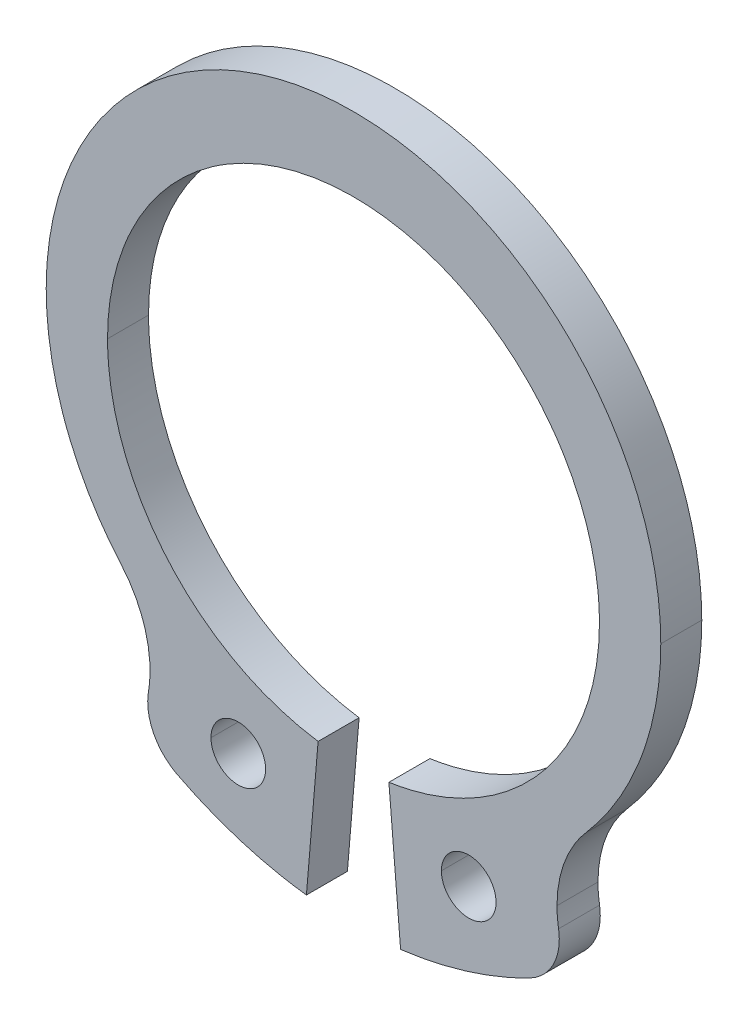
ISO-10303-21;
HEADER;
FILE_DESCRIPTION(('STEP AP214'),'2;1');
FILE_NAME('part.step','',(''),(''),'','','');
FILE_SCHEMA(('AUTOMOTIVE_DESIGN { 1 0 10303 214 1 1 1 1 }'));
ENDSEC;
DATA;
#1=APPLICATION_CONTEXT('core data for automotive mechanical design processes');
#2=APPLICATION_PROTOCOL_DEFINITION('international standard','automotive_design',2000,#1);
#3=PRODUCT_CONTEXT('',#1,'mechanical');
#4=PRODUCT('Part','Part','',(#3));
#5=PRODUCT_RELATED_PRODUCT_CATEGORY('part','',(#4));
#6=PRODUCT_DEFINITION_FORMATION('','',#4);
#7=PRODUCT_DEFINITION_CONTEXT('part definition',#1,'design');
#8=PRODUCT_DEFINITION('design','',#6,#7);
#9=PRODUCT_DEFINITION_SHAPE('','',#8);
#10=(LENGTH_UNIT() NAMED_UNIT(*) SI_UNIT(.MILLI.,.METRE.));
#11=(NAMED_UNIT(*) PLANE_ANGLE_UNIT() SI_UNIT($,.RADIAN.));
#12=(NAMED_UNIT(*) SI_UNIT($,.STERADIAN.) SOLID_ANGLE_UNIT());
#13=UNCERTAINTY_MEASURE_WITH_UNIT(LENGTH_MEASURE(1.E-05),#10,'distance_accuracy_value','');
#14=(GEOMETRIC_REPRESENTATION_CONTEXT(3) GLOBAL_UNCERTAINTY_ASSIGNED_CONTEXT((#13)) GLOBAL_UNIT_ASSIGNED_CONTEXT((#10,
#11,#12)) REPRESENTATION_CONTEXT('',''));
#15=CARTESIAN_POINT('',(0.,0.,0.));
#16=DIRECTION('',(0.,0.,1.));
#17=DIRECTION('',(1.,0.,0.));
#18=AXIS2_PLACEMENT_3D('',#15,#16,#17);
#19=CARTESIAN_POINT('',(-8.9999999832,0.,1.4999999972));
#20=CARTESIAN_POINT('',(-8.9999999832,5.2720779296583,1.4999999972));
#21=CARTESIAN_POINT('',(-5.27207792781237,8.99999998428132,1.4999999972));
#22=CARTESIAN_POINT('',(1.84593085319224E-09,8.9999999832,1.4999999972));
#23=CARTESIAN_POINT('',(5.27207793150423,8.99999998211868,1.4999999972));
#24=CARTESIAN_POINT('',(8.99999998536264,5.27207792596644,1.4999999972));
#25=CARTESIAN_POINT('',(8.9999999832,-3.69186170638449E-09,1.4999999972));
#26=CARTESIAN_POINT('',(-8.9999999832,0.,0.));
#27=CARTESIAN_POINT('',(-8.9999999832,5.2720779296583,0.));
#28=CARTESIAN_POINT('',(-5.27207792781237,8.99999998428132,0.));
#29=CARTESIAN_POINT('',(1.84593085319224E-09,8.9999999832,0.));
#30=CARTESIAN_POINT('',(5.27207793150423,8.99999998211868,0.));
#31=CARTESIAN_POINT('',(8.99999998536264,5.27207792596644,0.));
#32=CARTESIAN_POINT('',(8.9999999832,-3.69186170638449E-09,0.));
#33=(BOUNDED_SURFACE() B_SPLINE_SURFACE(1,3,((#19,#20,#21,#22,#23,#24,#25),(#26,#27,#28,#29,#30,
#31,#32)),.UNSPECIFIED.,.F.,.F.,.F.) B_SPLINE_SURFACE_WITH_KNOTS((2,2),(4,3,4),(0.,1.),(0.,0.5,
1.),.UNSPECIFIED.) GEOMETRIC_REPRESENTATION_ITEM() RATIONAL_B_SPLINE_SURFACE(((1.,
0.804737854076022,0.804737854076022,1.,0.804737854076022,0.804737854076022,1.),(1.,
0.804737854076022,0.804737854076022,1.,0.804737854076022,0.804737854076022,1.))) REPRESENTATION_ITEM('') SURFACE());
#34=CARTESIAN_POINT('',(-8.99999998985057,-5.99247355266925E-09,0.));
#35=CARTESIAN_POINT('',(-8.99999998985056,-5.99247355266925E-09,1.4999999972));
#36=(BOUNDED_CURVE() B_SPLINE_CURVE(1,(#34,#35),.UNSPECIFIED.,.F.,
.F.) B_SPLINE_CURVE_WITH_KNOTS((2,2),(-1.,0.),
.UNSPECIFIED.) CURVE() GEOMETRIC_REPRESENTATION_ITEM() RATIONAL_B_SPLINE_CURVE((1.,1.)) REPRESENTATION_ITEM(''));
#37=CARTESIAN_POINT('',(-8.99999998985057,-5.99247355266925E-09,0.));
#38=VERTEX_POINT('',#37);
#39=CARTESIAN_POINT('',(-8.99999998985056,-5.99247355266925E-09,1.4999999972));
#40=VERTEX_POINT('',#39);
#41=EDGE_CURVE('E313',#38,#40,#36,.T.);
#42=CARTESIAN_POINT('',(-8.99999998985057,-5.99247355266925E-09,0.));
#43=CARTESIAN_POINT('',(-8.9999999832,5.2720779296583,0.));
#44=CARTESIAN_POINT('',(-5.27207792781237,8.99999998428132,0.));
#45=CARTESIAN_POINT('',(1.8459288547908E-09,8.9999999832,0.));
#46=CARTESIAN_POINT('',(5.27207793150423,8.99999998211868,0.));
#47=CARTESIAN_POINT('',(8.99999998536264,5.27207792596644,0.));
#48=CARTESIAN_POINT('',(8.99999998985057,-7.91495558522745E-09,0.));
#49=(BOUNDED_CURVE() B_SPLINE_CURVE(3,(#42,#43,#44,#45,#46,#47,#48),.UNSPECIFIED.,.F.,
.F.) B_SPLINE_CURVE_WITH_KNOTS((4,3,4),(-3.1415926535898,-1.5707963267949,0.),
.UNSPECIFIED.) CURVE() GEOMETRIC_REPRESENTATION_ITEM() RATIONAL_B_SPLINE_CURVE((1.,
0.804737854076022,0.804737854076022,1.,0.804737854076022,0.804737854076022,1.)) REPRESENTATION_ITEM(''));
#50=CARTESIAN_POINT('',(8.99999998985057,-7.91495558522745E-09,0.));
#51=VERTEX_POINT('',#50);
#52=EDGE_CURVE('E750',#38,#51,#49,.T.);
#53=CARTESIAN_POINT('',(8.99999998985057,-7.91495558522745E-09,1.4999999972));
#54=CARTESIAN_POINT('',(8.99999998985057,-7.91495558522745E-09,0.));
#55=(BOUNDED_CURVE() B_SPLINE_CURVE(1,(#53,#54),.UNSPECIFIED.,.F.,
.F.) B_SPLINE_CURVE_WITH_KNOTS((2,2),(-1.,0.),
.UNSPECIFIED.) CURVE() GEOMETRIC_REPRESENTATION_ITEM() RATIONAL_B_SPLINE_CURVE((1.,1.)) REPRESENTATION_ITEM(''));
#56=CARTESIAN_POINT('',(8.99999998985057,-7.91495558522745E-09,1.4999999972));
#57=VERTEX_POINT('',#56);
#58=EDGE_CURVE('E11',#57,#51,#55,.T.);
#59=CARTESIAN_POINT('',(-8.99999998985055,-5.99245653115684E-09,1.4999999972));
#60=CARTESIAN_POINT('',(-9.0000124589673,0.147436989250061,1.4999999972));
#61=CARTESIAN_POINT('',(-8.99641214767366,0.294876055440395,1.4999999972));
#62=CARTESIAN_POINT('',(-8.98198862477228,0.589045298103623,1.4999999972));
#63=CARTESIAN_POINT('',(-8.97118277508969,0.735776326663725,1.4999999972));
#64=CARTESIAN_POINT('',(-8.94235079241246,1.02852991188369,1.4999999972));
#65=CARTESIAN_POINT('',(-8.92432455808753,1.17455245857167,1.4999999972));
#66=CARTESIAN_POINT('',(-8.88107383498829,1.46588956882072,1.4999999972));
#67=CARTESIAN_POINT('',(-8.85583192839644,1.61120154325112,1.4999999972));
#68=CARTESIAN_POINT('',(-8.79830493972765,1.90041517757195,1.4999999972));
#69=CARTESIAN_POINT('',(-8.76602030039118,2.04431692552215,1.4999999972));
#70=CARTESIAN_POINT('',(-8.69449271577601,2.3300167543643,1.4999999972));
#71=CARTESIAN_POINT('',(-8.6552665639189,2.47181903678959,1.4999999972));
#72=CARTESIAN_POINT('',(-8.56987335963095,2.75332241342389,1.4999999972));
#73=CARTESIAN_POINT('',(-8.5237061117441,2.89302344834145,1.4999999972));
#74=CARTESIAN_POINT('',(-8.42444830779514,3.17032872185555,1.4999999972));
#75=CARTESIAN_POINT('',(-8.37134107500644,3.30792698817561,1.4999999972));
#76=CARTESIAN_POINT('',(-8.25849523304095,3.58036335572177,1.4999999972));
#77=CARTESIAN_POINT('',(-8.19875718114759,3.71520168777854,1.4999999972));
#78=CARTESIAN_POINT('',(-8.07286676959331,3.98145757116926,1.4999999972));
#79=CARTESIAN_POINT('',(-8.00673006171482,4.11288251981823,1.4999999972));
#80=CARTESIAN_POINT('',(-7.86805906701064,4.37231749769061,1.4999999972));
#81=CARTESIAN_POINT('',(-7.79552460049,4.50032743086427,1.4999999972));
#82=CARTESIAN_POINT('',(-7.64407444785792,4.752940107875,1.4999999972));
#83=CARTESIAN_POINT('',(-7.56514357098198,4.87753374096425,1.4999999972));
#84=CARTESIAN_POINT('',(-7.40131634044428,5.1227201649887,1.4999999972));
#85=CARTESIAN_POINT('',(-7.31642048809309,5.2433132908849,1.4999999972));
#86=CARTESIAN_POINT('',(-7.14100508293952,5.47989312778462,1.4999999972));
#87=CARTESIAN_POINT('',(-7.05049943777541,5.5958901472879,1.4999999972));
#88=CARTESIAN_POINT('',(-6.86387971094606,5.82328678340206,1.4999999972));
#89=CARTESIAN_POINT('',(-6.76776547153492,5.93468627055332,1.4999999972));
#90=CARTESIAN_POINT('',(-6.56994309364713,6.15289861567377,1.4999999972));
#91=CARTESIAN_POINT('',(-6.46822183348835,6.25969957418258,1.4999999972));
#92=CARTESIAN_POINT('',(-6.25970899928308,6.46821370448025,1.4999999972));
#93=CARTESIAN_POINT('',(-6.15291785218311,6.5699273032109,1.4999999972));
#94=CARTESIAN_POINT('',(-5.93471857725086,6.76773947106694,1.4999999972));
#95=CARTESIAN_POINT('',(-5.82332207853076,6.86385086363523,1.4999999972));
#96=CARTESIAN_POINT('',(-5.59592531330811,7.05047043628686,1.4999999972));
#97=CARTESIAN_POINT('',(-5.47992491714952,7.14097845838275,1.4999999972));
#98=CARTESIAN_POINT('',(-5.24333251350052,7.31640469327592,1.4999999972));
#99=CARTESIAN_POINT('',(-5.12272995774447,7.4013086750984,1.4999999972));
#100=CARTESIAN_POINT('',(-4.87754454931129,7.56513743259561,1.4999999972));
#101=CARTESIAN_POINT('',(-4.75296203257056,7.64406271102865,1.4999999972));
#102=CARTESIAN_POINT('',(-4.50036416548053,7.79550540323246,1.4999999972));
#103=CARTESIAN_POINT('',(-4.37235771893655,7.86803766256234,1.4999999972));
#104=CARTESIAN_POINT('',(-4.11292264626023,8.00670848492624,1.4999999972));
#105=CARTESIAN_POINT('',(-3.98149392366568,8.07284686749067,1.4999999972));
#106=CARTESIAN_POINT('',(-3.71522360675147,8.19874545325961,1.4999999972));
#107=CARTESIAN_POINT('',(-3.58037444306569,8.25848964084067,1.4999999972));
#108=CARTESIAN_POINT('',(-3.30793877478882,8.37133718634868,1.4999999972));
#109=CARTESIAN_POINT('',(-3.17035250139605,8.42444110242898,1.4999999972));
#110=CARTESIAN_POINT('',(-2.89306320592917,8.52369447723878,1.4999999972));
#111=CARTESIAN_POINT('',(-2.75336602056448,8.56986023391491,1.4999999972));
#112=CARTESIAN_POINT('',(-2.47186258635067,8.65525326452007,1.4999999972));
#113=CARTESIAN_POINT('',(-2.33005627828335,8.69448034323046,1.4999999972));
#114=CARTESIAN_POINT('',(-2.04434070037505,8.76601305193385,1.4999999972));
#115=CARTESIAN_POINT('',(-1.90042713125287,8.79830149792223,1.4999999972));
#116=CARTESIAN_POINT('',(-1.61121080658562,8.85583113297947,1.4999999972));
#117=CARTESIAN_POINT('',(-1.46590816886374,8.88107291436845,1.4999999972));
#118=CARTESIAN_POINT('',(-1.17458355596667,8.92432269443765,1.4999999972));
#119=CARTESIAN_POINT('',(-1.02856412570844,8.94234781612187,1.4999999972));
#120=CARTESIAN_POINT('',(-0.735810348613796,8.97118144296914,1.4999999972));
#121=CARTESIAN_POINT('',(-0.589075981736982,8.98198974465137,1.4999999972));
#122=CARTESIAN_POINT('',(-0.294894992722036,8.99640762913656,1.4999999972));
#123=CARTESIAN_POINT('',(-0.147447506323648,8.99999951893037,1.4999999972));
#124=CARTESIAN_POINT('',(0.14743511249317,9.00000043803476,1.4999999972));
#125=CARTESIAN_POINT('',(0.294870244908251,8.99641007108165,1.4999999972));
#126=CARTESIAN_POINT('',(0.589034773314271,8.98199421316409,1.4999999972));
#127=CARTESIAN_POINT('',(0.735765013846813,8.97118601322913,1.4999999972));
#128=CARTESIAN_POINT('',(1.02851877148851,8.94235218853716,1.4999999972));
#129=CARTESIAN_POINT('',(1.17454226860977,8.92432636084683,1.4999999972));
#130=CARTESIAN_POINT('',(1.46588342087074,8.88107535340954,1.4999999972));
#131=CARTESIAN_POINT('',(1.61119847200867,8.85583265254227,1.4999999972));
#132=CARTESIAN_POINT('',(1.90041514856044,8.79830481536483,1.4999999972));
#133=CARTESIAN_POINT('',(2.04431689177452,8.76602027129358,1.4999999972));
#134=CARTESIAN_POINT('',(2.33001671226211,8.69449275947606,1.4999999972));
#135=CARTESIAN_POINT('',(2.47181899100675,8.65526658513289,1.4999999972));
#136=CARTESIAN_POINT('',(2.75332236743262,8.56987336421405,1.4999999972));
#137=CARTESIAN_POINT('',(2.89302340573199,8.52370612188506,1.4999999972));
#138=CARTESIAN_POINT('',(3.17032869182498,8.42444831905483,1.4999999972));
#139=CARTESIAN_POINT('',(3.30792696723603,8.3713410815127,1.4999999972));
#140=CARTESIAN_POINT('',(3.58036332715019,8.2584952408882,1.4999999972));
#141=CARTESIAN_POINT('',(3.71520164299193,8.19875719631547,1.4999999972));
#142=CARTESIAN_POINT('',(3.98145750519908,8.07286679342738,1.4999999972));
#143=CARTESIAN_POINT('',(4.11288244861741,8.00673008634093,1.4999999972));
#144=CARTESIAN_POINT('',(4.37231742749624,7.86805908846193,1.4999999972));
#145=CARTESIAN_POINT('',(4.50032736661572,7.79552461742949,1.4999999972));
#146=CARTESIAN_POINT('',(4.75294006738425,7.6440744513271,1.4999999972));
#147=CARTESIAN_POINT('',(4.8775337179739,7.56514356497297,1.4999999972));
#148=CARTESIAN_POINT('',(5.12272016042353,7.40131632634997,1.4999999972));
#149=CARTESIAN_POINT('',(5.24331328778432,7.31642047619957,1.4999999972));
#150=CARTESIAN_POINT('',(5.47989312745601,7.14100507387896,1.4999999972));
#151=CARTESIAN_POINT('',(5.59589014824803,7.05049942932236,1.4999999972));
#152=CARTESIAN_POINT('',(5.82328678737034,6.86387970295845,1.4999999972));
#153=CARTESIAN_POINT('',(5.93468627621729,6.76776546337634,1.4999999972));
#154=CARTESIAN_POINT('',(6.15289862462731,6.56994308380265,1.4999999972));
#155=CARTESIAN_POINT('',(6.2596995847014,6.46822182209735,1.4999999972));
#156=CARTESIAN_POINT('',(6.46821373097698,6.25970897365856,1.4999999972));
#157=CARTESIAN_POINT('',(6.56992734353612,6.15291781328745,1.4999999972));
#158=CARTESIAN_POINT('',(6.76773952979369,5.9347185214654,1.4999999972));
#159=CARTESIAN_POINT('',(6.86385092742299,5.82332201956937,1.4999999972));
#160=CARTESIAN_POINT('',(7.05047050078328,5.59592525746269,1.4999999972));
#161=CARTESIAN_POINT('',(7.14097851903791,5.47992486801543,1.4999999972));
#162=CARTESIAN_POINT('',(7.31640473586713,5.24333248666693,1.4999999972));
#163=CARTESIAN_POINT('',(7.40130870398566,5.12272994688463,1.4999999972));
#164=CARTESIAN_POINT('',(7.56513745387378,4.87754454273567,1.4999999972));
#165=CARTESIAN_POINT('',(7.64406273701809,4.75296201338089,1.4999999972));
#166=CARTESIAN_POINT('',(7.79550543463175,4.50036412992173,1.4999999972));
#167=CARTESIAN_POINT('',(7.86803769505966,4.37235767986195,1.4999999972));
#168=CARTESIAN_POINT('',(8.00670851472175,4.11292260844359,1.4999999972));
#169=CARTESIAN_POINT('',(8.07284689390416,3.98149389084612,1.4999999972));
#170=CARTESIAN_POINT('',(8.19874546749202,3.7152235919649,1.4999999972));
#171=CARTESIAN_POINT('',(8.25848964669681,3.58037444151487,1.4999999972));
#172=CARTESIAN_POINT('',(8.37133718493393,3.30793878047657,1.4999999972));
#173=CARTESIAN_POINT('',(8.42444110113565,3.17035250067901,1.4999999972));
#174=CARTESIAN_POINT('',(8.52369447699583,2.89306319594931,1.4999999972));
#175=CARTESIAN_POINT('',(8.56986023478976,2.75336600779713,1.4999999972));
#176=CARTESIAN_POINT('',(8.65525326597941,2.47186257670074,1.4999999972));
#177=CARTESIAN_POINT('',(8.69448034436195,2.33005627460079,1.4999999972));
#178=CARTESIAN_POINT('',(8.76601305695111,2.0443406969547,1.4999999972));
#179=CARTESIAN_POINT('',(8.79830150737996,1.90042712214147,1.4999999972));
#180=CARTESIAN_POINT('',(8.85583174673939,1.61120776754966,1.4999999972));
#181=CARTESIAN_POINT('',(8.88107397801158,1.46590207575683,1.4999999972));
#182=CARTESIAN_POINT('',(8.92432501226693,1.1745733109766,1.4999999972));
#183=CARTESIAN_POINT('',(8.94235103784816,1.0285527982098,1.4999999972));
#184=CARTESIAN_POINT('',(8.97118293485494,0.735799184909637,1.4999999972));
#185=CARTESIAN_POINT('',(8.98198870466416,0.589066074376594,1.4999999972));
#186=CARTESIAN_POINT('',(8.99641227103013,0.294888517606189,1.4999999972));
#187=CARTESIAN_POINT('',(9.0000125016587,0.147443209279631,1.4999999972));
#188=CARTESIAN_POINT('',(8.99999998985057,-7.91494040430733E-09,1.4999999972));
#189=B_SPLINE_CURVE_WITH_KNOTS('',3,(#59,#60,#61,#62,#63,#64,#65,#66,#67,#68,#69,#70,#71,#72,
#73,#74,#75,#76,#77,#78,#79,#80,#81,#82,#83,#84,#85,#86,#87,#88,#89,#90,#91,#92,#93,#94,#95,#96,
#97,#98,#99,#100,#101,#102,#103,#104,#105,#106,#107,#108,#109,#110,#111,#112,#113,#114,#115,
#116,#117,#118,#119,#120,#121,#122,#123,#124,#125,#126,#127,#128,#129,#130,#131,#132,#133,#134,
#135,#136,#137,#138,#139,#140,#141,#142,#143,#144,#145,#146,#147,#148,#149,#150,#151,#152,#153,
#154,#155,#156,#157,#158,#159,#160,#161,#162,#163,#164,#165,#166,#167,#168,#169,#170,#171,#172,
#173,#174,#175,#176,#177,#178,#179,#180,#181,#182,#183,#184,#185,#186,#187,#188),.UNSPECIFIED.,
.F.,.F.,(4,2,2,2,2,2,2,2,2,2,2,2,2,2,2,2,2,2,2,2,2,2,2,2,2,2,2,2,2,2,2,2,2,2,2,2,2,2,2,2,2,2,2,
2,2,2,2,2,2,2,2,2,2,2,2,2,2,2,2,2,2,2,2,2,4),(0.,0.442269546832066,0.883477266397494,
1.32469117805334,1.76697925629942,2.20923953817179,2.650444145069,3.0916611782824,
3.53395864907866,3.97621897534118,4.41742359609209,4.85864061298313,5.30093803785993,
5.74319833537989,6.1844029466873,6.6256199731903,7.06791742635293,7.51017769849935,
7.9513823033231,8.3925993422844,8.83489682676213,9.27715707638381,9.718361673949,
10.1595787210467,10.6018762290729,11.0441365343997,11.4853411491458,11.9265581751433,
12.3688556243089,12.8111158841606,13.2523204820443,13.6935375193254,14.1358350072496,
14.5780953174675,15.0192999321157,15.4605169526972,15.9028143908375,16.3450746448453,
16.7862792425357,17.2274962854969,17.6697937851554,18.1120540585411,18.5532586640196,
18.9944757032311,19.4367731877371,19.8790334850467,20.3202380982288,20.7614551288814,
21.2037525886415,21.6460129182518,22.0872175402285,22.5284345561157,22.9707319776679,
23.4129922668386,23.8541968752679,24.2954139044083,24.7377113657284,25.1799716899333,
25.6211763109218,26.0623933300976,26.5046907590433,26.9469604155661,27.3881681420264,
27.8293820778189,28.2716703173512),.UNSPECIFIED.);
#190=EDGE_CURVE('E308',#40,#57,#189,.T.);
#191=ORIENTED_EDGE('',*,*,#41,.F.);
#192=ORIENTED_EDGE('',*,*,#52,.T.);
#193=ORIENTED_EDGE('',*,*,#58,.F.);
#194=ORIENTED_EDGE('',*,*,#190,.F.);
#195=EDGE_LOOP('',(#191,#192,#193,#194));
#196=FACE_BOUND('',#195,.T.);
#197=ADVANCED_FACE('F17',(#196),#33,.T.);
#198=CARTESIAN_POINT('',(8.9999999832,-3.69186170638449E-09,1.4999999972));
#199=CARTESIAN_POINT('',(8.99999998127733,-4.68706939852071,1.4999999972));
#200=CARTESIAN_POINT('',(5.93347987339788,-8.23179420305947,1.4999999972));
#201=CARTESIAN_POINT('',(1.29519997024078,-8.90631555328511,1.4999999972));
#202=CARTESIAN_POINT('',(8.9999999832,-3.69186170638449E-09,0.));
#203=CARTESIAN_POINT('',(8.99999998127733,-4.68706939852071,0.));
#204=CARTESIAN_POINT('',(5.93347987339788,-8.23179420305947,0.));
#205=CARTESIAN_POINT('',(1.29519997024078,-8.90631555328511,0.));
#206=(BOUNDED_SURFACE() B_SPLINE_SURFACE(1,3,((#198,#199,#200,#201),(#202,#203,#204,#205)),
.UNSPECIFIED.,.F.,.F.,.F.) B_SPLINE_SURFACE_WITH_KNOTS((2,2),(4,4),(0.,1.),(0.,1.),
.UNSPECIFIED.) GEOMETRIC_REPRESENTATION_ITEM() RATIONAL_B_SPLINE_SURFACE(((1.,0.837518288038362,
0.837518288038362,1.),(1.,0.837518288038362,0.837518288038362,1.))) REPRESENTATION_ITEM('') SURFACE());
#207=CARTESIAN_POINT('',(8.99999998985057,-7.91495558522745E-09,0.));
#208=CARTESIAN_POINT('',(8.99999998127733,-4.68706939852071,0.));
#209=CARTESIAN_POINT('',(5.93347987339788,-8.23179420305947,0.));
#210=CARTESIAN_POINT('',(1.29519997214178,-8.90631555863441,0.));
#211=(BOUNDED_CURVE() B_SPLINE_CURVE(3,(#207,#208,#209,#210),.UNSPECIFIED.,.F.,
.F.) B_SPLINE_CURVE_WITH_KNOTS((4,4),(-6.28318530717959,-4.85680151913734),
.UNSPECIFIED.) CURVE() GEOMETRIC_REPRESENTATION_ITEM() RATIONAL_B_SPLINE_CURVE((1.,
0.837518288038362,0.837518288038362,1.)) REPRESENTATION_ITEM(''));
#212=CARTESIAN_POINT('',(1.29519997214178,-8.90631555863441,0.));
#213=VERTEX_POINT('',#212);
#214=EDGE_CURVE('E765',#51,#213,#211,.T.);
#215=CARTESIAN_POINT('',(1.29519997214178,-8.90631555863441,0.));
#216=CARTESIAN_POINT('',(1.29519997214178,-8.90631555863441,1.4999999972));
#217=(BOUNDED_CURVE() B_SPLINE_CURVE(1,(#215,#216),.UNSPECIFIED.,.F.,
.F.) B_SPLINE_CURVE_WITH_KNOTS((2,2),(-1.,0.),
.UNSPECIFIED.) CURVE() GEOMETRIC_REPRESENTATION_ITEM() RATIONAL_B_SPLINE_CURVE((1.,1.)) REPRESENTATION_ITEM(''));
#218=CARTESIAN_POINT('',(1.29519997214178,-8.90631555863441,1.4999999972));
#219=VERTEX_POINT('',#218);
#220=EDGE_CURVE('E32',#213,#219,#217,.T.);
#221=CARTESIAN_POINT('',(8.99999998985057,-7.91495558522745E-09,1.4999999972));
#222=CARTESIAN_POINT('',(9.0000000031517,-1.07263095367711,1.4999999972));
#223=CARTESIAN_POINT('',(8.80825589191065,-2.1366249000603,1.4999999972));
#224=CARTESIAN_POINT('',(8.05937419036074,-4.14692952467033,1.4999999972));
#225=CARTESIAN_POINT('',(7.50826681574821,-5.07705291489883,1.4999999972));
#226=CARTESIAN_POINT('',(6.10472696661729,-6.69946609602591,1.4999999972));
#227=CARTESIAN_POINT('',(5.26359601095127,-7.37869190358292,1.4999999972));
#228=CARTESIAN_POINT('',(3.38198981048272,-8.40908330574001,1.4999999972));
#229=CARTESIAN_POINT('',(2.35666549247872,-8.75195206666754,1.4999999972));
#230=CARTESIAN_POINT('',(1.29519997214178,-8.90631555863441,1.4999999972));
#231=(BOUNDED_CURVE() B_SPLINE_CURVE(3,(#221,#222,#223,#224,#225,#226,#227,#228,#229,#230),
.UNSPECIFIED.,.F.,.F.) B_SPLINE_CURVE_WITH_KNOTS((4,2,2,2,4),(0.,0.356595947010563,
0.713191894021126,1.06978784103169,1.42638378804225),
.UNSPECIFIED.) CURVE() GEOMETRIC_REPRESENTATION_ITEM() RATIONAL_B_SPLINE_CURVE((1.,1.,1.,1.,1.,
1.,1.,1.,1.,1.)) REPRESENTATION_ITEM(''));
#232=EDGE_CURVE('E345',#57,#219,#231,.T.);
#233=ORIENTED_EDGE('',*,*,#214,.T.);
#234=ORIENTED_EDGE('',*,*,#220,.T.);
#235=ORIENTED_EDGE('',*,*,#232,.F.);
#236=ORIENTED_EDGE('',*,*,#58,.T.);
#237=EDGE_LOOP('',(#233,#234,#235,#236));
#238=FACE_BOUND('',#237,.T.);
#239=ADVANCED_FACE('F743',(#238),#206,.T.);
#240=CARTESIAN_POINT('',(1.7226458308,-13.9883712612,0.));
#241=CARTESIAN_POINT('',(1.7226458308,-13.9883712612,1.4999999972));
#242=CARTESIAN_POINT('',(1.295199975,-8.906315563,0.));
#243=CARTESIAN_POINT('',(1.295199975,-8.906315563,1.4999999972));
#244=(BOUNDED_SURFACE() B_SPLINE_SURFACE(1,1,((#240,#241),(#242,#243)),.UNSPECIFIED.,.F.,.F.,
.F.) B_SPLINE_SURFACE_WITH_KNOTS((2,2),(2,2),(0.,1.),(0.,1.),
.UNSPECIFIED.) GEOMETRIC_REPRESENTATION_ITEM() RATIONAL_B_SPLINE_SURFACE(((1.,1.),(1.,1.))) REPRESENTATION_ITEM('') SURFACE());
#245=CARTESIAN_POINT('',(1.72264583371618,-13.9883712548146,0.));
#246=CARTESIAN_POINT('',(1.72264583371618,-13.9883712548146,1.4999999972));
#247=(BOUNDED_CURVE() B_SPLINE_CURVE(1,(#245,#246),.UNSPECIFIED.,.F.,
.F.) B_SPLINE_CURVE_WITH_KNOTS((2,2),(0.,1.),
.UNSPECIFIED.) CURVE() GEOMETRIC_REPRESENTATION_ITEM() RATIONAL_B_SPLINE_CURVE((1.,1.)) REPRESENTATION_ITEM(''));
#248=CARTESIAN_POINT('',(1.72264583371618,-13.9883712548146,0.));
#249=VERTEX_POINT('',#248);
#250=CARTESIAN_POINT('',(1.72264583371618,-13.9883712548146,1.4999999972));
#251=VERTEX_POINT('',#250);
#252=EDGE_CURVE('E570',#249,#251,#247,.T.);
#253=CARTESIAN_POINT('',(1.29519997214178,-8.90631555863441,1.4999999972));
#254=CARTESIAN_POINT('',(1.4376819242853,-10.6003341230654,1.4999999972));
#255=CARTESIAN_POINT('',(1.58016387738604,-12.2943526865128,1.4999999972));
#256=CARTESIAN_POINT('',(1.72264583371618,-13.9883712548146,1.4999999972));
#257=(BOUNDED_CURVE() B_SPLINE_CURVE(3,(#253,#254,#255,#256),.UNSPECIFIED.,.F.,
.F.) B_SPLINE_CURVE_WITH_KNOTS((4,4),(0.,1.),
.UNSPECIFIED.) CURVE() GEOMETRIC_REPRESENTATION_ITEM() RATIONAL_B_SPLINE_CURVE((1.,1.,1.,1.)) REPRESENTATION_ITEM(''));
#258=EDGE_CURVE('E352',#219,#251,#257,.T.);
#259=CARTESIAN_POINT('',(1.29519997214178,-8.90631555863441,0.));
#260=CARTESIAN_POINT('',(1.72264583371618,-13.9883712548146,0.));
#261=(BOUNDED_CURVE() B_SPLINE_CURVE(1,(#259,#260),.UNSPECIFIED.,.F.,
.F.) B_SPLINE_CURVE_WITH_KNOTS((2,2),(0.,1.),
.UNSPECIFIED.) CURVE() GEOMETRIC_REPRESENTATION_ITEM() RATIONAL_B_SPLINE_CURVE((1.,1.)) REPRESENTATION_ITEM(''));
#262=EDGE_CURVE('E770',#213,#249,#261,.T.);
#263=ORIENTED_EDGE('',*,*,#252,.T.);
#264=ORIENTED_EDGE('',*,*,#258,.F.);
#265=ORIENTED_EDGE('',*,*,#220,.F.);
#266=ORIENTED_EDGE('',*,*,#262,.T.);
#267=EDGE_LOOP('',(#263,#264,#265,#266));
#268=FACE_BOUND('',#267,.T.);
#269=ADVANCED_FACE('F746',(#268),#244,.F.);
#270=CARTESIAN_POINT('',(6.45565384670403,-12.528630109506,1.4999999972));
#271=CARTESIAN_POINT('',(4.97264669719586,-13.2927823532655,1.4999999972));
#272=CARTESIAN_POINT('',(3.37844175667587,-13.7844625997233,1.4999999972));
#273=CARTESIAN_POINT('',(1.72264583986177,-13.9883712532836,1.4999999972));
#274=CARTESIAN_POINT('',(6.45565384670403,-12.528630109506,0.));
#275=CARTESIAN_POINT('',(4.97264669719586,-13.2927823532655,0.));
#276=CARTESIAN_POINT('',(3.37844175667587,-13.7844625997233,0.));
#277=CARTESIAN_POINT('',(1.72264583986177,-13.9883712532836,0.));
#278=(BOUNDED_SURFACE() B_SPLINE_SURFACE(1,3,((#270,#271,#272,#273),(#274,#275,#276,#277)),
.UNSPECIFIED.,.F.,.F.,.F.) B_SPLINE_SURFACE_WITH_KNOTS((2,2),(4,4),(0.,1.),(0.,1.),
.UNSPECIFIED.) GEOMETRIC_REPRESENTATION_ITEM() RATIONAL_B_SPLINE_SURFACE(((1.,0.989627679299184,
0.989627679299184,1.),(1.,0.989627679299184,0.989627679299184,1.))) REPRESENTATION_ITEM('') SURFACE());
#279=CARTESIAN_POINT('',(6.45565384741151,-12.5286301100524,0.));
#280=CARTESIAN_POINT('',(6.45565384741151,-12.5286301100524,1.4999999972));
#281=(BOUNDED_CURVE() B_SPLINE_CURVE(1,(#279,#280),.UNSPECIFIED.,.F.,
.F.) B_SPLINE_CURVE_WITH_KNOTS((2,2),(-1.,0.),
.UNSPECIFIED.) CURVE() GEOMETRIC_REPRESENTATION_ITEM() RATIONAL_B_SPLINE_CURVE((1.,1.)) REPRESENTATION_ITEM(''));
#282=CARTESIAN_POINT('',(6.45565384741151,-12.5286301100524,0.));
#283=VERTEX_POINT('',#282);
#284=CARTESIAN_POINT('',(6.45565384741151,-12.5286301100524,1.4999999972));
#285=VERTEX_POINT('',#284);
#286=EDGE_CURVE('E562',#283,#285,#281,.T.);
#287=CARTESIAN_POINT('',(1.7226458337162,-13.9883712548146,1.4999999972));
#288=CARTESIAN_POINT('',(1.92874212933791,-13.9630037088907,1.4999999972));
#289=CARTESIAN_POINT('',(2.13428069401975,-13.9330916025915,1.4999999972));
#290=CARTESIAN_POINT('',(2.54343684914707,-13.8642802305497,1.4999999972));
#291=CARTESIAN_POINT('',(2.74705739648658,-13.8253985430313,1.4999999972));
#292=CARTESIAN_POINT('',(3.15237822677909,-13.7386506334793,1.4999999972));
#293=CARTESIAN_POINT('',(3.35407849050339,-13.6907843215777,1.4999999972));
#294=CARTESIAN_POINT('',(3.75556195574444,-13.5860894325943,1.4999999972));
#295=CARTESIAN_POINT('',(3.95534060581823,-13.5292434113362,1.4999999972));
#296=CARTESIAN_POINT('',(4.35220609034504,-13.4068443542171,1.4999999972));
#297=CARTESIAN_POINT('',(4.54929300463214,-13.3412915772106,1.4999999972));
#298=CARTESIAN_POINT('',(4.93999431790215,-13.2016648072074,1.4999999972));
#299=CARTESIAN_POINT('',(5.13361472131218,-13.1276076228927,1.4999999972));
#300=CARTESIAN_POINT('',(5.51738532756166,-12.9709860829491,1.4999999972));
#301=CARTESIAN_POINT('',(5.70753549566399,-12.8884216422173,1.4999999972));
#302=CARTESIAN_POINT('',(6.08437971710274,-12.714815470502,1.4999999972));
#303=CARTESIAN_POINT('',(6.27106623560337,-12.6237573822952,1.4999999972));
#304=CARTESIAN_POINT('',(6.45565384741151,-12.5286301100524,1.4999999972));
#305=B_SPLINE_CURVE_WITH_KNOTS('',3,(#287,#288,#289,#290,#291,#292,#293,#294,#295,#296,#297,
#298,#299,#300,#301,#302,#303,#304),.UNSPECIFIED.,.F.,.F.,(4,2,2,2,2,2,2,2,4),(0.,
0.622906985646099,1.2446034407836,1.86630611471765,2.48923172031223,3.11213881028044,
3.73383527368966,4.35553795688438,4.97846366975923),.UNSPECIFIED.);
#306=EDGE_CURVE('E579',#251,#285,#305,.T.);
#307=CARTESIAN_POINT('',(1.72264583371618,-13.9883712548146,0.));
#308=CARTESIAN_POINT('',(3.37844175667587,-13.7844625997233,0.));
#309=CARTESIAN_POINT('',(4.97264669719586,-13.2927823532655,0.));
#310=CARTESIAN_POINT('',(6.45565384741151,-12.5286301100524,0.));
#311=(BOUNDED_CURVE() B_SPLINE_CURVE(3,(#307,#308,#309,#310),.UNSPECIFIED.,.F.,
.F.) B_SPLINE_CURVE_WITH_KNOTS((4,4),(-5.1881795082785,-4.8349204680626),
.UNSPECIFIED.) CURVE() GEOMETRIC_REPRESENTATION_ITEM() RATIONAL_B_SPLINE_CURVE((1.,
0.989627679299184,0.989627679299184,1.)) REPRESENTATION_ITEM(''));
#312=EDGE_CURVE('E1071',#249,#283,#311,.T.);
#313=ORIENTED_EDGE('',*,*,#286,.T.);
#314=ORIENTED_EDGE('',*,*,#306,.F.);
#315=ORIENTED_EDGE('',*,*,#252,.F.);
#316=ORIENTED_EDGE('',*,*,#312,.T.);
#317=EDGE_LOOP('',(#313,#314,#315,#316));
#318=FACE_BOUND('',#317,.T.);
#319=ADVANCED_FACE('F547',(#318),#278,.F.);
#320=CARTESIAN_POINT('',(7.50310801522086,-10.4458915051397,1.4999999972));
#321=CARTESIAN_POINT('',(7.64769624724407,-11.3248379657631,1.4999999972));
#322=CARTESIAN_POINT('',(7.24747757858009,-12.1206254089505,1.4999999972));
#323=CARTESIAN_POINT('',(6.45565385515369,-12.5286301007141,1.4999999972));
#324=CARTESIAN_POINT('',(7.50310801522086,-10.4458915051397,0.));
#325=CARTESIAN_POINT('',(7.64769624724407,-11.3248379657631,0.));
#326=CARTESIAN_POINT('',(7.24747757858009,-12.1206254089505,0.));
#327=CARTESIAN_POINT('',(6.45565385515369,-12.5286301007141,0.));
#328=(BOUNDED_SURFACE() B_SPLINE_SURFACE(1,3,((#320,#321,#322,#323),(#324,#325,#326,#327)),
.UNSPECIFIED.,.F.,.F.,.F.) B_SPLINE_SURFACE_WITH_KNOTS((2,2),(4,4),(0.,1.),(0.,1.),
.UNSPECIFIED.) GEOMETRIC_REPRESENTATION_ITEM() RATIONAL_B_SPLINE_SURFACE(((1.,0.872401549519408,
0.872401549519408,1.),(1.,0.872401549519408,0.872401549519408,1.))) REPRESENTATION_ITEM('') SURFACE());
#329=CARTESIAN_POINT('',(7.50310801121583,-10.4458915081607,1.4999999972));
#330=CARTESIAN_POINT('',(7.50310801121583,-10.4458915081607,0.));
#331=(BOUNDED_CURVE() B_SPLINE_CURVE(1,(#329,#330),.UNSPECIFIED.,.F.,
.F.) B_SPLINE_CURVE_WITH_KNOTS((2,2),(-1.,0.),
.UNSPECIFIED.) CURVE() GEOMETRIC_REPRESENTATION_ITEM() RATIONAL_B_SPLINE_CURVE((1.,1.)) REPRESENTATION_ITEM(''));
#332=CARTESIAN_POINT('',(7.50310801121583,-10.4458915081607,1.4999999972));
#333=VERTEX_POINT('',#332);
#334=CARTESIAN_POINT('',(7.50310801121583,-10.4458915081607,0.));
#335=VERTEX_POINT('',#334);
#336=EDGE_CURVE('E510',#333,#335,#331,.T.);
#337=CARTESIAN_POINT('',(6.45565384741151,-12.5286301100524,1.4999999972));
#338=CARTESIAN_POINT('',(6.4788583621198,-12.5166746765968,1.4999999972));
#339=CARTESIAN_POINT('',(6.50183187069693,-12.5042697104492,1.4999999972));
#340=CARTESIAN_POINT('',(6.54717056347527,-12.4786291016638,1.4999999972));
#341=CARTESIAN_POINT('',(6.56953806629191,-12.4653975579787,1.4999999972));
#342=CARTESIAN_POINT('',(6.61366498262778,-12.4381039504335,1.4999999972));
#343=CARTESIAN_POINT('',(6.63542606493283,-12.4240445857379,1.4999999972));
#344=CARTESIAN_POINT('',(6.67834090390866,-12.395097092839,1.4999999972));
#345=CARTESIAN_POINT('',(6.6994955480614,-12.3802102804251,1.4999999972));
#346=CARTESIAN_POINT('',(6.74119829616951,-12.3496091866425,1.4999999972));
#347=CARTESIAN_POINT('',(6.76174638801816,-12.3338948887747,1.4999999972));
#348=CARTESIAN_POINT('',(6.80223696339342,-12.3016401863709,1.4999999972));
#349=CARTESIAN_POINT('',(6.82217843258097,-12.2850985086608,1.4999999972));
#350=CARTESIAN_POINT('',(6.86145676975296,-12.2511902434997,1.4999999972));
#351=CARTESIAN_POINT('',(6.88079153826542,-12.2338212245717,1.4999999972));
#352=CARTESIAN_POINT('',(6.91885761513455,-12.1982595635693,1.4999999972));
#353=CARTESIAN_POINT('',(6.93758567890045,-12.1800634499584,1.4999999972));
#354=CARTESIAN_POINT('',(6.97432232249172,-12.1429662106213,1.4999999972));
#355=CARTESIAN_POINT('',(6.99233104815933,-12.1240652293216,1.4999999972));
#356=CARTESIAN_POINT('',(7.02751271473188,-12.0856600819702,1.4999999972));
#357=CARTESIAN_POINT('',(7.04468911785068,-12.0661590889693,1.4999999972));
#358=CARTESIAN_POINT('',(7.07820713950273,-12.0265552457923,1.4999999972));
#359=CARTESIAN_POINT('',(7.09455116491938,-12.0064544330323,1.4999999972));
#360=CARTESIAN_POINT('',(7.12640550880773,-11.9656520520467,1.4999999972));
#361=CARTESIAN_POINT('',(7.1419170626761,-11.9449514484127,1.4999999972));
#362=CARTESIAN_POINT('',(7.17210766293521,-11.9029505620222,1.4999999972));
#363=CARTESIAN_POINT('',(7.1867866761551,-11.8816502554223,1.4999999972));
#364=CARTESIAN_POINT('',(7.21531349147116,-11.8384509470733,1.4999999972));
#365=CARTESIAN_POINT('',(7.22915991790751,-11.8165510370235,1.4999999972));
#366=CARTESIAN_POINT('',(7.25602288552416,-11.7721533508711,1.4999999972));
#367=CARTESIAN_POINT('',(7.26903666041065,-11.7496539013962,1.4999999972));
#368=CARTESIAN_POINT('',(7.29423583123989,-11.7040580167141,1.4999999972));
#369=CARTESIAN_POINT('',(7.30641705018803,-11.6809592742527,1.4999999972));
#370=CARTESIAN_POINT('',(7.32987632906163,-11.6343155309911,1.4999999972));
#371=CARTESIAN_POINT('',(7.34115463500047,-11.6107706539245,1.4999999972));
#372=CARTESIAN_POINT('',(7.36272984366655,-11.5633658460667,1.4999999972));
#373=CARTESIAN_POINT('',(7.3730310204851,-11.5395078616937,1.4999999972));
#374=CARTESIAN_POINT('',(7.39265335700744,-11.4914778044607,1.4999999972));
#375=CARTESIAN_POINT('',(7.40197743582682,-11.4673069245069,1.4999999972));
#376=CARTESIAN_POINT('',(7.41964693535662,-11.4186517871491,1.4999999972));
#377=CARTESIAN_POINT('',(7.42799382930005,-11.3941680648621,1.4999999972));
#378=CARTESIAN_POINT('',(7.44371043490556,-11.3448878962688,1.4999999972));
#379=CARTESIAN_POINT('',(7.4510801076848,-11.320091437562,1.4999999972));
#380=CARTESIAN_POINT('',(7.46484380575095,-11.270186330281,1.4999999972));
#381=CARTESIAN_POINT('',(7.47123624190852,-11.2450772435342,1.4999999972));
#382=CARTESIAN_POINT('',(7.48304699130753,-11.1945472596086,1.4999999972));
#383=CARTESIAN_POINT('',(7.48846215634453,-11.1691256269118,1.4999999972));
#384=CARTESIAN_POINT('',(7.49832004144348,-11.1179709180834,1.4999999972));
#385=CARTESIAN_POINT('',(7.50275807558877,-11.092236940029,1.4999999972));
#386=CARTESIAN_POINT('',(7.51063759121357,-11.0406222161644,1.4999999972));
#387=CARTESIAN_POINT('',(7.5140792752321,-11.0147415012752,1.4999999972));
#388=CARTESIAN_POINT('',(7.51993184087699,-10.9629845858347,1.4999999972));
#389=CARTESIAN_POINT('',(7.52234740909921,-10.937108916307,1.4999999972));
#390=CARTESIAN_POINT('',(7.52614933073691,-10.8853625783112,1.4999999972));
#391=CARTESIAN_POINT('',(7.5275388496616,-10.8594921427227,1.4999999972));
#392=CARTESIAN_POINT('',(7.52929019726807,-10.8077565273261,1.4999999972));
#393=CARTESIAN_POINT('',(7.52965361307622,-10.7818914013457,1.4999999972));
#394=CARTESIAN_POINT('',(7.52935433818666,-10.7301665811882,1.4999999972));
#395=CARTESIAN_POINT('',(7.52869162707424,-10.7043068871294,1.4999999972));
#396=CARTESIAN_POINT('',(7.52634179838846,-10.6525929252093,1.4999999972));
#397=CARTESIAN_POINT('',(7.52465305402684,-10.6267387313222,1.4999999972));
#398=CARTESIAN_POINT('',(7.52025244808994,-10.575035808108,1.4999999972));
#399=CARTESIAN_POINT('',(7.51753738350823,-10.5491873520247,1.4999999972));
#400=CARTESIAN_POINT('',(7.51108689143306,-10.4974951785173,1.4999999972));
#401=CARTESIAN_POINT('',(7.50734675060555,-10.4716520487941,1.4999999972));
#402=CARTESIAN_POINT('',(7.50310801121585,-10.4458915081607,1.4999999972));
#403=B_SPLINE_CURVE_WITH_KNOTS('',3,(#337,#338,#339,#340,#341,#342,#343,#344,#345,#346,#347,
#348,#349,#350,#351,#352,#353,#354,#355,#356,#357,#358,#359,#360,#361,#362,#363,#364,#365,#366,
#367,#368,#369,#370,#371,#372,#373,#374,#375,#376,#377,#378,#379,#380,#381,#382,#383,#384,#385,
#386,#387,#388,#389,#390,#391,#392,#393,#394,#395,#396,#397,#398,#399,#400,#401,#402),
.UNSPECIFIED.,.F.,.F.,(4,2,2,2,2,2,2,2,2,2,2,2,2,2,2,2,2,2,2,2,2,2,2,2,2,2,2,2,2,2,2,2,4),(0.,
0.0783057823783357,0.156250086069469,0.233952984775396,0.311535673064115,0.389119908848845,
0.466827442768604,0.544779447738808,0.62309596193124,0.701396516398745,0.779337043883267,
0.857037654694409,0.934619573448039,1.01220458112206,1.08991444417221,1.1678703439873,
1.24619231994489,1.32449288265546,1.40243341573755,1.48013402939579,1.55771594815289,
1.63530095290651,1.71301081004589,1.79096670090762,1.86928866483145,1.94759469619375,
2.0255391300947,2.10324207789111,2.18082477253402,2.2584090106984,2.3361165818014,
2.41406869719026,2.49238543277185),.UNSPECIFIED.);
#404=EDGE_CURVE('E489',#285,#333,#403,.T.);
#405=CARTESIAN_POINT('',(6.45565384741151,-12.5286301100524,0.));
#406=CARTESIAN_POINT('',(7.24747757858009,-12.1206254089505,0.));
#407=CARTESIAN_POINT('',(7.64769624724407,-11.3248379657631,0.));
#408=CARTESIAN_POINT('',(7.50310801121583,-10.4458915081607,0.));
#409=(BOUNDED_CURVE() B_SPLINE_CURVE(3,(#405,#406,#407,#408),.UNSPECIFIED.,.F.,
.F.) B_SPLINE_CURVE_WITH_KNOTS((4,4),(-6.44622684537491,-5.18817949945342),
.UNSPECIFIED.) CURVE() GEOMETRIC_REPRESENTATION_ITEM() RATIONAL_B_SPLINE_CURVE((1.,
0.872401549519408,0.872401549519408,1.)) REPRESENTATION_ITEM(''));
#410=EDGE_CURVE('E1079',#283,#335,#409,.T.);
#411=ORIENTED_EDGE('',*,*,#336,.F.);
#412=ORIENTED_EDGE('',*,*,#404,.F.);
#413=ORIENTED_EDGE('',*,*,#286,.F.);
#414=ORIENTED_EDGE('',*,*,#410,.T.);
#415=EDGE_LOOP('',(#411,#412,#413,#414));
#416=FACE_BOUND('',#415,.T.);
#417=ADVANCED_FACE('F532',(#416),#328,.F.);
#418=CARTESIAN_POINT('',(7.50310800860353,-10.4458915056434,1.4999999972));
#419=CARTESIAN_POINT('',(7.46474958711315,-10.2127120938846,1.4999999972));
#420=CARTESIAN_POINT('',(7.4455064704,-9.97718352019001,1.4999999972));
#421=CARTESIAN_POINT('',(7.4455064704,-9.740870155,1.4999999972));
#422=CARTESIAN_POINT('',(7.50310800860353,-10.4458915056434,0.));
#423=CARTESIAN_POINT('',(7.46474958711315,-10.2127120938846,0.));
#424=CARTESIAN_POINT('',(7.4455064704,-9.97718352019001,0.));
#425=CARTESIAN_POINT('',(7.4455064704,-9.740870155,0.));
#426=(BOUNDED_SURFACE() B_SPLINE_SURFACE(1,3,((#418,#419,#420,#421),(#422,#423,#424,#425)),
.UNSPECIFIED.,.F.,.F.,.F.) B_SPLINE_SURFACE_WITH_KNOTS((2,2),(4,4),(0.,1.),(0.,1.),
.UNSPECIFIED.) GEOMETRIC_REPRESENTATION_ITEM() RATIONAL_B_SPLINE_SURFACE(((1.,0.997786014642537,
0.997786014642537,1.),(1.,0.997786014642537,0.997786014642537,1.))) REPRESENTATION_ITEM('') SURFACE());
#427=CARTESIAN_POINT('',(7.50310801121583,-10.4458915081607,0.));
#428=CARTESIAN_POINT('',(7.4647495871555,-10.212712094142,0.));
#429=CARTESIAN_POINT('',(7.44550647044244,-9.97718352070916,0.));
#430=CARTESIAN_POINT('',(7.44550647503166,-9.740870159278,0.));
#431=(BOUNDED_CURVE() B_SPLINE_CURVE(3,(#427,#428,#429,#430),.UNSPECIFIED.,.F.,
.F.) B_SPLINE_CURVE_WITH_KNOTS((4,4),(-3.30463418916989,-3.1415926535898),
.UNSPECIFIED.) CURVE() GEOMETRIC_REPRESENTATION_ITEM() RATIONAL_B_SPLINE_CURVE((1.,
0.997786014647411,0.997786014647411,1.)) REPRESENTATION_ITEM(''));
#432=CARTESIAN_POINT('',(7.44550647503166,-9.740870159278,0.));
#433=VERTEX_POINT('',#432);
#434=EDGE_CURVE('E1084',#335,#433,#431,.T.);
#435=CARTESIAN_POINT('',(7.44550647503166,-9.740870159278,1.4999999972));
#436=CARTESIAN_POINT('',(7.44550647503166,-9.740870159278,0.));
#437=(BOUNDED_CURVE() B_SPLINE_CURVE(1,(#435,#436),.UNSPECIFIED.,.F.,
.F.) B_SPLINE_CURVE_WITH_KNOTS((2,2),(-1.,0.),
.UNSPECIFIED.) CURVE() GEOMETRIC_REPRESENTATION_ITEM() RATIONAL_B_SPLINE_CURVE((1.,1.)) REPRESENTATION_ITEM(''));
#438=CARTESIAN_POINT('',(7.44550647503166,-9.740870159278,1.4999999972));
#439=VERTEX_POINT('',#438);
#440=EDGE_CURVE('E513',#439,#433,#437,.T.);
#441=CARTESIAN_POINT('',(7.50310801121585,-10.4458915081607,1.4999999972));
#442=CARTESIAN_POINT('',(7.49831136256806,-10.4167339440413,1.4999999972));
#443=CARTESIAN_POINT('',(7.49381062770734,-10.3875276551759,1.4999999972));
#444=CARTESIAN_POINT('',(7.48540991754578,-10.3290659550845,1.4999999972));
#445=CARTESIAN_POINT('',(7.48150920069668,-10.299810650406,1.4999999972));
#446=CARTESIAN_POINT('',(7.47430848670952,-10.2412509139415,1.4999999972));
#447=CARTESIAN_POINT('',(7.47100799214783,-10.211946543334,1.4999999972));
#448=CARTESIAN_POINT('',(7.46500742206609,-10.1532887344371,1.4999999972));
#449=CARTESIAN_POINT('',(7.4623070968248,-10.1239353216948,1.4999999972));
#450=CARTESIAN_POINT('',(7.45750663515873,-10.0651794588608,1.4999999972));
#451=CARTESIAN_POINT('',(7.45540649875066,-10.0357770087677,1.4999999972));
#452=CARTESIAN_POINT('',(7.45180614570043,-9.97692309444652,1.4999999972));
#453=CARTESIAN_POINT('',(7.45030617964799,-9.94747161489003,1.4999999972));
#454=CARTESIAN_POINT('',(7.44790597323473,-9.88851966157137,1.4999999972));
#455=CARTESIAN_POINT('',(7.44700623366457,-9.8590191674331,1.4999999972));
#456=CARTESIAN_POINT('',(7.44580602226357,-9.79996916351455,1.4999999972));
#457=CARTESIAN_POINT('',(7.44550629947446,-9.77041963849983,1.4999999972));
#458=CARTESIAN_POINT('',(7.44550647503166,-9.740870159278,1.4999999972));
#459=B_SPLINE_CURVE_WITH_KNOTS('',3,(#441,#442,#443,#444,#445,#446,#447,#448,#449,#450,#451,
#452,#453,#454,#455,#456,#457,#458),.UNSPECIFIED.,.F.,.F.,(4,2,2,2,2,2,2,2,4),(0.,
0.0886469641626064,0.177183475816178,0.265646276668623,0.354072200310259,0.442498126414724,
0.530960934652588,0.619497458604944,0.708144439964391),.UNSPECIFIED.);
#460=EDGE_CURVE('E483',#333,#439,#459,.T.);
#461=ORIENTED_EDGE('',*,*,#336,.T.);
#462=ORIENTED_EDGE('',*,*,#434,.T.);
#463=ORIENTED_EDGE('',*,*,#440,.F.);
#464=ORIENTED_EDGE('',*,*,#460,.F.);
#465=EDGE_LOOP('',(#461,#462,#463,#464));
#466=FACE_BOUND('',#465,.T.);
#467=ADVANCED_FACE('F508',(#466),#426,.T.);
#468=CARTESIAN_POINT('',(7.4455064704,-9.740870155,1.4999999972));
#469=CARTESIAN_POINT('',(7.4455064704,-8.68591150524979,1.4999999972));
#470=CARTESIAN_POINT('',(7.81374460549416,-7.69730722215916,1.4999999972));
#471=CARTESIAN_POINT('',(8.50389828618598,-6.89941897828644,1.4999999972));
#472=CARTESIAN_POINT('',(7.4455064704,-9.740870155,0.));
#473=CARTESIAN_POINT('',(7.4455064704,-8.68591150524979,0.));
#474=CARTESIAN_POINT('',(7.81374460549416,-7.69730722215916,0.));
#475=CARTESIAN_POINT('',(8.50389828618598,-6.89941897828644,0.));
#476=(BOUNDED_SURFACE() B_SPLINE_SURFACE(1,3,((#468,#469,#470,#471),(#472,#473,#474,#475)),
.UNSPECIFIED.,.F.,.F.,.F.) B_SPLINE_SURFACE_WITH_KNOTS((2,2),(4,4),(0.,1.),(0.,1.),
.UNSPECIFIED.) GEOMETRIC_REPRESENTATION_ITEM() RATIONAL_B_SPLINE_SURFACE(((1.,0.958068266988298,
0.958068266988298,1.),(1.,0.958068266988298,0.958068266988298,1.))) REPRESENTATION_ITEM('') SURFACE());
#477=CARTESIAN_POINT('',(7.44550647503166,-9.740870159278,0.));
#478=CARTESIAN_POINT('',(7.4455064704,-8.68591150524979,0.));
#479=CARTESIAN_POINT('',(7.81374460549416,-7.69730722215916,0.));
#480=CARTESIAN_POINT('',(8.50389829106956,-6.89941898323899,0.));
#481=(BOUNDED_CURVE() B_SPLINE_CURVE(3,(#477,#478,#479,#480),.UNSPECIFIED.,.F.,
.F.) B_SPLINE_CURVE_WITH_KNOTS((4,4),(-3.1415926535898,-2.42846860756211),
.UNSPECIFIED.) CURVE() GEOMETRIC_REPRESENTATION_ITEM() RATIONAL_B_SPLINE_CURVE((1.,
0.958068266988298,0.958068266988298,1.)) REPRESENTATION_ITEM(''));
#482=CARTESIAN_POINT('',(8.50389829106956,-6.89941898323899,0.));
#483=VERTEX_POINT('',#482);
#484=EDGE_CURVE('E1062',#433,#483,#481,.T.);
#485=CARTESIAN_POINT('',(8.50389829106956,-6.89941898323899,0.));
#486=CARTESIAN_POINT('',(8.50389829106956,-6.89941898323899,1.4999999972));
#487=(BOUNDED_CURVE() B_SPLINE_CURVE(1,(#485,#486),.UNSPECIFIED.,.F.,
.F.) B_SPLINE_CURVE_WITH_KNOTS((2,2),(-1.,0.),
.UNSPECIFIED.) CURVE() GEOMETRIC_REPRESENTATION_ITEM() RATIONAL_B_SPLINE_CURVE((1.,1.)) REPRESENTATION_ITEM(''));
#488=CARTESIAN_POINT('',(8.50389829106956,-6.89941898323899,1.4999999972));
#489=VERTEX_POINT('',#488);
#490=EDGE_CURVE('E688',#483,#489,#487,.T.);
#491=CARTESIAN_POINT('',(7.44550647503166,-9.740870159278,1.4999999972));
#492=CARTESIAN_POINT('',(7.44550648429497,-9.22326797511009,1.4999999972));
#493=CARTESIAN_POINT('',(7.53802450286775,-8.70983282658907,1.4999999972));
#494=CARTESIAN_POINT('',(7.89936730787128,-7.73974029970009,1.4999999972));
#495=CARTESIAN_POINT('',(8.16528305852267,-7.29089282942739,1.4999999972));
#496=CARTESIAN_POINT('',(8.50389829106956,-6.89941898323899,1.4999999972));
#497=(BOUNDED_CURVE() B_SPLINE_CURVE(3,(#491,#492,#493,#494,#495,#496),.UNSPECIFIED.,.F.,
.F.) B_SPLINE_CURVE_WITH_KNOTS((4,2,4),(0.,0.356562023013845,0.713124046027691),
.UNSPECIFIED.) CURVE() GEOMETRIC_REPRESENTATION_ITEM() RATIONAL_B_SPLINE_CURVE((1.,1.,1.,1.,1.,1.)) REPRESENTATION_ITEM(''));
#498=EDGE_CURVE('E478',#439,#489,#497,.T.);
#499=ORIENTED_EDGE('',*,*,#484,.T.);
#500=ORIENTED_EDGE('',*,*,#490,.T.);
#501=ORIENTED_EDGE('',*,*,#498,.F.);
#502=ORIENTED_EDGE('',*,*,#440,.T.);
#503=EDGE_LOOP('',(#499,#500,#501,#502));
#504=FACE_BOUND('',#503,.T.);
#505=ADVANCED_FACE('F531',(#504),#476,.T.);
#506=CARTESIAN_POINT('',(11.243756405,0.456243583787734,1.4999999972));
#507=CARTESIAN_POINT('',(11.2437564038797,-2.27472709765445,1.4999999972));
#508=CARTESIAN_POINT('',(10.2904986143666,-4.83392627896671,1.4999999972));
#509=CARTESIAN_POINT('',(8.50389828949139,-6.89941899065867,1.4999999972));
#510=CARTESIAN_POINT('',(11.243756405,0.456243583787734,0.));
#511=CARTESIAN_POINT('',(11.2437564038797,-2.27472709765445,0.));
#512=CARTESIAN_POINT('',(10.2904986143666,-4.83392627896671,0.));
#513=CARTESIAN_POINT('',(8.50389828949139,-6.89941899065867,0.));
#514=(BOUNDED_SURFACE() B_SPLINE_SURFACE(1,3,((#506,#507,#508,#509),(#510,#511,#512,#513)),
.UNSPECIFIED.,.F.,.F.,.F.) B_SPLINE_SURFACE_WITH_KNOTS((2,2),(4,4),(0.,1.),(0.,1.),
.UNSPECIFIED.) GEOMETRIC_REPRESENTATION_ITEM() RATIONAL_B_SPLINE_SURFACE(((1.,0.958068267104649,
0.958068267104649,1.),(1.,0.958068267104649,0.958068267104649,1.))) REPRESENTATION_ITEM('') SURFACE());
#515=CARTESIAN_POINT('',(8.50389829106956,-6.89941898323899,1.4999999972));
#516=CARTESIAN_POINT('',(8.61329430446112,-6.77296218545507,1.4999999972));
#517=CARTESIAN_POINT('',(8.71987685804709,-6.6440697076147,1.4999999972));
#518=CARTESIAN_POINT('',(8.92698124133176,-6.38191842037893,1.4999999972));
#519=CARTESIAN_POINT('',(9.02751464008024,-6.24866875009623,1.4999999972));
#520=CARTESIAN_POINT('',(9.22252260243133,-5.9778042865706,1.4999999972));
#521=CARTESIAN_POINT('',(9.31699709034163,-5.8401894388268,1.4999999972));
#522=CARTESIAN_POINT('',(9.49990160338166,-5.56060655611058,1.4999999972));
#523=CARTESIAN_POINT('',(9.58831912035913,-5.41863034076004,1.4999999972));
#524=CARTESIAN_POINT('',(9.75877729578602,-5.13091073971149,1.4999999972));
#525=CARTESIAN_POINT('',(9.84081830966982,-4.98516756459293,1.4999999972));
#526=CARTESIAN_POINT('',(9.99815395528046,-4.69045114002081,1.4999999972));
#527=CARTESIAN_POINT('',(10.073461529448,-4.54148480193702,1.4999999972));
#528=CARTESIAN_POINT('',(10.2173427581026,-4.24033029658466,1.4999999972));
#529=CARTESIAN_POINT('',(10.2859162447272,-4.08814204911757,1.4999999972));
#530=CARTESIAN_POINT('',(10.416342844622,-3.780550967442,1.4999999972));
#531=CARTESIAN_POINT('',(10.4781821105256,-3.62514226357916,1.4999999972));
#532=CARTESIAN_POINT('',(10.59491578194,-3.31175124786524,1.4999999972));
#533=CARTESIAN_POINT('',(10.6498107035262,-3.15376912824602,1.4999999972));
#534=CARTESIAN_POINT('',(10.7523881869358,-2.83582236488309,1.4999999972));
#535=CARTESIAN_POINT('',(10.8000847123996,-2.67586222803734,1.4999999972));
#536=CARTESIAN_POINT('',(10.8882792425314,-2.35396539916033,1.4999999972));
#537=CARTESIAN_POINT('',(10.9287770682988,-2.19202865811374,1.4999999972));
#538=CARTESIAN_POINT('',(11.002588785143,-1.86618331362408,1.4999999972));
#539=CARTESIAN_POINT('',(11.035888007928,-1.70227138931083,1.4999999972));
#540=CARTESIAN_POINT('',(11.0951958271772,-1.37314327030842,1.4999999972));
#541=CARTESIAN_POINT('',(11.1212048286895,-1.20792714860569,1.4999999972));
#542=CARTESIAN_POINT('',(11.1657734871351,-0.876824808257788,1.4999999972));
#543=CARTESIAN_POINT('',(11.1843477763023,-0.710940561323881,1.4999999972));
#544=CARTESIAN_POINT('',(11.2140583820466,-0.378505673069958,1.4999999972));
#545=CARTESIAN_POINT('',(11.22519460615,-0.211955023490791,1.4999999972));
#546=CARTESIAN_POINT('',(11.2400563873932,0.121811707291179,1.4999999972));
#547=CARTESIAN_POINT('',(11.2437670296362,0.289028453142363,1.4999999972));
#548=CARTESIAN_POINT('',(11.2437564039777,0.456243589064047,1.4999999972));
#549=B_SPLINE_CURVE_WITH_KNOTS('',3,(#515,#516,#517,#518,#519,#520,#521,#522,#523,#524,#525,
#526,#527,#528,#529,#530,#531,#532,#533,#534,#535,#536,#537,#538,#539,#540,#541,#542,#543,#544,
#545,#546,#547,#548),.UNSPECIFIED.,.F.,.F.,(4,2,2,2,2,2,2,2,2,2,2,2,2,2,2,2,4),(0.,
0.501587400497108,1.00218284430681,1.50278454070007,2.00439066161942,2.50596880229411,
3.00656114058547,3.50716595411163,4.00878144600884,4.51035963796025,5.01095199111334,
5.5115567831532,6.0131722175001,6.51475977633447,7.01535525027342,7.51595694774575,
8.01756314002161),.UNSPECIFIED.);
#550=CARTESIAN_POINT('',(11.2437564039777,0.456243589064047,1.4999999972));
#551=VERTEX_POINT('',#550);
#552=EDGE_CURVE('E475',#489,#551,#549,.T.);
#553=CARTESIAN_POINT('',(8.50389829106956,-6.89941898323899,0.));
#554=CARTESIAN_POINT('',(10.2904986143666,-4.83392627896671,0.));
#555=CARTESIAN_POINT('',(11.2437564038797,-2.27472709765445,0.));
#556=CARTESIAN_POINT('',(11.2437564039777,0.456243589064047,0.));
#557=(BOUNDED_CURVE() B_SPLINE_CURVE(3,(#553,#554,#555,#556),.UNSPECIFIED.,.F.,
.F.) B_SPLINE_CURVE_WITH_KNOTS((4,4),(-6.28318530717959,-5.5700612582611),
.UNSPECIFIED.) CURVE() GEOMETRIC_REPRESENTATION_ITEM() RATIONAL_B_SPLINE_CURVE((1.,
0.958068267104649,0.958068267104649,1.)) REPRESENTATION_ITEM(''));
#558=CARTESIAN_POINT('',(11.2437564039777,0.456243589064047,0.));
#559=VERTEX_POINT('',#558);
#560=EDGE_CURVE('E1093',#483,#559,#557,.T.);
#561=CARTESIAN_POINT('',(11.2437564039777,0.456243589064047,0.));
#562=CARTESIAN_POINT('',(11.2437564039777,0.456243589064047,1.4999999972));
#563=(BOUNDED_CURVE() B_SPLINE_CURVE(1,(#561,#562),.UNSPECIFIED.,.F.,
.F.) B_SPLINE_CURVE_WITH_KNOTS((2,2),(-1.,0.),
.UNSPECIFIED.) CURVE() GEOMETRIC_REPRESENTATION_ITEM() RATIONAL_B_SPLINE_CURVE((1.,1.)) REPRESENTATION_ITEM(''));
#564=EDGE_CURVE('E680',#559,#551,#563,.T.);
#565=ORIENTED_EDGE('',*,*,#552,.F.);
#566=ORIENTED_EDGE('',*,*,#490,.F.);
#567=ORIENTED_EDGE('',*,*,#560,.T.);
#568=ORIENTED_EDGE('',*,*,#564,.T.);
#569=EDGE_LOOP('',(#565,#566,#567,#568));
#570=FACE_BOUND('',#569,.T.);
#571=ADVANCED_FACE('F533',(#570),#514,.F.);
#572=CARTESIAN_POINT('',(-11.243756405,0.4562435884,1.4999999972));
#573=CARTESIAN_POINT('',(-11.243756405,7.04268359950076,1.4999999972));
#574=CARTESIAN_POINT('',(-6.58644000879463,11.6999999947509,1.4999999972));
#575=CARTESIAN_POINT('',(2.30613298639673E-09,11.6999999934,1.4999999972));
#576=CARTESIAN_POINT('',(6.58644001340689,11.6999999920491,1.4999999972));
#577=CARTESIAN_POINT('',(11.2437564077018,7.04268359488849,1.4999999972));
#578=CARTESIAN_POINT('',(11.243756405,0.456243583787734,1.4999999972));
#579=CARTESIAN_POINT('',(-11.243756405,0.4562435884,0.));
#580=CARTESIAN_POINT('',(-11.243756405,7.04268359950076,0.));
#581=CARTESIAN_POINT('',(-6.58644000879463,11.6999999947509,0.));
#582=CARTESIAN_POINT('',(2.30613298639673E-09,11.6999999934,0.));
#583=CARTESIAN_POINT('',(6.58644001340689,11.6999999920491,0.));
#584=CARTESIAN_POINT('',(11.2437564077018,7.04268359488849,0.));
#585=CARTESIAN_POINT('',(11.243756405,0.456243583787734,0.));
#586=(BOUNDED_SURFACE() B_SPLINE_SURFACE(1,3,((#572,#573,#574,#575,#576,#577,#578),(#579,#580,
#581,#582,#583,#584,#585)),.UNSPECIFIED.,.F.,.F.,.F.) B_SPLINE_SURFACE_WITH_KNOTS((2,2),(4,3,4),
(0.,1.),(0.,0.5,1.),
.UNSPECIFIED.) GEOMETRIC_REPRESENTATION_ITEM() RATIONAL_B_SPLINE_SURFACE(((1.,0.804737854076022,
0.804737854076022,1.,0.804737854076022,0.804737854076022,1.),(1.,0.804737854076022,
0.804737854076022,1.,0.804737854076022,0.804737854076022,1.))) REPRESENTATION_ITEM('') SURFACE());
#587=CARTESIAN_POINT('',(11.2437564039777,0.456243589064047,0.));
#588=CARTESIAN_POINT('',(11.2437564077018,7.04268359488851,0.));
#589=CARTESIAN_POINT('',(6.58644001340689,11.6999999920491,0.));
#590=CARTESIAN_POINT('',(2.30613049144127E-09,11.6999999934,0.));
#591=CARTESIAN_POINT('',(-6.58644000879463,11.6999999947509,0.));
#592=CARTESIAN_POINT('',(-11.243756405,7.04268359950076,0.));
#593=CARTESIAN_POINT('',(-11.2437564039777,0.456243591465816,0.));
#594=(BOUNDED_CURVE() B_SPLINE_CURVE(3,(#587,#588,#589,#590,#591,#592,#593),.UNSPECIFIED.,.F.,
.F.) B_SPLINE_CURVE_WITH_KNOTS((4,3,4),(-3.1415926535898,-1.5707963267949,0.),
.UNSPECIFIED.) CURVE() GEOMETRIC_REPRESENTATION_ITEM() RATIONAL_B_SPLINE_CURVE((1.,
0.804737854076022,0.804737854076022,1.,0.804737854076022,0.804737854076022,1.)) REPRESENTATION_ITEM(''));
#595=CARTESIAN_POINT('',(-11.2437564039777,0.456243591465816,0.));
#596=VERTEX_POINT('',#595);
#597=EDGE_CURVE('E1051',#559,#596,#594,.T.);
#598=CARTESIAN_POINT('',(-11.2437564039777,0.456243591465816,0.));
#599=CARTESIAN_POINT('',(-11.2437564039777,0.456243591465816,1.4999999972));
#600=(BOUNDED_CURVE() B_SPLINE_CURVE(1,(#598,#599),.UNSPECIFIED.,.F.,
.F.) B_SPLINE_CURVE_WITH_KNOTS((2,2),(-1.,0.),
.UNSPECIFIED.) CURVE() GEOMETRIC_REPRESENTATION_ITEM() RATIONAL_B_SPLINE_CURVE((1.,1.)) REPRESENTATION_ITEM(''));
#601=CARTESIAN_POINT('',(-11.2437564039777,0.456243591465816,1.4999999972));
#602=VERTEX_POINT('',#601);
#603=EDGE_CURVE('E689',#596,#602,#600,.T.);
#604=CARTESIAN_POINT('',(11.2437564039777,0.456243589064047,1.4999999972));
#605=CARTESIAN_POINT('',(11.2437719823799,0.640438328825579,1.4999999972));
#606=CARTESIAN_POINT('',(11.2392740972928,0.824635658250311,1.4999999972));
#607=CARTESIAN_POINT('',(11.2212546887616,1.19214417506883,1.4999999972));
#608=CARTESIAN_POINT('',(11.2077548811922,1.37545642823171,1.4999999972));
#609=CARTESIAN_POINT('',(11.1717349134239,1.74119531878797,1.4999999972));
#610=CARTESIAN_POINT('',(11.1492146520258,1.92362194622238,1.4999999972));
#611=CARTESIAN_POINT('',(11.0951812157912,2.2875901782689,1.4999999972));
#612=CARTESIAN_POINT('',(11.0636463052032,2.46912855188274,1.4999999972));
#613=CARTESIAN_POINT('',(10.9917770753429,2.83044567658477,1.4999999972));
#614=CARTESIAN_POINT('',(10.9514431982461,3.01022451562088,1.4999999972));
#615=CARTESIAN_POINT('',(10.8620827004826,3.3671530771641,1.4999999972));
#616=CARTESIAN_POINT('',(10.8130771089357,3.54430806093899,1.4999999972));
#617=CARTESIAN_POINT('',(10.706394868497,3.89599199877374,1.4999999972));
#618=CARTESIAN_POINT('',(10.6487180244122,4.07052089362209,1.4999999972));
#619=CARTESIAN_POINT('',(10.524715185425,4.41695810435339,1.4999999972));
#620=CARTESIAN_POINT('',(10.4583684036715,4.5888589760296,1.4999999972));
#621=CARTESIAN_POINT('',(10.3173891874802,4.92921530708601,1.4999999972));
#622=CARTESIAN_POINT('',(10.2427573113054,5.09767099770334,1.4999999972));
#623=CARTESIAN_POINT('',(10.0854806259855,5.43030789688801,1.4999999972));
#624=CARTESIAN_POINT('',(10.0028554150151,5.59449836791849,1.4999999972));
#625=CARTESIAN_POINT('',(9.82961288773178,5.91861212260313,1.4999999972));
#626=CARTESIAN_POINT('',(9.73899539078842,6.07853530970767,1.4999999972));
#627=CARTESIAN_POINT('',(9.54978867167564,6.39412410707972,1.4999999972));
#628=CARTESIAN_POINT('',(9.45118051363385,6.54977836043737,1.4999999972));
#629=CARTESIAN_POINT('',(9.24650992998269,6.85609119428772,1.4999999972));
#630=CARTESIAN_POINT('',(9.14044800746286,7.00675011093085,1.4999999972));
#631=CARTESIAN_POINT('',(8.92129910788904,7.30231234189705,1.4999999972));
#632=CARTESIAN_POINT('',(8.80822954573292,7.44722856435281,1.4999999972));
#633=CARTESIAN_POINT('',(8.57508437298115,7.73131662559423,1.4999999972));
#634=CARTESIAN_POINT('',(8.45500860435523,7.87048833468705,1.4999999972));
#635=CARTESIAN_POINT('',(8.20786913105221,8.14310077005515,1.4999999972));
#636=CARTESIAN_POINT('',(8.08078907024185,8.27652666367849,1.4999999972));
#637=CARTESIAN_POINT('',(7.82029250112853,8.53702453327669,1.4999999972));
#638=CARTESIAN_POINT('',(7.68687641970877,8.66409693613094,1.4999999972));
#639=CARTESIAN_POINT('',(7.41427705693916,8.91122620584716,1.4999999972));
#640=CARTESIAN_POINT('',(7.27510833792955,9.03129913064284,1.4999999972));
#641=CARTESIAN_POINT('',(6.99102015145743,9.26444415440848,1.4999999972));
#642=CARTESIAN_POINT('',(6.84610055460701,9.37751609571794,1.4999999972));
#643=CARTESIAN_POINT('',(6.55052576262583,9.59667582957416,1.4999999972));
#644=CARTESIAN_POINT('',(6.39985741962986,9.70274588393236,1.4999999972));
#645=CARTESIAN_POINT('',(6.09354562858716,9.90741798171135,1.4999999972));
#646=CARTESIAN_POINT('',(5.93790251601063,10.0060205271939,1.4999999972));
#647=CARTESIAN_POINT('',(5.62232856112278,10.1952197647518,1.4999999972));
#648=CARTESIAN_POINT('',(5.46240886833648,10.2858350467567,1.4999999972));
#649=CARTESIAN_POINT('',(5.13829501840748,10.4590773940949,1.4999999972));
#650=CARTESIAN_POINT('',(4.97410076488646,10.541704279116,1.4999999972));
#651=CARTESIAN_POINT('',(4.64144939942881,10.6989891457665,1.4999999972));
#652=CARTESIAN_POINT('',(4.47298285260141,10.7736271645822,1.4999999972));
#653=CARTESIAN_POINT('',(4.13262721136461,10.9146080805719,1.4999999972));
#654=CARTESIAN_POINT('',(3.96073834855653,10.980951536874,1.4999999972));
#655=CARTESIAN_POINT('',(3.6143171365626,11.1049499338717,1.4999999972));
#656=CARTESIAN_POINT('',(3.43979209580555,11.1626252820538,1.4999999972));
#657=CARTESIAN_POINT('',(3.08810809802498,11.2693073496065,1.4999999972));
#658=CARTESIAN_POINT('',(2.91094908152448,11.3183138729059,1.4999999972));
#659=CARTESIAN_POINT('',(2.55400474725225,11.4076794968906,1.4999999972));
#660=CARTESIAN_POINT('',(2.37421407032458,11.4480171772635,1.4999999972));
#661=CARTESIAN_POINT('',(2.0128942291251,11.5198891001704,1.4999999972));
#662=CARTESIAN_POINT('',(1.83136518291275,11.5514239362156,1.4999999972));
#663=CARTESIAN_POINT('',(1.46740945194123,11.6054563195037,1.4999999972));
#664=CARTESIAN_POINT('',(1.28498595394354,11.6279753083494,1.4999999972));
#665=CARTESIAN_POINT('',(0.919246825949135,11.6639973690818,1.4999999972));
#666=CARTESIAN_POINT('',(0.735931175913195,11.6775002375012,1.4999999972));
#667=CARTESIAN_POINT('',(0.368411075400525,11.6955123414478,1.4999999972));
#668=CARTESIAN_POINT('',(0.184205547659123,11.6999995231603,1.4999999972));
#669=CARTESIAN_POINT('',(-0.184193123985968,11.700000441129,1.4999999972));
#670=CARTESIAN_POINT('',(-0.36838626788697,11.6955147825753,1.4999999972));
#671=CARTESIAN_POINT('',(-0.735889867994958,11.6775047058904,1.4999999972));
#672=CARTESIAN_POINT('',(-0.919201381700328,11.6640019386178,1.4999999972));
#673=CARTESIAN_POINT('',(-1.28494049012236,11.6279796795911,1.4999999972));
#674=CARTESIAN_POINT('',(-1.46736806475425,11.6054599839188,1.4999999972));
#675=CARTESIAN_POINT('',(-1.83134037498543,11.5514263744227,1.4999999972));
#676=CARTESIAN_POINT('',(-2.01288186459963,11.5198906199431,1.4999999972));
#677=CARTESIAN_POINT('',(-2.37420206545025,11.4480205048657,1.4999999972));
#678=CARTESIAN_POINT('',(-2.55398089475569,11.4076867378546,1.4999999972));
#679=CARTESIAN_POINT('',(-2.91090944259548,11.3183263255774,1.4999999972));
#680=CARTESIAN_POINT('',(-3.08806442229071,11.2693207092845,1.4999999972));
#681=CARTESIAN_POINT('',(-3.43974836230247,11.1626384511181,1.4999999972));
#682=CARTESIAN_POINT('',(-3.61427726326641,11.1049616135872,1.4999999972));
#683=CARTESIAN_POINT('',(-3.96071449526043,10.9809587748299,1.4999999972));
#684=CARTESIAN_POINT('',(-4.13261538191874,10.9146119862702,1.4999999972));
#685=CARTESIAN_POINT('',(-4.47297175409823,10.7736327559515,1.4999999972));
#686=CARTESIAN_POINT('',(-4.64142747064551,10.6990008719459,1.4999999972));
#687=CARTESIAN_POINT('',(-4.97406440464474,10.5417241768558,1.4999999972));
#688=CARTESIAN_POINT('',(-5.13825488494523,10.459098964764,1.4999999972));
#689=CARTESIAN_POINT('',(-5.46236864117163,10.2858564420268,1.4999999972));
#690=CARTESIAN_POINT('',(-5.62229182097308,10.1952389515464,1.4999999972));
#691=CARTESIAN_POINT('',(-5.93788058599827,10.006032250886,1.4999999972));
#692=CARTESIAN_POINT('',(-6.09353481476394,9.90742410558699,1.4999999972));
#693=CARTESIAN_POINT('',(-6.39984762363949,9.70275353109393,1.4999999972));
#694=CARTESIAN_POINT('',(-6.55050653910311,9.59669160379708,1.4999999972));
#695=CARTESIAN_POINT('',(-6.84606876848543,9.3775426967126,1.4999999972));
#696=CARTESIAN_POINT('',(-6.9909849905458,9.26447313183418,1.4999999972));
#697=CARTESIAN_POINT('',(-7.27507305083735,9.03132795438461,1.4999999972));
#698=CARTESIAN_POINT('',(-7.41424475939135,8.91125218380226,1.4999999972));
#699=CARTESIAN_POINT('',(-7.68685719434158,8.66411270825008,1.4999999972));
#700=CARTESIAN_POINT('',(-7.82028308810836,8.53703264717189,1.4999999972));
#701=CARTESIAN_POINT('',(-8.08078093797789,8.27653609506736,1.4999999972));
#702=CARTESIAN_POINT('',(-8.20785332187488,8.14312003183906,1.4999999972));
#703=CARTESIAN_POINT('',(-8.45498256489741,7.8705206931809,1.4999999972));
#704=CARTESIAN_POINT('',(-8.57505548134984,7.73135197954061,1.4999999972));
#705=CARTESIAN_POINT('',(-8.80820050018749,7.44726379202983,1.4999999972));
#706=CARTESIAN_POINT('',(-8.92127244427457,7.30234418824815,1.4999999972));
#707=CARTESIAN_POINT('',(-9.14043219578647,7.00676937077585,1.4999999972));
#708=CARTESIAN_POINT('',(-9.24650226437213,6.85610100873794,1.4999999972));
#709=CARTESIAN_POINT('',(-9.45117438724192,6.54978918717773,1.4999999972));
#710=CARTESIAN_POINT('',(-9.54977694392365,6.39414606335,1.4999999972));
#711=CARTESIAN_POINT('',(-9.73897619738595,6.07857209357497,1.4999999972));
#712=CARTESIAN_POINT('',(-9.82959148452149,5.91865239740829,1.4999999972));
#713=CARTESIAN_POINT('',(-10.0028338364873,5.59453854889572,1.4999999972));
#714=CARTESIAN_POINT('',(-10.0854607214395,5.43034430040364,1.4999999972));
#715=CARTESIAN_POINT('',(-10.2427455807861,5.09769295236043,1.4999999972));
#716=CARTESIAN_POINT('',(-10.3173835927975,4.92922641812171,1.4999999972));
#717=CARTESIAN_POINT('',(-10.4583645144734,4.58887076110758,1.4999999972));
#718=CARTESIAN_POINT('',(-10.5247079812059,4.41698186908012,1.4999999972));
#719=CARTESIAN_POINT('',(-10.6487063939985,4.070560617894,1.4999999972));
#720=CARTESIAN_POINT('',(-10.7063817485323,3.89603556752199,1.4999999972));
#721=CARTESIAN_POINT('',(-10.8130638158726,3.54435157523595,1.4999999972));
#722=CARTESIAN_POINT('',(-10.8620703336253,3.36719257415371,1.4999999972));
#723=CARTESIAN_POINT('',(-10.951435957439,3.01024827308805,1.4999999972));
#724=CARTESIAN_POINT('',(-10.9917736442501,2.83045761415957,1.4999999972));
#725=CARTESIAN_POINT('',(-11.0636461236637,2.46913477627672,1.4999999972));
#726=CARTESIAN_POINT('',(-11.0951813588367,2.28760268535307,1.4999999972));
#727=CARTESIAN_POINT('',(-11.1492151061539,1.9236427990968,1.4999999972));
#728=CARTESIAN_POINT('',(-11.171735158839,1.74121820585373,1.4999999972));
#729=CARTESIAN_POINT('',(-11.2077550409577,1.3754792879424,1.4999999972));
#730=CARTESIAN_POINT('',(-11.2212547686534,1.19216495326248,1.4999999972));
#731=CARTESIAN_POINT('',(-11.239274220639,0.824648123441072,1.4999999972));
#732=CARTESIAN_POINT('',(-11.2437720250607,0.640444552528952,1.4999999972));
#733=CARTESIAN_POINT('',(-11.2437564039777,0.456243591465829,1.4999999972));
#734=B_SPLINE_CURVE_WITH_KNOTS('',3,(#604,#605,#606,#607,#608,#609,#610,#611,#612,#613,#614,
#615,#616,#617,#618,#619,#620,#621,#622,#623,#624,#625,#626,#627,#628,#629,#630,#631,#632,#633,
#634,#635,#636,#637,#638,#639,#640,#641,#642,#643,#644,#645,#646,#647,#648,#649,#650,#651,#652,
#653,#654,#655,#656,#657,#658,#659,#660,#661,#662,#663,#664,#665,#666,#667,#668,#669,#670,#671,
#672,#673,#674,#675,#676,#677,#678,#679,#680,#681,#682,#683,#684,#685,#686,#687,#688,#689,#690,
#691,#692,#693,#694,#695,#696,#697,#698,#699,#700,#701,#702,#703,#704,#705,#706,#707,#708,#709,
#710,#711,#712,#713,#714,#715,#716,#717,#718,#719,#720,#721,#722,#723,#724,#725,#726,#727,#728,
#729,#730,#731,#732,#733),.UNSPECIFIED.,.F.,.F.,(4,2,2,2,2,2,2,2,2,2,2,2,2,2,2,2,2,2,2,2,2,2,2,
2,2,2,2,2,2,2,2,2,2,2,2,2,2,2,2,2,2,2,2,2,2,2,2,2,2,2,2,2,2,2,2,2,2,2,2,2,2,2,2,2,4),(0.,
0.55253245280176,1.10373679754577,1.65494732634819,2.20749828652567,2.76002148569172,
3.31122271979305,3.86243636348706,4.41499670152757,4.96751982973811,5.51872104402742,
6.06993471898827,6.62249513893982,7.17501829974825,7.72621952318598,8.27743318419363,
8.82999356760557,9.38251677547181,9.9337180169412,10.4849316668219,11.0374920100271,
11.5900151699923,12.1412163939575,12.6924300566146,13.2449904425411,13.7975135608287,
14.3487147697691,14.8999284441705,15.4524888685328,16.0050120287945,16.556213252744,
17.1074269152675,17.6599873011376,18.2125104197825,18.7637116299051,19.3149253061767,
19.8674857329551,20.4200088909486,20.9712101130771,21.5224237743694,22.0749841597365,
22.6275073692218,23.178708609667,23.7299222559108,24.282482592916,24.835005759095,
25.3862069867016,25.9374206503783,26.4899810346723,27.0425041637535,27.5937053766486,
28.1449190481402,28.6974794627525,29.2500026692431,29.8012039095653,30.3524175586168,
30.904977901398,31.4575011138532,32.0087023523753,32.5599159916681,33.1124763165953,
33.6650088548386,34.2162131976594,34.7674237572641,35.3199749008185),.UNSPECIFIED.);
#735=EDGE_CURVE('E466',#551,#602,#734,.T.);
#736=ORIENTED_EDGE('',*,*,#564,.F.);
#737=ORIENTED_EDGE('',*,*,#597,.T.);
#738=ORIENTED_EDGE('',*,*,#603,.T.);
#739=ORIENTED_EDGE('',*,*,#735,.F.);
#740=EDGE_LOOP('',(#736,#737,#738,#739));
#741=FACE_BOUND('',#740,.T.);
#742=ADVANCED_FACE('F654',(#741),#586,.F.);
#743=CARTESIAN_POINT('',(-8.50389829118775,-6.8994189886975,1.4999999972));
#744=CARTESIAN_POINT('',(-10.2904986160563,-4.83392627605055,1.4999999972));
#745=CARTESIAN_POINT('',(-11.243756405,-2.2747270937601,1.4999999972));
#746=CARTESIAN_POINT('',(-11.243756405,0.456243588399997,1.4999999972));
#747=CARTESIAN_POINT('',(-8.50389829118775,-6.8994189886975,0.));
#748=CARTESIAN_POINT('',(-10.2904986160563,-4.83392627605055,0.));
#749=CARTESIAN_POINT('',(-11.243756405,-2.2747270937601,0.));
#750=CARTESIAN_POINT('',(-11.243756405,0.456243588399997,0.));
#751=(BOUNDED_SURFACE() B_SPLINE_SURFACE(1,3,((#743,#744,#745,#746),(#747,#748,#749,#750)),
.UNSPECIFIED.,.F.,.F.,.F.) B_SPLINE_SURFACE_WITH_KNOTS((2,2),(4,4),(0.,1.),(0.,1.),
.UNSPECIFIED.) GEOMETRIC_REPRESENTATION_ITEM() RATIONAL_B_SPLINE_SURFACE(((1.,0.958068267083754,
0.958068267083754,1.),(1.,0.958068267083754,0.958068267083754,1.))) REPRESENTATION_ITEM('') SURFACE());
#752=CARTESIAN_POINT('',(-11.2437564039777,0.456243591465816,0.));
#753=CARTESIAN_POINT('',(-11.2437564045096,-2.27472709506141,0.));
#754=CARTESIAN_POINT('',(-10.2904986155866,-4.83392627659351,0.));
#755=CARTESIAN_POINT('',(-8.50389829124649,-6.89941898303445,0.));
#756=(BOUNDED_CURVE() B_SPLINE_CURVE(3,(#752,#753,#754,#755),.UNSPECIFIED.,.F.,
.F.) B_SPLINE_CURVE_WITH_KNOTS((4,4),(-3.85471670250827,-3.1415926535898),
.UNSPECIFIED.) CURVE() GEOMETRIC_REPRESENTATION_ITEM() RATIONAL_B_SPLINE_CURVE((1.,
0.958068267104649,0.958068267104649,1.)) REPRESENTATION_ITEM(''));
#757=CARTESIAN_POINT('',(-8.50389829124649,-6.89941898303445,0.));
#758=VERTEX_POINT('',#757);
#759=EDGE_CURVE('E1048',#596,#758,#756,.T.);
#760=CARTESIAN_POINT('',(-8.50389829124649,-6.89941898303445,1.4999999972));
#761=CARTESIAN_POINT('',(-8.50389829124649,-6.89941898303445,0.));
#762=(BOUNDED_CURVE() B_SPLINE_CURVE(1,(#760,#761),.UNSPECIFIED.,.F.,
.F.) B_SPLINE_CURVE_WITH_KNOTS((2,2),(-1.,0.),
.UNSPECIFIED.) CURVE() GEOMETRIC_REPRESENTATION_ITEM() RATIONAL_B_SPLINE_CURVE((1.,1.)) REPRESENTATION_ITEM(''));
#763=CARTESIAN_POINT('',(-8.50389829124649,-6.89941898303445,1.4999999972));
#764=VERTEX_POINT('',#763);
#765=EDGE_CURVE('E431',#764,#758,#762,.T.);
#766=CARTESIAN_POINT('',(-11.2437564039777,0.456243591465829,1.4999999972));
#767=CARTESIAN_POINT('',(-11.2437669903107,0.289034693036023,1.4999999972));
#768=CARTESIAN_POINT('',(-11.2400562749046,0.121824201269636,1.4999999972));
#769=CARTESIAN_POINT('',(-11.2251945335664,-0.211934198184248,1.4999999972));
#770=CARTESIAN_POINT('',(-11.2140582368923,-0.378482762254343,1.4999999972));
#771=CARTESIAN_POINT('',(-11.1843475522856,-0.710917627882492,1.4999999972));
#772=CARTESIAN_POINT('',(-11.165773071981,-0.876803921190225,1.4999999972));
#773=CARTESIAN_POINT('',(-11.1212046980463,-1.2079146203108,1.4999999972));
#774=CARTESIAN_POINT('',(-11.0951959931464,-1.37313703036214,1.4999999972));
#775=CARTESIAN_POINT('',(-11.035891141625,-1.70225931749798,1.4999999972));
#776=CARTESIAN_POINT('',(-11.0025954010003,-1.86615926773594,1.4999999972));
#777=CARTESIAN_POINT('',(-10.9287883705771,-2.19198866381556,1.4999999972));
#778=CARTESIAN_POINT('',(-10.888291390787,-2.35392134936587,1.4999999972));
#779=CARTESIAN_POINT('',(-10.8000967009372,-2.67581813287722,1.4999999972));
#780=CARTESIAN_POINT('',(-10.7523988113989,-2.83578218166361,1.4999999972));
#781=CARTESIAN_POINT('',(-10.6498172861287,-3.15374507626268,1.4999999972));
#782=CARTESIAN_POINT('',(-10.5949193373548,-3.31173930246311,1.4999999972));
#783=CARTESIAN_POINT('',(-10.478187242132,-3.62513088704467,1.4999999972));
#784=CARTESIAN_POINT('',(-10.4163536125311,-3.78052843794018,1.4999999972));
#785=CARTESIAN_POINT('',(-10.2859345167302,-4.08810465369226,1.4999999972));
#786=CARTESIAN_POINT('',(-10.21736255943,-4.24028904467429,1.4999999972));
#787=CARTESIAN_POINT('',(-10.0734811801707,-4.54144347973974,1.4999999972));
#788=CARTESIAN_POINT('',(-9.99817159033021,-4.69041344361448,1.4999999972));
#789=CARTESIAN_POINT('',(-9.84082904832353,-4.98514501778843,1.4999999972));
#790=CARTESIAN_POINT('',(-9.75878282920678,-5.13089954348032,1.4999999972));
#791=CARTESIAN_POINT('',(-9.58832308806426,-5.4186254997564,1.4999999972));
#792=CARTESIAN_POINT('',(-9.49990992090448,-5.56059714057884,1.4999999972));
#793=CARTESIAN_POINT('',(-9.31701110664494,-5.84017387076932,1.4999999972));
#794=CARTESIAN_POINT('',(-9.22253781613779,-5.97778704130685,1.4999999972));
#795=CARTESIAN_POINT('',(-9.02752977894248,-6.24865147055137,1.4999999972));
#796=CARTESIAN_POINT('',(-8.92699495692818,-6.3819026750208,1.4999999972));
#797=CARTESIAN_POINT('',(-8.7198851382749,-6.64406030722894,1.4999999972));
#798=CARTESIAN_POINT('',(-8.61329842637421,-6.77295748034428,1.4999999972));
#799=CARTESIAN_POINT('',(-8.50389829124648,-6.89941898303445,1.4999999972));
#800=B_SPLINE_CURVE_WITH_KNOTS('',3,(#766,#767,#768,#769,#770,#771,#772,#773,#774,#775,#776,
#777,#778,#779,#780,#781,#782,#783,#784,#785,#786,#787,#788,#789,#790,#791,#792,#793,#794,#795,
#796,#797,#798,#799),.UNSPECIFIED.,.F.,.F.,(4,2,2,2,2,2,2,2,2,2,2,2,2,2,2,2,4),(0.,
0.501587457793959,1.00218292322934,1.50278460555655,2.0043906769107,2.50596880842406,
3.00656114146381,3.50716595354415,4.00878144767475,4.51035958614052,5.01095192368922,
5.51155673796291,6.0131722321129,6.51475979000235,7.01535526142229,7.51595695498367,
8.0175631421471),.UNSPECIFIED.);
#801=EDGE_CURVE('E441',#602,#764,#800,.T.);
#802=ORIENTED_EDGE('',*,*,#603,.F.);
#803=ORIENTED_EDGE('',*,*,#759,.T.);
#804=ORIENTED_EDGE('',*,*,#765,.F.);
#805=ORIENTED_EDGE('',*,*,#801,.F.);
#806=EDGE_LOOP('',(#802,#803,#804,#805));
#807=FACE_BOUND('',#806,.T.);
#808=ADVANCED_FACE('F665',(#807),#751,.F.);
#809=CARTESIAN_POINT('',(-8.50389828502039,-6.89941897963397,1.4999999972));
#810=CARTESIAN_POINT('',(-7.64634006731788,-7.89084399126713,1.4999999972));
#811=CARTESIAN_POINT('',(-7.29033051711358,-9.15242508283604,1.4999999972));
#812=CARTESIAN_POINT('',(-7.50310800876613,-10.4458915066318,1.4999999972));
#813=CARTESIAN_POINT('',(-8.50389828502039,-6.89941897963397,0.));
#814=CARTESIAN_POINT('',(-7.64634006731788,-7.89084399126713,0.));
#815=CARTESIAN_POINT('',(-7.29033051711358,-9.15242508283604,0.));
#816=CARTESIAN_POINT('',(-7.50310800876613,-10.4458915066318,0.));
#817=(BOUNDED_SURFACE() B_SPLINE_SURFACE(1,3,((#809,#810,#811,#812),(#813,#814,#815,#816)),
.UNSPECIFIED.,.F.,.F.,.F.) B_SPLINE_SURFACE_WITH_KNOTS((2,2),(4,4),(0.,1.),(0.,1.),
.UNSPECIFIED.) GEOMETRIC_REPRESENTATION_ITEM() RATIONAL_B_SPLINE_SURFACE(((1.,0.937044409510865,
0.937044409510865,1.),(1.,0.937044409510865,0.937044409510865,1.))) REPRESENTATION_ITEM('') SURFACE());
#818=CARTESIAN_POINT('',(-8.50389829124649,-6.89941898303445,1.4999999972));
#819=CARTESIAN_POINT('',(-8.0873010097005,-7.38104807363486,1.4999999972));
#820=CARTESIAN_POINT('',(-7.78170512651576,-7.94839125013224,1.4999999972));
#821=CARTESIAN_POINT('',(-7.43580995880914,-9.17413021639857,1.4999999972));
#822=CARTESIAN_POINT('',(-7.39974182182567,-9.81753230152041,1.4999999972));
#823=CARTESIAN_POINT('',(-7.50310801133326,-10.4458915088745,1.4999999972));
#824=(BOUNDED_CURVE() B_SPLINE_CURVE(3,(#818,#819,#820,#821,#822,#823),.UNSPECIFIED.,.F.,
.F.) B_SPLINE_CURVE_WITH_KNOTS((4,2,4),(0.,0.43808279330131,0.87616558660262),
.UNSPECIFIED.) CURVE() GEOMETRIC_REPRESENTATION_ITEM() RATIONAL_B_SPLINE_CURVE((1.,1.,1.,1.,1.,1.)) REPRESENTATION_ITEM(''));
#825=CARTESIAN_POINT('',(-7.50310801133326,-10.4458915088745,1.4999999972));
#826=VERTEX_POINT('',#825);
#827=EDGE_CURVE('E197',#764,#826,#824,.T.);
#828=CARTESIAN_POINT('',(-8.50389829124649,-6.89941898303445,0.));
#829=CARTESIAN_POINT('',(-7.64634006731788,-7.89084399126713,0.));
#830=CARTESIAN_POINT('',(-7.29033051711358,-9.15242508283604,0.));
#831=CARTESIAN_POINT('',(-7.50310801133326,-10.4458915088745,0.));
#832=(BOUNDED_CURVE() B_SPLINE_CURVE(3,(#828,#829,#830,#831),.UNSPECIFIED.,.F.,
.F.) B_SPLINE_CURVE_WITH_KNOTS((4,4),(-6.99630935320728,-6.12014377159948),
.UNSPECIFIED.) CURVE() GEOMETRIC_REPRESENTATION_ITEM() RATIONAL_B_SPLINE_CURVE((1.,
0.937044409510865,0.937044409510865,1.)) REPRESENTATION_ITEM(''));
#833=CARTESIAN_POINT('',(-7.50310801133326,-10.4458915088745,0.));
#834=VERTEX_POINT('',#833);
#835=EDGE_CURVE('E1046',#758,#834,#832,.T.);
#836=CARTESIAN_POINT('',(-7.50310801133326,-10.4458915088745,0.));
#837=CARTESIAN_POINT('',(-7.50310801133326,-10.4458915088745,1.4999999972));
#838=(BOUNDED_CURVE() B_SPLINE_CURVE(1,(#836,#837),.UNSPECIFIED.,.F.,
.F.) B_SPLINE_CURVE_WITH_KNOTS((2,2),(-1.,0.),
.UNSPECIFIED.) CURVE() GEOMETRIC_REPRESENTATION_ITEM() RATIONAL_B_SPLINE_CURVE((1.,1.)) REPRESENTATION_ITEM(''));
#839=EDGE_CURVE('E181',#834,#826,#838,.T.);
#840=ORIENTED_EDGE('',*,*,#827,.F.);
#841=ORIENTED_EDGE('',*,*,#765,.T.);
#842=ORIENTED_EDGE('',*,*,#835,.T.);
#843=ORIENTED_EDGE('',*,*,#839,.T.);
#844=EDGE_LOOP('',(#840,#841,#842,#843));
#845=FACE_BOUND('',#844,.T.);
#846=ADVANCED_FACE('F412',(#845),#817,.T.);
#847=CARTESIAN_POINT('',(-7.5293824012,-10.7674801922,1.4999999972));
#848=CARTESIAN_POINT('',(-7.52938240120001,-10.6596881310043,1.4999999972));
#849=CARTESIAN_POINT('',(-7.52060483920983,-10.5522540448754,1.4999999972));
#850=CARTESIAN_POINT('',(-7.50310801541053,-10.4458915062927,1.4999999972));
#851=CARTESIAN_POINT('',(-7.5293824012,-10.7674801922,0.));
#852=CARTESIAN_POINT('',(-7.52938240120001,-10.6596881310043,0.));
#853=CARTESIAN_POINT('',(-7.52060483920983,-10.5522540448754,0.));
#854=CARTESIAN_POINT('',(-7.50310801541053,-10.4458915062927,0.));
#855=(BOUNDED_SURFACE() B_SPLINE_SURFACE(1,3,((#847,#848,#849,#850),(#851,#852,#853,#854)),
.UNSPECIFIED.,.F.,.F.,.F.) B_SPLINE_SURFACE_WITH_KNOTS((2,2),(4,4),(0.,1.),(0.,1.),
.UNSPECIFIED.) GEOMETRIC_REPRESENTATION_ITEM() RATIONAL_B_SPLINE_SURFACE(((1.,0.997786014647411,
0.997786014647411,1.),(1.,0.997786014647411,0.997786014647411,1.))) REPRESENTATION_ITEM('') SURFACE());
#856=CARTESIAN_POINT('',(-7.50310801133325,-10.4458915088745,1.4999999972));
#857=CARTESIAN_POINT('',(-7.50529595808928,-10.4591914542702,1.4999999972));
#858=CARTESIAN_POINT('',(-7.507348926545,-10.4725136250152,1.4999999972));
#859=CARTESIAN_POINT('',(-7.51118083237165,-10.4991803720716,1.4999999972));
#860=CARTESIAN_POINT('',(-7.51296010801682,-10.512524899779,1.4999999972));
#861=CARTESIAN_POINT('',(-7.51624464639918,-10.539236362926,1.4999999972));
#862=CARTESIAN_POINT('',(-7.51775013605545,-10.5526032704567,1.4999999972));
#863=CARTESIAN_POINT('',(-7.52048723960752,-10.579359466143,1.4999999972));
#864=CARTESIAN_POINT('',(-7.52171896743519,-10.5927487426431,1.4999999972));
#865=CARTESIAN_POINT('',(-7.52390865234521,-10.6195496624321,1.4999999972));
#866=CARTESIAN_POINT('',(-7.5248666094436,-10.6329613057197,1.4999999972));
#867=CARTESIAN_POINT('',(-7.52650887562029,-10.6598069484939,1.4999999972));
#868=CARTESIAN_POINT('',(-7.52719307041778,-10.673240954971,1.4999999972));
#869=CARTESIAN_POINT('',(-7.52828790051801,-10.7001313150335,1.4999999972));
#870=CARTESIAN_POINT('',(-7.52869830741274,-10.7135876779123,1.4999999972));
#871=CARTESIAN_POINT('',(-7.52924577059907,-10.7405227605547,1.4999999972));
#872=CARTESIAN_POINT('',(-7.52938248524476,-10.7540014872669,1.4999999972));
#873=CARTESIAN_POINT('',(-7.52938240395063,-10.7674801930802,1.4999999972));
#874=B_SPLINE_CURVE_WITH_KNOTS('',3,(#856,#857,#858,#859,#860,#861,#862,#863,#864,#865,#866,
#867,#868,#869,#870,#871,#872,#873),.UNSPECIFIED.,.F.,.F.,(4,2,2,2,2,2,2,2,4),(0.,
0.0404354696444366,0.0808205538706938,0.121172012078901,0.16150664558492,0.201841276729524,
0.242192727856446,0.282577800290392,0.32301325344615),.UNSPECIFIED.);
#875=CARTESIAN_POINT('',(-7.52938240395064,-10.7674801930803,1.4999999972));
#876=VERTEX_POINT('',#875);
#877=EDGE_CURVE('E172',#826,#876,#874,.T.);
#878=CARTESIAN_POINT('',(-7.50310801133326,-10.4458915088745,0.));
#879=CARTESIAN_POINT('',(-7.52060483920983,-10.5522540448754,0.));
#880=CARTESIAN_POINT('',(-7.52938240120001,-10.6596881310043,0.));
#881=CARTESIAN_POINT('',(-7.52938240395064,-10.7674801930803,0.));
#882=(BOUNDED_CURVE() B_SPLINE_CURVE(3,(#878,#879,#880,#881),.UNSPECIFIED.,.F.,
.F.) B_SPLINE_CURVE_WITH_KNOTS((4,4),(-3.1415926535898,-2.97855111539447),
.UNSPECIFIED.) CURVE() GEOMETRIC_REPRESENTATION_ITEM() RATIONAL_B_SPLINE_CURVE((1.,
0.997786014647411,0.997786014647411,1.)) REPRESENTATION_ITEM(''));
#883=CARTESIAN_POINT('',(-7.52938240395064,-10.7674801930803,0.));
#884=VERTEX_POINT('',#883);
#885=EDGE_CURVE('E176',#834,#884,#882,.T.);
#886=CARTESIAN_POINT('',(-7.52938240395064,-10.7674801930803,0.));
#887=CARTESIAN_POINT('',(-7.52938240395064,-10.7674801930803,1.4999999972));
#888=(BOUNDED_CURVE() B_SPLINE_CURVE(1,(#886,#887),.UNSPECIFIED.,.F.,
.F.) B_SPLINE_CURVE_WITH_KNOTS((2,2),(-1.,0.),
.UNSPECIFIED.) CURVE() GEOMETRIC_REPRESENTATION_ITEM() RATIONAL_B_SPLINE_CURVE((1.,1.)) REPRESENTATION_ITEM(''));
#889=EDGE_CURVE('E168',#884,#876,#888,.T.);
#890=ORIENTED_EDGE('',*,*,#877,.F.);
#891=ORIENTED_EDGE('',*,*,#839,.F.);
#892=ORIENTED_EDGE('',*,*,#885,.T.);
#893=ORIENTED_EDGE('',*,*,#889,.T.);
#894=EDGE_LOOP('',(#890,#891,#892,#893));
#895=FACE_BOUND('',#894,.T.);
#896=ADVANCED_FACE('F170',(#895),#855,.F.);
#897=CARTESIAN_POINT('',(-6.45565385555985,-12.5286301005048,1.4999999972));
#898=CARTESIAN_POINT('',(-7.13282933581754,-12.1797004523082,1.4999999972));
#899=CARTESIAN_POINT('',(-7.5293824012,-11.5292665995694,1.4999999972));
#900=CARTESIAN_POINT('',(-7.5293824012,-10.7674801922,1.4999999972));
#901=CARTESIAN_POINT('',(-6.45565385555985,-12.5286301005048,0.));
#902=CARTESIAN_POINT('',(-7.13282933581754,-12.1797004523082,0.));
#903=CARTESIAN_POINT('',(-7.5293824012,-11.5292665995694,0.));
#904=CARTESIAN_POINT('',(-7.5293824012,-10.7674801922,0.));
#905=(BOUNDED_SURFACE() B_SPLINE_SURFACE(1,3,((#897,#898,#899,#900),(#901,#902,#903,#904)),
.UNSPECIFIED.,.F.,.F.,.F.) B_SPLINE_SURFACE_WITH_KNOTS((2,2),(4,4),(0.,1.),(0.,1.),
.UNSPECIFIED.) GEOMETRIC_REPRESENTATION_ITEM() RATIONAL_B_SPLINE_SURFACE(((1.,0.902551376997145,
0.902551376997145,1.),(1.,0.902551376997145,0.902551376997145,1.))) REPRESENTATION_ITEM('') SURFACE());
#906=CARTESIAN_POINT('',(-7.52938240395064,-10.7674801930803,0.));
#907=CARTESIAN_POINT('',(-7.52938240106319,-11.5292665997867,0.));
#908=CARTESIAN_POINT('',(-7.13282933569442,-12.1797004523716,0.));
#909=CARTESIAN_POINT('',(-6.45565384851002,-12.5286301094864,0.));
#910=(BOUNDED_CURVE() B_SPLINE_CURVE(3,(#906,#907,#908,#909),.UNSPECIFIED.,.F.,
.F.) B_SPLINE_CURVE_WITH_KNOTS((4,4),(-4.23659846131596,-3.1415926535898),
.UNSPECIFIED.) CURVE() GEOMETRIC_REPRESENTATION_ITEM() RATIONAL_B_SPLINE_CURVE((1.,
0.902551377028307,0.902551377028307,1.)) REPRESENTATION_ITEM(''));
#911=CARTESIAN_POINT('',(-6.45565384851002,-12.5286301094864,0.));
#912=VERTEX_POINT('',#911);
#913=EDGE_CURVE('E1057',#884,#912,#910,.T.);
#914=CARTESIAN_POINT('',(-6.45565384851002,-12.5286301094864,0.));
#915=CARTESIAN_POINT('',(-6.45565384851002,-12.5286301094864,1.4999999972));
#916=(BOUNDED_CURVE() B_SPLINE_CURVE(1,(#914,#915),.UNSPECIFIED.,.F.,
.F.) B_SPLINE_CURVE_WITH_KNOTS((2,2),(-1.,0.),
.UNSPECIFIED.) CURVE() GEOMETRIC_REPRESENTATION_ITEM() RATIONAL_B_SPLINE_CURVE((1.,1.)) REPRESENTATION_ITEM(''));
#917=CARTESIAN_POINT('',(-6.45565384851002,-12.5286301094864,1.4999999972));
#918=VERTEX_POINT('',#917);
#919=EDGE_CURVE('E182',#912,#918,#916,.T.);
#920=CARTESIAN_POINT('',(-7.52938240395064,-10.7674801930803,1.4999999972));
#921=CARTESIAN_POINT('',(-7.52938240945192,-11.1313261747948,1.4999999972));
#922=CARTESIAN_POINT('',(-7.42918708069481,-11.4881457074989,1.4999999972));
#923=CARTESIAN_POINT('',(-7.05038209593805,-12.1094688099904,1.4999999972));
#924=CARTESIAN_POINT('',(-6.77908779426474,-12.3619736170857,1.4999999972));
#925=CARTESIAN_POINT('',(-6.45565384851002,-12.5286301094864,1.4999999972));
#926=(BOUNDED_CURVE() B_SPLINE_CURVE(3,(#920,#921,#922,#923,#924,#925),.UNSPECIFIED.,.F.,
.F.) B_SPLINE_CURVE_WITH_KNOTS((4,2,4),(3.1415926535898,3.68909555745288,4.23659846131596),
.UNSPECIFIED.) CURVE() GEOMETRIC_REPRESENTATION_ITEM() RATIONAL_B_SPLINE_CURVE((1.,1.,1.,1.,1.,1.)) REPRESENTATION_ITEM(''));
#927=EDGE_CURVE('E185',#876,#918,#926,.T.);
#928=ORIENTED_EDGE('',*,*,#889,.F.);
#929=ORIENTED_EDGE('',*,*,#913,.T.);
#930=ORIENTED_EDGE('',*,*,#919,.T.);
#931=ORIENTED_EDGE('',*,*,#927,.F.);
#932=EDGE_LOOP('',(#928,#929,#930,#931));
#933=FACE_BOUND('',#932,.T.);
#934=ADVANCED_FACE('F186',(#933),#905,.F.);
#935=CARTESIAN_POINT('',(-1.72264584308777,-13.9883712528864,1.4999999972));
#936=CARTESIAN_POINT('',(-3.37844175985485,-13.7844625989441,1.4999999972));
#937=CARTESIAN_POINT('',(-4.97264670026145,-13.2927823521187,1.4999999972));
#938=CARTESIAN_POINT('',(-6.45565384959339,-12.5286301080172,1.4999999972));
#939=CARTESIAN_POINT('',(-1.72264584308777,-13.9883712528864,0.));
#940=CARTESIAN_POINT('',(-3.37844175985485,-13.7844625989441,0.));
#941=CARTESIAN_POINT('',(-4.97264670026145,-13.2927823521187,0.));
#942=CARTESIAN_POINT('',(-6.45565384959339,-12.5286301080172,0.));
#943=(BOUNDED_SURFACE() B_SPLINE_SURFACE(1,3,((#935,#936,#937,#938),(#939,#940,#941,#942)),
.UNSPECIFIED.,.F.,.F.,.F.) B_SPLINE_SURFACE_WITH_KNOTS((2,2),(4,4),(0.,1.),(0.,1.),
.UNSPECIFIED.) GEOMETRIC_REPRESENTATION_ITEM() RATIONAL_B_SPLINE_SURFACE(((1.,0.989627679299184,
0.989627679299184,1.),(1.,0.989627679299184,0.989627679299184,1.))) REPRESENTATION_ITEM('') SURFACE());
#944=CARTESIAN_POINT('',(-1.72264583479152,-13.9883712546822,0.));
#945=CARTESIAN_POINT('',(-1.72264583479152,-13.9883712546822,1.4999999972));
#946=(BOUNDED_CURVE() B_SPLINE_CURVE(1,(#944,#945),.UNSPECIFIED.,.F.,
.F.) B_SPLINE_CURVE_WITH_KNOTS((2,2),(-1.,0.),
.UNSPECIFIED.) CURVE() GEOMETRIC_REPRESENTATION_ITEM() RATIONAL_B_SPLINE_CURVE((1.,1.)) REPRESENTATION_ITEM(''));
#947=CARTESIAN_POINT('',(-1.72264583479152,-13.9883712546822,0.));
#948=VERTEX_POINT('',#947);
#949=CARTESIAN_POINT('',(-1.72264583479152,-13.9883712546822,1.4999999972));
#950=VERTEX_POINT('',#949);
#951=EDGE_CURVE('E321',#948,#950,#946,.T.);
#952=CARTESIAN_POINT('',(-6.45565384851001,-12.5286301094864,1.4999999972));
#953=CARTESIAN_POINT('',(-6.27107176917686,-12.6237544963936,1.4999999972));
#954=CARTESIAN_POINT('',(-6.08439077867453,-12.7148096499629,1.4999999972));
#955=CARTESIAN_POINT('',(-5.70755398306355,-12.8884120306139,1.4999999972));
#956=CARTESIAN_POINT('',(-5.51740563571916,-12.9709754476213,1.4999999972));
#957=CARTESIAN_POINT('',(-5.13363501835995,-13.1275969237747,1.4999999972));
#958=CARTESIAN_POINT('',(-4.94001271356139,-13.201654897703,1.4999999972));
#959=CARTESIAN_POINT('',(-4.54930407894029,-13.3412856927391,1.4999999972));
#960=CARTESIAN_POINT('',(-4.35221168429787,-13.406841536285,1.4999999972));
#961=CARTESIAN_POINT('',(-3.95534681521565,-13.5292425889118,1.4999999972));
#962=CARTESIAN_POINT('',(-3.75557442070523,-13.5860880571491,1.4999999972));
#963=CARTESIAN_POINT('',(-3.35409927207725,-13.6907821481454,1.4999999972));
#964=CARTESIAN_POINT('',(-3.15240102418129,-13.7386480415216,1.4999999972));
#965=CARTESIAN_POINT('',(-2.74708016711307,-13.8253958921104,1.4999999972));
#966=CARTESIAN_POINT('',(-2.54345753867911,-13.8642777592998,1.4999999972));
#967=CARTESIAN_POINT('',(-2.13429311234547,-13.9330901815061,1.4999999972));
#968=CARTESIAN_POINT('',(-1.92874832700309,-13.9630029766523,1.4999999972));
#969=CARTESIAN_POINT('',(-1.72264583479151,-13.9883712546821,1.4999999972));
#970=B_SPLINE_CURVE_WITH_KNOTS('',3,(#952,#953,#954,#955,#956,#957,#958,#959,#960,#961,#962,
#963,#964,#965,#966,#967,#968,#969),.UNSPECIFIED.,.F.,.F.,(4,2,2,2,2,2,2,2,4),(0.,
0.622906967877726,1.24460341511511,1.86630609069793,2.48923170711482,3.11213878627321,
3.73383524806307,4.35553793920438,4.97846366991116),.UNSPECIFIED.);
#971=EDGE_CURVE('E361',#918,#950,#970,.T.);
#972=CARTESIAN_POINT('',(-6.45565384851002,-12.5286301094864,0.));
#973=CARTESIAN_POINT('',(-4.97264670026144,-13.2927823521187,0.));
#974=CARTESIAN_POINT('',(-3.37844175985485,-13.7844625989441,0.));
#975=CARTESIAN_POINT('',(-1.72264583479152,-13.9883712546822,0.));
#976=(BOUNDED_CURVE() B_SPLINE_CURVE(3,(#972,#973,#974,#975),.UNSPECIFIED.,.F.,
.F.) B_SPLINE_CURVE_WITH_KNOTS((4,4),(-4.58985749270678,-4.23659845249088),
.UNSPECIFIED.) CURVE() GEOMETRIC_REPRESENTATION_ITEM() RATIONAL_B_SPLINE_CURVE((1.,
0.989627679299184,0.989627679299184,1.)) REPRESENTATION_ITEM(''));
#977=EDGE_CURVE('E1122',#912,#948,#976,.T.);
#978=ORIENTED_EDGE('',*,*,#951,.T.);
#979=ORIENTED_EDGE('',*,*,#971,.F.);
#980=ORIENTED_EDGE('',*,*,#919,.F.);
#981=ORIENTED_EDGE('',*,*,#977,.T.);
#982=EDGE_LOOP('',(#978,#979,#980,#981));
#983=FACE_BOUND('',#982,.T.);
#984=ADVANCED_FACE('F377',(#983),#943,.F.);
#985=CARTESIAN_POINT('',(-1.295199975,-8.906315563,0.));
#986=CARTESIAN_POINT('',(-1.295199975,-8.906315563,1.4999999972));
#987=CARTESIAN_POINT('',(-1.7226458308,-13.9883712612,0.));
#988=CARTESIAN_POINT('',(-1.7226458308,-13.9883712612,1.4999999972));
#989=(BOUNDED_SURFACE() B_SPLINE_SURFACE(1,1,((#985,#986),(#987,#988)),.UNSPECIFIED.,.F.,.F.,
.F.) B_SPLINE_SURFACE_WITH_KNOTS((2,2),(2,2),(0.,1.),(0.,1.),
.UNSPECIFIED.) GEOMETRIC_REPRESENTATION_ITEM() RATIONAL_B_SPLINE_SURFACE(((1.,1.),(1.,1.))) REPRESENTATION_ITEM('') SURFACE());
#990=CARTESIAN_POINT('',(-1.29519997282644,-8.90631555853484,1.4999999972));
#991=CARTESIAN_POINT('',(-1.29519997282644,-8.90631555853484,0.));
#992=(BOUNDED_CURVE() B_SPLINE_CURVE(1,(#990,#991),.UNSPECIFIED.,.F.,
.F.) B_SPLINE_CURVE_WITH_KNOTS((2,2),(-1.,0.),
.UNSPECIFIED.) CURVE() GEOMETRIC_REPRESENTATION_ITEM() RATIONAL_B_SPLINE_CURVE((1.,1.)) REPRESENTATION_ITEM(''));
#993=CARTESIAN_POINT('',(-1.29519997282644,-8.90631555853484,1.4999999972));
#994=VERTEX_POINT('',#993);
#995=CARTESIAN_POINT('',(-1.29519997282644,-8.90631555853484,0.));
#996=VERTEX_POINT('',#995);
#997=EDGE_CURVE('E322',#994,#996,#992,.T.);
#998=CARTESIAN_POINT('',(-1.72264583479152,-13.9883712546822,1.4999999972));
#999=CARTESIAN_POINT('',(-1.58016387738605,-12.2943526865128,1.4999999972));
#1000=CARTESIAN_POINT('',(-1.4376819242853,-10.6003341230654,1.4999999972));
#1001=CARTESIAN_POINT('',(-1.29519997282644,-8.90631555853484,1.4999999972));
#1002=(BOUNDED_CURVE() B_SPLINE_CURVE(3,(#998,#999,#1000,#1001),.UNSPECIFIED.,.F.,
.F.) B_SPLINE_CURVE_WITH_KNOTS((4,4),(0.,1.),
.UNSPECIFIED.) CURVE() GEOMETRIC_REPRESENTATION_ITEM() RATIONAL_B_SPLINE_CURVE((1.,1.,1.,1.)) REPRESENTATION_ITEM(''));
#1003=EDGE_CURVE('E333',#950,#994,#1002,.T.);
#1004=CARTESIAN_POINT('',(-1.72264583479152,-13.9883712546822,0.));
#1005=CARTESIAN_POINT('',(-1.29519997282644,-8.90631555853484,0.));
#1006=(BOUNDED_CURVE() B_SPLINE_CURVE(1,(#1004,#1005),.UNSPECIFIED.,.F.,
.F.) B_SPLINE_CURVE_WITH_KNOTS((2,2),(0.,1.),
.UNSPECIFIED.) CURVE() GEOMETRIC_REPRESENTATION_ITEM() RATIONAL_B_SPLINE_CURVE((1.,1.)) REPRESENTATION_ITEM(''));
#1007=EDGE_CURVE('E1129',#948,#996,#1006,.T.);
#1008=ORIENTED_EDGE('',*,*,#997,.F.);
#1009=ORIENTED_EDGE('',*,*,#1003,.F.);
#1010=ORIENTED_EDGE('',*,*,#951,.F.);
#1011=ORIENTED_EDGE('',*,*,#1007,.T.);
#1012=EDGE_LOOP('',(#1008,#1009,#1010,#1011));
#1013=FACE_BOUND('',#1012,.T.);
#1014=ADVANCED_FACE('F389',(#1013),#989,.F.);
#1015=CARTESIAN_POINT('',(-1.29519997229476,-8.90631555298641,1.4999999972));
#1016=CARTESIAN_POINT('',(-5.93347987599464,-8.23179420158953,1.4999999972));
#1017=CARTESIAN_POINT('',(-8.99999998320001,-4.68706939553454,1.4999999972));
#1018=CARTESIAN_POINT('',(-8.9999999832,0.,1.4999999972));
#1019=CARTESIAN_POINT('',(-1.29519997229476,-8.90631555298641,0.));
#1020=CARTESIAN_POINT('',(-5.93347987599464,-8.23179420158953,0.));
#1021=CARTESIAN_POINT('',(-8.99999998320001,-4.68706939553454,0.));
#1022=CARTESIAN_POINT('',(-8.9999999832,0.,0.));
#1023=(BOUNDED_SURFACE() B_SPLINE_SURFACE(1,3,((#1015,#1016,#1017,#1018),(#1019,#1020,#1021,
#1022)),.UNSPECIFIED.,.F.,.F.,.F.) B_SPLINE_SURFACE_WITH_KNOTS((2,2),(4,4),(0.,1.),(0.,1.),
.UNSPECIFIED.) GEOMETRIC_REPRESENTATION_ITEM() RATIONAL_B_SPLINE_SURFACE(((1.,0.837518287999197,
0.837518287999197,1.),(1.,0.837518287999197,0.837518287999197,1.))) REPRESENTATION_ITEM('') SURFACE());
#1024=CARTESIAN_POINT('',(-1.29519997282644,-8.90631555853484,0.));
#1025=CARTESIAN_POINT('',(-5.9334798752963,-8.23179420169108,0.));
#1026=CARTESIAN_POINT('',(-8.99999998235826,-4.68706939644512,0.));
#1027=CARTESIAN_POINT('',(-8.99999998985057,-5.99247355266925E-09,0.));
#1028=(BOUNDED_CURVE() B_SPLINE_CURVE(3,(#1024,#1025,#1026,#1027),.UNSPECIFIED.,.F.,
.F.) B_SPLINE_CURVE_WITH_KNOTS((4,4),(-4.56797644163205,-3.1415926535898),
.UNSPECIFIED.) CURVE() GEOMETRIC_REPRESENTATION_ITEM() RATIONAL_B_SPLINE_CURVE((1.,
0.837518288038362,0.837518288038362,1.)) REPRESENTATION_ITEM(''));
#1029=EDGE_CURVE('E756',#996,#38,#1028,.T.);
#1030=CARTESIAN_POINT('',(-1.29519997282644,-8.90631555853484,1.4999999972));
#1031=CARTESIAN_POINT('',(-2.35666549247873,-8.75195206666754,1.4999999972));
#1032=CARTESIAN_POINT('',(-3.38198978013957,-8.40908334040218,1.4999999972));
#1033=CARTESIAN_POINT('',(-5.26359604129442,-7.37869186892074,1.4999999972));
#1034=CARTESIAN_POINT('',(-6.10472696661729,-6.69946606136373,1.4999999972));
#1035=CARTESIAN_POINT('',(-7.5082668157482,-5.077052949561,1.4999999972));
#1036=CARTESIAN_POINT('',(-8.05937422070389,-4.14692955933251,1.4999999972));
#1037=CARTESIAN_POINT('',(-8.8082558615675,-2.13662486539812,1.4999999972));
#1038=CARTESIAN_POINT('',(-9.0000000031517,-1.07263095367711,1.4999999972));
#1039=CARTESIAN_POINT('',(-8.99999998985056,-5.99247355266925E-09,1.4999999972));
#1040=(BOUNDED_CURVE() B_SPLINE_CURVE(3,(#1030,#1031,#1032,#1033,#1034,#1035,#1036,#1037,#1038,
#1039),.UNSPECIFIED.,.F.,.F.) B_SPLINE_CURVE_WITH_KNOTS((4,2,2,2,4),(0.,0.356595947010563,
0.713191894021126,1.06978784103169,1.42638378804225),
.UNSPECIFIED.) CURVE() GEOMETRIC_REPRESENTATION_ITEM() RATIONAL_B_SPLINE_CURVE((1.,1.,1.,1.,1.,
1.,1.,1.,1.,1.)) REPRESENTATION_ITEM(''));
#1041=EDGE_CURVE('E327',#994,#40,#1040,.T.);
#1042=ORIENTED_EDGE('',*,*,#997,.T.);
#1043=ORIENTED_EDGE('',*,*,#1029,.T.);
#1044=ORIENTED_EDGE('',*,*,#41,.T.);
#1045=ORIENTED_EDGE('',*,*,#1041,.F.);
#1046=EDGE_LOOP('',(#1042,#1043,#1044,#1045));
#1047=FACE_BOUND('',#1046,.T.);
#1048=ADVANCED_FACE('F757',(#1047),#1023,.T.);
#1049=CARTESIAN_POINT('',(-5.2158910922,-10.7498820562,1.4999999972));
#1050=CARTESIAN_POINT('',(-5.2158910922,-10.1640956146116,1.4999999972));
#1051=CARTESIAN_POINT('',(-4.80167752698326,-9.74988204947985,1.4999999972));
#1052=CARTESIAN_POINT('',(-4.21589108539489,-9.7498820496,1.4999999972));
#1053=CARTESIAN_POINT('',(-3.63010464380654,-9.74988204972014,1.4999999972));
#1054=CARTESIAN_POINT('',(-3.21589107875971,-10.1640956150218,1.4999999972));
#1055=CARTESIAN_POINT('',(-3.215891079,-10.7498820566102,1.4999999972));
#1056=CARTESIAN_POINT('',(-5.2158910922,-10.7498820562,0.));
#1057=CARTESIAN_POINT('',(-5.2158910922,-10.1640956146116,0.));
#1058=CARTESIAN_POINT('',(-4.80167752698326,-9.74988204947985,0.));
#1059=CARTESIAN_POINT('',(-4.21589108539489,-9.7498820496,0.));
#1060=CARTESIAN_POINT('',(-3.63010464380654,-9.74988204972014,0.));
#1061=CARTESIAN_POINT('',(-3.21589107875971,-10.1640956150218,0.));
#1062=CARTESIAN_POINT('',(-3.215891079,-10.7498820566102,0.));
#1063=(BOUNDED_SURFACE() B_SPLINE_SURFACE(1,3,((#1049,#1050,#1051,#1052,#1053,#1054,#1055),
(#1056,#1057,#1058,#1059,#1060,#1061,#1062)),.UNSPECIFIED.,.F.,.F.,
.F.) B_SPLINE_SURFACE_WITH_KNOTS((2,2),(4,3,4),(0.,1.),(0.,0.5,1.),
.UNSPECIFIED.) GEOMETRIC_REPRESENTATION_ITEM() RATIONAL_B_SPLINE_SURFACE(((1.,0.804737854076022,
0.804737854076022,1.,0.804737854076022,0.804737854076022,1.),(1.,0.804737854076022,
0.804737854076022,1.,0.804737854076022,0.804737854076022,1.))) REPRESENTATION_ITEM('') SURFACE());
#1064=CARTESIAN_POINT('',(-5.2158910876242,-10.7498820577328,0.));
#1065=CARTESIAN_POINT('',(-5.2158910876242,-10.7498820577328,1.4999999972));
#1066=(BOUNDED_CURVE() B_SPLINE_CURVE(1,(#1064,#1065),.UNSPECIFIED.,.F.,
.F.) B_SPLINE_CURVE_WITH_KNOTS((2,2),(-1.,0.),
.UNSPECIFIED.) CURVE() GEOMETRIC_REPRESENTATION_ITEM() RATIONAL_B_SPLINE_CURVE((1.,1.)) REPRESENTATION_ITEM(''));
#1067=CARTESIAN_POINT('',(-5.2158910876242,-10.7498820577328,0.));
#1068=VERTEX_POINT('',#1067);
#1069=CARTESIAN_POINT('',(-5.2158910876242,-10.7498820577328,1.4999999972));
#1070=VERTEX_POINT('',#1069);
#1071=EDGE_CURVE('E45',#1068,#1070,#1066,.T.);
#1072=CARTESIAN_POINT('',(-5.2158910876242,-10.7498820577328,0.));
#1073=CARTESIAN_POINT('',(-5.2158910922,-10.1640956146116,0.));
#1074=CARTESIAN_POINT('',(-4.80167752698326,-9.74988204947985,0.));
#1075=CARTESIAN_POINT('',(-4.21589108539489,-9.7498820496,0.));
#1076=CARTESIAN_POINT('',(-3.63010464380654,-9.74988204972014,0.));
#1077=CARTESIAN_POINT('',(-3.21589107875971,-10.1640956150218,0.));
#1078=CARTESIAN_POINT('',(-3.21589108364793,-10.7498820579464,0.));
#1079=(BOUNDED_CURVE() B_SPLINE_CURVE(3,(#1072,#1073,#1074,#1075,#1076,#1077,#1078),
.UNSPECIFIED.,.F.,.F.) B_SPLINE_CURVE_WITH_KNOTS((4,3,4),(-3.1415926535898,-1.5707963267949,0.),
.UNSPECIFIED.) CURVE() GEOMETRIC_REPRESENTATION_ITEM() RATIONAL_B_SPLINE_CURVE((1.,
0.804737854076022,0.804737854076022,1.,0.804737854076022,0.804737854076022,1.)) REPRESENTATION_ITEM(''));
#1080=CARTESIAN_POINT('',(-3.21589108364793,-10.7498820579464,0.));
#1081=VERTEX_POINT('',#1080);
#1082=EDGE_CURVE('E791',#1068,#1081,#1079,.T.);
#1083=CARTESIAN_POINT('',(-3.21589108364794,-10.7498820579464,1.4999999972));
#1084=CARTESIAN_POINT('',(-3.21589108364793,-10.7498820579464,0.));
#1085=(BOUNDED_CURVE() B_SPLINE_CURVE(1,(#1083,#1084),.UNSPECIFIED.,.F.,
.F.) B_SPLINE_CURVE_WITH_KNOTS((2,2),(-1.,0.),
.UNSPECIFIED.) CURVE() GEOMETRIC_REPRESENTATION_ITEM() RATIONAL_B_SPLINE_CURVE((1.,1.)) REPRESENTATION_ITEM(''));
#1086=CARTESIAN_POINT('',(-3.21589108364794,-10.7498820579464,1.4999999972));
#1087=VERTEX_POINT('',#1086);
#1088=EDGE_CURVE('E637',#1087,#1081,#1085,.T.);
#1089=CARTESIAN_POINT('',(-5.21589108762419,-10.7498820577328,1.4999999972));
#1090=CARTESIAN_POINT('',(-5.21589246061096,-10.7335246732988,1.4999999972));
#1091=CARTESIAN_POINT('',(-5.21549372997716,-10.7171667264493,1.4999999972));
#1092=CARTESIAN_POINT('',(-5.21389228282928,-10.6845704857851,1.4999999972));
#1093=CARTESIAN_POINT('',(-5.21269350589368,-10.6683319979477,1.4999999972));
#1094=CARTESIAN_POINT('',(-5.2094922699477,-10.6359745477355,1.4999999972));
#1095=CARTESIAN_POINT('',(-5.20749179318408,-10.619855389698,1.4999999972));
#1096=CARTESIAN_POINT('',(-5.20268959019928,-10.5877366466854,1.4999999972));
#1097=CARTESIAN_POINT('',(-5.19988785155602,-10.5717370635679,1.4999999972));
#1098=CARTESIAN_POINT('',(-5.19348501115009,-10.5398572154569,1.4999999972));
#1099=CARTESIAN_POINT('',(-5.18988193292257,-10.5239773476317,1.4999999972));
#1100=CARTESIAN_POINT('',(-5.18187842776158,-10.492336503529,1.4999999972));
#1101=CARTESIAN_POINT('',(-5.17747414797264,-10.4765765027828,1.4999999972));
#1102=CARTESIAN_POINT('',(-5.16786998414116,-10.4451747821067,1.4999999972));
#1103=CARTESIAN_POINT('',(-5.16266450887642,-10.4295347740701,1.4999999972));
#1104=CARTESIAN_POINT('',(-5.15146001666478,-10.3983722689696,1.4999999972));
#1105=CARTESIAN_POINT('',(-5.1454538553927,-10.382852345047,1.4999999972));
#1106=CARTESIAN_POINT('',(-5.13272730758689,-10.3521204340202,1.4999999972));
#1107=CARTESIAN_POINT('',(-5.12600740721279,-10.336908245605,1.4999999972));
#1108=CARTESIAN_POINT('',(-5.11190727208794,-10.3069658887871,1.4999999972));
#1109=CARTESIAN_POINT('',(-5.10453378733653,-10.2922325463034,1.4999999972));
#1110=CARTESIAN_POINT('',(-5.08912853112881,-10.2632475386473,1.4999999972));
#1111=CARTESIAN_POINT('',(-5.08110178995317,-10.2489932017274,1.4999999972));
#1112=CARTESIAN_POINT('',(-5.0643916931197,-10.2209656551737,1.4999999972));
#1113=CARTESIAN_POINT('',(-5.05571161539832,-10.2071904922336,1.4999999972));
#1114=CARTESIAN_POINT('',(-5.03769664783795,-10.1801205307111,1.4999999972));
#1115=CARTESIAN_POINT('',(-5.02836330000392,-10.1668247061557,1.4999999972));
#1116=CARTESIAN_POINT('',(-5.00904356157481,-10.1407124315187,1.4999999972));
#1117=CARTESIAN_POINT('',(-4.999057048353,-10.1278960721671,1.4999999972));
#1118=CARTESIAN_POINT('',(-4.97843254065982,-10.1027416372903,1.4999999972));
#1119=CARTESIAN_POINT('',(-4.96779288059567,-10.0904049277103,1.4999999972));
#1120=CARTESIAN_POINT('',(-4.94586397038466,-10.0662082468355,1.4999999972));
#1121=CARTESIAN_POINT('',(-4.93457167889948,-10.0543510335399,1.4999999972));
#1122=CARTESIAN_POINT('',(-4.9114348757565,-10.031210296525,1.4999999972));
#1123=CARTESIAN_POINT('',(-4.89959088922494,-10.0199262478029,1.4999999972));
#1124=CARTESIAN_POINT('',(-4.87541662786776,-9.99801172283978,1.4999999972));
#1125=CARTESIAN_POINT('',(-4.8630889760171,-9.98737835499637,1.4999999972));
#1126=CARTESIAN_POINT('',(-4.83794922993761,-9.96676369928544,1.4999999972));
#1127=CARTESIAN_POINT('',(-4.82513836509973,-9.95678091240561,1.4999999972));
#1128=CARTESIAN_POINT('',(-4.7990334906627,-9.93746604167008,1.4999999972));
#1129=CARTESIAN_POINT('',(-4.78573944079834,-9.92813401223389,1.4999999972));
#1130=CARTESIAN_POINT('',(-4.75866947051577,-9.9101190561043,1.4999999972));
#1131=CARTESIAN_POINT('',(-4.74489240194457,-9.90143785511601,1.4999999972));
#1132=CARTESIAN_POINT('',(-4.71685748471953,-9.88472284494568,1.4999999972));
#1133=CARTESIAN_POINT('',(-4.70259757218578,-9.87669249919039,1.4999999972));
#1134=CARTESIAN_POINT('',(-4.673597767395,-9.86127754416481,1.4999999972));
#1135=CARTESIAN_POINT('',(-4.65885510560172,-9.85389814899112,1.4999999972));
#1136=CARTESIAN_POINT('',(-4.62889073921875,-9.83978302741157,1.4999999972));
#1137=CARTESIAN_POINT('',(-4.61366577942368,-9.83305422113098,1.4999999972));
#1138=CARTESIAN_POINT('',(-4.58293223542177,-9.82032107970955,1.4999999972));
#1139=CARTESIAN_POINT('',(-4.56742392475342,-9.81431608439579,1.4999999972));
#1140=CARTESIAN_POINT('',(-4.53628119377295,-9.80311391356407,1.4999999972));
#1141=CARTESIAN_POINT('',(-4.52064930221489,-9.79790972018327,1.4999999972));
#1142=CARTESIAN_POINT('',(-4.48926064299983,-9.78830739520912,1.4999999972));
#1143=CARTESIAN_POINT('',(-4.4735055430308,-9.78390381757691,1.4999999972));
#1144=CARTESIAN_POINT('',(-4.44187125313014,-9.77590117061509,1.4999999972));
#1145=CARTESIAN_POINT('',(-4.42599299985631,-9.77229840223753,1.4999999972));
#1146=CARTESIAN_POINT('',(-4.39411314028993,-9.7658955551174,1.4999999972));
#1147=CARTESIAN_POINT('',(-4.37811189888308,-9.76309366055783,1.4999999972));
#1148=CARTESIAN_POINT('',(-4.34598661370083,-9.75829061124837,1.4999999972));
#1149=CARTESIAN_POINT('',(-4.32986254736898,-9.7562896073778,1.4999999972));
#1150=CARTESIAN_POINT('',(-4.29749194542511,-9.75308646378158,1.4999999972));
#1151=CARTESIAN_POINT('',(-4.28124519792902,-9.75188646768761,1.4999999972));
#1152=CARTESIAN_POINT('',(-4.24862947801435,-9.75028290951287,1.4999999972));
#1153=CARTESIAN_POINT('',(-4.23226030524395,-9.74988344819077,1.4999999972));
#1154=CARTESIAN_POINT('',(-4.1995371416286,-9.74988066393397,1.4999999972));
#1155=CARTESIAN_POINT('',(-4.18318315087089,-9.75027659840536,1.4999999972));
#1156=CARTESIAN_POINT('',(-4.1505934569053,-9.7518744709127,1.4999999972));
#1157=CARTESIAN_POINT('',(-4.13435756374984,-9.75307250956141,1.4999999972));
#1158=CARTESIAN_POINT('',(-4.10200431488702,-9.75627222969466,1.4999999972));
#1159=CARTESIAN_POINT('',(-4.08588676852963,-9.75827198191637,1.4999999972));
#1160=CARTESIAN_POINT('',(-4.05377015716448,-9.76307323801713,1.4999999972));
#1161=CARTESIAN_POINT('',(-4.03777110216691,-9.76587480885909,1.4999999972));
#1162=CARTESIAN_POINT('',(-4.00589124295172,-9.77227766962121,1.4999999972));
#1163=CARTESIAN_POINT('',(-3.99001084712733,-9.77588099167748,1.4999999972));
#1164=CARTESIAN_POINT('',(-3.95836786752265,-9.78388537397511,1.4999999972));
#1165=CARTESIAN_POINT('',(-3.94260627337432,-9.7882903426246,1.4999999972));
#1166=CARTESIAN_POINT('',(-3.91120029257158,-9.79789628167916,1.4999999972));
#1167=CARTESIAN_POINT('',(-3.89555763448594,-9.8031028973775,1.4999999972));
#1168=CARTESIAN_POINT('',(-3.86438872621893,-9.81431000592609,1.4999999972));
#1169=CARTESIAN_POINT('',(-3.84886506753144,-9.82031769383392,1.4999999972));
#1170=CARTESIAN_POINT('',(-3.8181294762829,-9.83304590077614,1.4999999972));
#1171=CARTESIAN_POINT('',(-3.80291727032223,-9.83976575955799,1.4999999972));
#1172=CARTESIAN_POINT('',(-3.77297490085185,-9.8538658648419,1.4999999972));
#1173=CARTESIAN_POINT('',(-3.75824156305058,-9.86123936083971,1.4999999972));
#1174=CARTESIAN_POINT('',(-3.72925655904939,-9.87664462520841,1.4999999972));
#1175=CARTESIAN_POINT('',(-3.71500222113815,-9.88467136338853,1.4999999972));
#1176=CARTESIAN_POINT('',(-3.68697467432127,-9.90138145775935,1.4999999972));
#1177=CARTESIAN_POINT('',(-3.67319951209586,-9.91006153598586,1.4999999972));
#1178=CARTESIAN_POINT('',(-3.64612955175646,-9.92807650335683,1.4999999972));
#1179=CARTESIAN_POINT('',(-3.63283372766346,-9.93740985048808,1.4999999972));
#1180=CARTESIAN_POINT('',(-3.60672145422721,-9.95672958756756,1.4999999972));
#1181=CARTESIAN_POINT('',(-3.59390509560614,-9.96671610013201,1.4999999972));
#1182=CARTESIAN_POINT('',(-3.56875066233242,-9.98734060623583,1.4999999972));
#1183=CARTESIAN_POINT('',(-3.55641395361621,-9.99798026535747,1.4999999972));
#1184=CARTESIAN_POINT('',(-3.53221727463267,-10.0199091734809,1.4999999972));
#1185=CARTESIAN_POINT('',(-3.52036006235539,-10.0312014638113,1.4999999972));
#1186=CARTESIAN_POINT('',(-3.49721932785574,-10.0543382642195,1.4999999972));
#1187=CARTESIAN_POINT('',(-3.48593528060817,-10.0661822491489,1.4999999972));
#1188=CARTESIAN_POINT('',(-3.464020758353,-10.0903565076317,1.4999999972));
#1189=CARTESIAN_POINT('',(-3.4533873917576,-10.1026841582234,1.4999999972));
#1190=CARTESIAN_POINT('',(-3.43277273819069,-10.1278239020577,1.4999999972));
#1191=CARTESIAN_POINT('',(-3.42278995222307,-10.1406347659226,1.4999999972));
#1192=CARTESIAN_POINT('',(-3.4034750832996,-10.1667396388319,1.4999999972));
#1193=CARTESIAN_POINT('',(-3.39414305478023,-10.1800336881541,1.4999999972));
#1194=CARTESIAN_POINT('',(-3.37612809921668,-10.2071036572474,1.4999999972));
#1195=CARTESIAN_POINT('',(-3.36744689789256,-10.2208807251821,1.4999999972));
#1196=CARTESIAN_POINT('',(-3.35073189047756,-10.2489156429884,1.4999999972));
#1197=CARTESIAN_POINT('',(-3.3427015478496,-10.2631755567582,1.4999999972));
#1198=CARTESIAN_POINT('',(-3.32728658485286,-10.2921753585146,1.4999999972));
#1199=CARTESIAN_POINT('',(-3.31990717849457,-10.3069180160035,1.4999999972));
#1200=CARTESIAN_POINT('',(-3.30579208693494,-10.3368823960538,1.4999999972));
#1201=CARTESIAN_POINT('',(-3.29906332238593,-10.3521073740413,1.4999999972));
#1202=CARTESIAN_POINT('',(-3.2863285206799,-10.3828446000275,1.4999999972));
#1203=CARTESIAN_POINT('',(-3.28032199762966,-10.3983566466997,1.4999999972));
#1204=CARTESIAN_POINT('',(-3.26911720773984,-10.429505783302,1.4999999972));
#1205=CARTESIAN_POINT('',(-3.26391187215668,-10.4451403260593,1.4999999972));
#1206=CARTESIAN_POINT('',(-3.25430777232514,-10.4765332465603,1.4999999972));
#1207=CARTESIAN_POINT('',(-3.24990350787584,-10.4922899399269,1.4999999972));
#1208=CARTESIAN_POINT('',(-3.24189997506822,-10.5239263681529,1.4999999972));
#1209=CARTESIAN_POINT('',(-3.23829695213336,-10.5398051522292,1.4999999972));
#1210=CARTESIAN_POINT('',(-3.23189411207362,-10.571685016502,1.4999999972));
#1211=CARTESIAN_POINT('',(-3.22909242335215,-10.5876857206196,1.4999999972));
#1212=CARTESIAN_POINT('',(-3.224290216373,-10.619808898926,1.4999999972));
#1213=CARTESIAN_POINT('',(-3.22228979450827,-10.6359313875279,1.4999999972));
#1214=CARTESIAN_POINT('',(-3.21908855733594,-10.6682976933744,1.4999999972));
#1215=CARTESIAN_POINT('',(-3.21788983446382,-10.6845417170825,1.4999999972));
#1216=CARTESIAN_POINT('',(-3.21628838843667,-10.7171512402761,1.4999999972));
#1217=CARTESIAN_POINT('',(-3.21588971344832,-10.733516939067,1.4999999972));
#1218=CARTESIAN_POINT('',(-3.21589108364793,-10.7498820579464,1.4999999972));
#1219=B_SPLINE_CURVE_WITH_KNOTS('',3,(#1089,#1090,#1091,#1092,#1093,#1094,#1095,#1096,#1097,
#1098,#1099,#1100,#1101,#1102,#1103,#1104,#1105,#1106,#1107,#1108,#1109,#1110,#1111,#1112,#1113,
#1114,#1115,#1116,#1117,#1118,#1119,#1120,#1121,#1122,#1123,#1124,#1125,#1126,#1127,#1128,#1129,
#1130,#1131,#1132,#1133,#1134,#1135,#1136,#1137,#1138,#1139,#1140,#1141,#1142,#1143,#1144,#1145,
#1146,#1147,#1148,#1149,#1150,#1151,#1152,#1153,#1154,#1155,#1156,#1157,#1158,#1159,#1160,#1161,
#1162,#1163,#1164,#1165,#1166,#1167,#1168,#1169,#1170,#1171,#1172,#1173,#1174,#1175,#1176,#1177,
#1178,#1179,#1180,#1181,#1182,#1183,#1184,#1185,#1186,#1187,#1188,#1189,#1190,#1191,#1192,#1193,
#1194,#1195,#1196,#1197,#1198,#1199,#1200,#1201,#1202,#1203,#1204,#1205,#1206,#1207,#1208,#1209,
#1210,#1211,#1212,#1213,#1214,#1215,#1216,#1217,#1218),.UNSPECIFIED.,.F.,.F.,(4,2,2,2,2,2,2,2,2,
2,2,2,2,2,2,2,2,2,2,2,2,2,2,2,2,2,2,2,2,2,2,2,2,2,2,2,2,2,2,2,2,2,2,2,2,2,2,2,2,2,2,2,2,2,2,2,2,
2,2,2,2,2,2,2,4),(0.,0.049068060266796,0.0978962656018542,0.146604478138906,0.19531344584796,
0.244143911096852,0.29321571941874,0.342646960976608,0.39255317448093,0.442425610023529,
0.491832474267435,0.540889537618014,0.589715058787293,0.638428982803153,0.687152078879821,
0.736005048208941,0.785107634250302,0.8341644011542,0.882984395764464,0.931687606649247,
0.980394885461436,1.02922705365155,1.07830401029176,1.12774387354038,1.17766218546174,
1.22753461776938,1.27694147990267,1.32599854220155,1.37482406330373,1.42353798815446,
1.47226108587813,1.52111405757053,1.57021664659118,1.61927341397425,1.66809340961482,
1.71679662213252,1.76550390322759,1.81433607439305,1.86341303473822,1.91285290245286,
1.96277121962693,2.01264365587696,2.06205052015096,2.11110758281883,2.15993310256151,
2.20864702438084,2.25737011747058,2.30622308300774,2.35532566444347,2.40438242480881,
2.45320241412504,2.5019056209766,2.55061289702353,2.59944506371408,2.64852202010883,
2.69796188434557,2.74788019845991,2.79776473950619,2.84718023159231,2.89624244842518,
2.94506967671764,2.99378191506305,3.04250001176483,3.09134477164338,3.14043606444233),.UNSPECIFIED.);
#1220=EDGE_CURVE('E631',#1070,#1087,#1219,.T.);
#1221=ORIENTED_EDGE('',*,*,#1071,.F.);
#1222=ORIENTED_EDGE('',*,*,#1082,.T.);
#1223=ORIENTED_EDGE('',*,*,#1088,.F.);
#1224=ORIENTED_EDGE('',*,*,#1220,.F.);
#1225=EDGE_LOOP('',(#1221,#1222,#1223,#1224));
#1226=FACE_BOUND('',#1225,.T.);
#1227=ADVANCED_FACE('F226',(#1226),#1063,.T.);
#1228=CARTESIAN_POINT('',(-3.215891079,-10.7498820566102,1.4999999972));
#1229=CARTESIAN_POINT('',(-3.21589107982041,-12.7498820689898,1.4999999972));
#1230=CARTESIAN_POINT('',(-5.2158910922,-12.7498820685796,1.4999999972));
#1231=CARTESIAN_POINT('',(-5.2158910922,-10.7498820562,1.4999999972));
#1232=CARTESIAN_POINT('',(-3.215891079,-10.7498820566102,0.));
#1233=CARTESIAN_POINT('',(-3.21589107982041,-12.7498820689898,0.));
#1234=CARTESIAN_POINT('',(-5.2158910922,-12.7498820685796,0.));
#1235=CARTESIAN_POINT('',(-5.2158910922,-10.7498820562,0.));
#1236=(BOUNDED_SURFACE() B_SPLINE_SURFACE(1,3,((#1228,#1229,#1230,#1231),(#1232,#1233,#1234,
#1235)),.UNSPECIFIED.,.F.,.F.,.F.) B_SPLINE_SURFACE_WITH_KNOTS((2,2),(4,4),(0.,1.),(0.,1.),
.UNSPECIFIED.) GEOMETRIC_REPRESENTATION_ITEM() RATIONAL_B_SPLINE_SURFACE(((1.,0.333333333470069,
0.333333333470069,1.),(1.,0.333333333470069,0.333333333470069,1.))) REPRESENTATION_ITEM('') SURFACE());
#1237=CARTESIAN_POINT('',(-3.21589108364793,-10.7498820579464,0.));
#1238=CARTESIAN_POINT('',(-3.21589107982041,-12.7498820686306,0.));
#1239=CARTESIAN_POINT('',(-5.21589109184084,-12.7498820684,0.));
#1240=CARTESIAN_POINT('',(-5.2158910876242,-10.7498820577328,0.));
#1241=(BOUNDED_CURVE() B_SPLINE_CURVE(3,(#1237,#1238,#1239,#1240),.UNSPECIFIED.,.F.,
.F.) B_SPLINE_CURVE_WITH_KNOTS((4,4),(-6.28318530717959,-3.1415926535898),
.UNSPECIFIED.) CURVE() GEOMETRIC_REPRESENTATION_ITEM() RATIONAL_B_SPLINE_CURVE((1.,
0.33333333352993,0.33333333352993,1.)) REPRESENTATION_ITEM(''));
#1242=EDGE_CURVE('E799',#1081,#1068,#1241,.T.);
#1243=CARTESIAN_POINT('',(-3.21589108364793,-10.7498820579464,1.4999999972));
#1244=CARTESIAN_POINT('',(-3.2158897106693,-10.7662394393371,1.4999999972));
#1245=CARTESIAN_POINT('',(-3.2162884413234,-10.7825973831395,1.4999999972));
#1246=CARTESIAN_POINT('',(-3.21788988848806,-10.8151936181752,1.4999999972));
#1247=CARTESIAN_POINT('',(-3.21908866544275,-10.8314321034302,1.4999999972));
#1248=CARTESIAN_POINT('',(-3.22228990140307,-10.8637895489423,1.4999999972));
#1249=CARTESIAN_POINT('',(-3.22429037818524,-10.8799087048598,1.4999999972));
#1250=CARTESIAN_POINT('',(-3.22909258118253,-10.9120274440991,1.4999999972));
#1251=CARTESIAN_POINT('',(-3.23189431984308,-10.9280270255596,1.4999999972));
#1252=CARTESIAN_POINT('',(-3.23829716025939,-10.9599068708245,1.4999999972));
#1253=CARTESIAN_POINT('',(-3.24190023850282,-10.9757867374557,1.4999999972));
#1254=CARTESIAN_POINT('',(-3.24990374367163,-11.0074275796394,1.4999999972));
#1255=CARTESIAN_POINT('',(-3.25430802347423,-11.023187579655,1.4999999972));
#1256=CARTESIAN_POINT('',(-3.26391218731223,-11.0545892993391,1.4999999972));
#1257=CARTESIAN_POINT('',(-3.26911766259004,-11.070229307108,1.4999999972));
#1258=CARTESIAN_POINT('',(-3.28032215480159,-11.1013918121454,1.4999999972));
#1259=CARTESIAN_POINT('',(-3.28632831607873,-11.116911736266,1.4999999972));
#1260=CARTESIAN_POINT('',(-3.29905486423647,-11.1476436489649,1.4999999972));
#1261=CARTESIAN_POINT('',(-3.30577476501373,-11.1628558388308,1.4999999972));
#1262=CARTESIAN_POINT('',(-3.31987490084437,-11.1927981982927,1.4999999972));
#1263=CARTESIAN_POINT('',(-3.32724838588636,-11.2075315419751,1.4999999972));
#1264=CARTESIAN_POINT('',(-3.34265364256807,-11.2365165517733,1.4999999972));
#1265=CARTESIAN_POINT('',(-3.3506803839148,-11.2507708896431,1.4999999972));
#1266=CARTESIAN_POINT('',(-3.36739048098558,-11.278798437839,1.4999999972));
#1267=CARTESIAN_POINT('',(-3.37607055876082,-11.2925736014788,1.4999999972));
#1268=CARTESIAN_POINT('',(-3.39408552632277,-11.3196435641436,1.4999999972));
#1269=CARTESIAN_POINT('',(-3.40341887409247,-11.3329393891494,1.4999999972));
#1270=CARTESIAN_POINT('',(-3.42273861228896,-11.359051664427,1.4999999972));
#1271=CARTESIAN_POINT('',(-3.43272512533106,-11.3718680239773,1.4999999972));
#1272=CARTESIAN_POINT('',(-3.45334963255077,-11.3970224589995,1.4999999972));
#1273=CARTESIAN_POINT('',(-3.46398929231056,-11.4093591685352,1.4999999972));
#1274=CARTESIAN_POINT('',(-3.48591820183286,-11.4335558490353,1.4999999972));
#1275=CARTESIAN_POINT('',(-3.4972104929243,-11.4454130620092,1.4999999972));
#1276=CARTESIAN_POINT('',(-3.52034729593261,-11.4685537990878,1.4999999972));
#1277=CARTESIAN_POINT('',(-3.53219128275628,-11.4798378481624,1.4999999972));
#1278=CARTESIAN_POINT('',(-3.55636554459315,-11.5017523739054,1.4999999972));
#1279=CARTESIAN_POINT('',(-3.56869319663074,-11.5123857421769,1.4999999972));
#1280=CARTESIAN_POINT('',(-3.59383294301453,-11.5330003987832,1.4999999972));
#1281=CARTESIAN_POINT('',(-3.60664380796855,-11.5429831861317,1.4999999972));
#1282=CARTESIAN_POINT('',(-3.63274868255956,-11.5622980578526,1.4999999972));
#1283=CARTESIAN_POINT('',(-3.64604273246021,-11.5716300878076,1.4999999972));
#1284=CARTESIAN_POINT('',(-3.67311270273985,-11.5896450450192,1.4999999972));
#1285=CARTESIAN_POINT('',(-3.68688977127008,-11.5983262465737,1.4999999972));
#1286=CARTESIAN_POINT('',(-3.71492468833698,-11.6150412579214,1.4999999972));
#1287=CARTESIAN_POINT('',(-3.7291846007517,-11.6230716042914,1.4999999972));
#1288=CARTESIAN_POINT('',(-3.75818440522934,-11.6384865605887,1.4999999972));
#1289=CARTESIAN_POINT('',(-3.77292706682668,-11.6458659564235,1.4999999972));
#1290=CARTESIAN_POINT('',(-3.80289143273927,-11.6599810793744,1.4999999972));
#1291=CARTESIAN_POINT('',(-3.81811639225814,-11.6667098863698,1.4999999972));
#1292=CARTESIAN_POINT('',(-3.84884993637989,-11.6794430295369,1.4999999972));
#1293=CARTESIAN_POINT('',(-3.86435824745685,-11.6854480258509,1.4999999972));
#1294=CARTESIAN_POINT('',(-3.89550097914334,-11.6966501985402,1.4999999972));
#1295=CARTESIAN_POINT('',(-3.91113287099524,-11.7018543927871,1.4999999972));
#1296=CARTESIAN_POINT('',(-3.94252153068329,-11.7114567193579,1.4999999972));
#1297=CARTESIAN_POINT('',(-3.95827663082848,-11.7158602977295,1.4999999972));
#1298=CARTESIAN_POINT('',(-3.98991092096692,-11.7238629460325,1.4999999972));
#1299=CARTESIAN_POINT('',(-4.00578917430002,-11.7274657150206,1.4999999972));
#1300=CARTESIAN_POINT('',(-4.03766903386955,-11.7338685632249,1.4999999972));
#1301=CARTESIAN_POINT('',(-4.05367027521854,-11.7366704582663,1.4999999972));
#1302=CARTESIAN_POINT('',(-4.0857955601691,-11.7414735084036,1.4999999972));
#1303=CARTESIAN_POINT('',(-4.10191962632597,-11.7434745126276,1.4999999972));
#1304=CARTESIAN_POINT('',(-4.13429022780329,-11.7466776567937,1.4999999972));
#1305=CARTESIAN_POINT('',(-4.15053697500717,-11.7478776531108,1.4999999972));
#1306=CARTESIAN_POINT('',(-4.18315269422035,-11.7494812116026,1.4999999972));
#1307=CARTESIAN_POINT('',(-4.19952186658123,-11.7498806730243,1.4999999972));
#1308=CARTESIAN_POINT('',(-4.23224502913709,-11.749883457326,1.4999999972));
#1309=CARTESIAN_POINT('',(-4.24859901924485,-11.7494875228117,1.4999999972));
#1310=CARTESIAN_POINT('',(-4.2811887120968,-11.747889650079,1.4999999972));
#1311=CARTESIAN_POINT('',(-4.29742460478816,-11.7466916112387,1.4999999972));
#1312=CARTESIAN_POINT('',(-4.32977785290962,-11.7434918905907,1.4999999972));
#1313=CARTESIAN_POINT('',(-4.34589539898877,-11.7414921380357,1.4999999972));
#1314=CARTESIAN_POINT('',(-4.37801200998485,-11.7366908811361,1.4999999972));
#1315=CARTESIAN_POINT('',(-4.39401106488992,-11.7338893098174,1.4999999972));
#1316=CARTESIAN_POINT('',(-4.42589092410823,-11.7274864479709,1.4999999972));
#1317=CARTESIAN_POINT('',(-4.44177132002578,-11.7238831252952,1.4999999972));
#1318=CARTESIAN_POINT('',(-4.47341430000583,-11.7158787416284,1.4999999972));
#1319=CARTESIAN_POINT('',(-4.48917589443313,-11.7114737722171,1.4999999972));
#1320=CARTESIAN_POINT('',(-4.52058187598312,-11.7018678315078,1.4999999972));
#1321=CARTESIAN_POINT('',(-4.53622453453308,-11.6966612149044,1.4999999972));
#1322=CARTESIAN_POINT('',(-4.56739344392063,-11.6854541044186,1.4999999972));
#1323=CARTESIAN_POINT('',(-4.58291710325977,-11.679446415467,1.4999999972));
#1324=CARTESIAN_POINT('',(-4.61365269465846,-11.6667182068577,1.4999999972));
#1325=CARTESIAN_POINT('',(-4.62886490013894,-11.659998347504,1.4999999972));
#1326=CARTESIAN_POINT('',(-4.65880726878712,-11.6458982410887,1.4999999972));
#1327=CARTESIAN_POINT('',(-4.67354060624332,-11.6385247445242,1.4999999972));
#1328=CARTESIAN_POINT('',(-4.70252560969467,-11.6231194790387,1.4999999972));
#1329=CARTESIAN_POINT('',(-4.71677994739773,-11.6150927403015,1.4999999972));
#1330=CARTESIAN_POINT('',(-4.7448074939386,-11.5983826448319,1.4999999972));
#1331=CARTESIAN_POINT('',(-4.75858265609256,-11.5897025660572,1.4999999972));
#1332=CARTESIAN_POINT('',(-4.78565261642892,-11.571687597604,1.4999999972));
#1333=CARTESIAN_POINT('',(-4.7989484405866,-11.5623542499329,1.4999999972));
#1334=CARTESIAN_POINT('',(-4.82506071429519,-11.5430345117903,1.4999999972));
#1335=CARTESIAN_POINT('',(-4.83787707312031,-11.5330479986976,1.4999999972));
#1336=CARTESIAN_POINT('',(-4.86303150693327,-11.5124234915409,1.4999999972));
#1337=CARTESIAN_POINT('',(-4.87536821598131,-11.5017838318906,1.4999999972));
#1338=CARTESIAN_POINT('',(-4.89956489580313,-11.4798549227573,1.4999999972));
#1339=CARTESIAN_POINT('',(-4.91142210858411,-11.4685626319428,1.4999999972));
#1340=CARTESIAN_POINT('',(-4.93456284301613,-11.4454258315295,1.4999999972));
#1341=CARTESIAN_POINT('',(-4.94584688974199,-11.433581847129,1.4999999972));
#1342=CARTESIAN_POINT('',(-4.96776141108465,-11.4094075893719,1.4999999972));
#1343=CARTESIAN_POINT('',(-4.97839477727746,-11.3970799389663,1.4999999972));
#1344=CARTESIAN_POINT('',(-4.99900943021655,-11.3719401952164,1.4999999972));
#1345=CARTESIAN_POINT('',(-5.0089922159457,-11.359129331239,1.4999999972));
#1346=CARTESIAN_POINT('',(-5.02830708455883,-11.3330244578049,1.4999999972));
#1347=CARTESIAN_POINT('',(-5.03763911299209,-11.31973040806,1.4999999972));
#1348=CARTESIAN_POINT('',(-5.05565406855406,-11.2926604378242,1.4999999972));
#1349=CARTESIAN_POINT('',(-5.06433526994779,-11.27888336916,1.4999999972));
#1350=CARTESIAN_POINT('',(-5.08105027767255,-11.250848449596,1.4999999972));
#1351=CARTESIAN_POINT('',(-5.08908062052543,-11.2365885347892,1.4999999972));
#1352=CARTESIAN_POINT('',(-5.10449558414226,-11.2075887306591,1.4999999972));
#1353=CARTESIAN_POINT('',(-5.11187499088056,-11.1928460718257,1.4999999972));
#1354=CARTESIAN_POINT('',(-5.12599008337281,-11.1628816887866,1.4999999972));
#1355=CARTESIAN_POINT('',(-5.13271884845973,-11.1476567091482,1.4999999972));
#1356=CARTESIAN_POINT('',(-5.1454536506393,-11.1169194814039,1.4999999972));
#1357=CARTESIAN_POINT('',(-5.15146017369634,-11.101407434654,1.4999999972));
#1358=CARTESIAN_POINT('',(-5.16266496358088,-11.0702582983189,1.4999999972));
#1359=CARTESIAN_POINT('',(-5.16787029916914,-11.0546237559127,1.4999999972));
#1360=CARTESIAN_POINT('',(-5.17747439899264,-11.0232308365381,1.4999999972));
#1361=CARTESIAN_POINT('',(-5.18187866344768,-11.0074741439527,1.4999999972));
#1362=CARTESIAN_POINT('',(-5.18988219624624,-10.975837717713,1.4999999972));
#1363=CARTESIAN_POINT('',(-5.19348521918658,-10.9599589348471,1.4999999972));
#1364=CARTESIAN_POINT('',(-5.19988805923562,-10.9280790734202,1.4999999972));
#1365=CARTESIAN_POINT('',(-5.20268974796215,-10.9120783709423,1.4999999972));
#1366=CARTESIAN_POINT('',(-5.20749195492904,-10.8799551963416,1.4999999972));
#1367=CARTESIAN_POINT('',(-5.20949237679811,-10.8638327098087,1.4999999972));
#1368=CARTESIAN_POINT('',(-5.21269361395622,-10.831466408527,1.4999999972));
#1369=CARTESIAN_POINT('',(-5.21389233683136,-10.8152223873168,1.4999999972));
#1370=CARTESIAN_POINT('',(-5.21549378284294,-10.7826128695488,1.4999999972));
#1371=CARTESIAN_POINT('',(-5.21589245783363,-10.7662471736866,1.4999999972));
#1372=CARTESIAN_POINT('',(-5.21589108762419,-10.7498820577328,1.4999999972));
#1373=B_SPLINE_CURVE_WITH_KNOTS('',3,(#1243,#1244,#1245,#1246,#1247,#1248,#1249,#1250,#1251,
#1252,#1253,#1254,#1255,#1256,#1257,#1258,#1259,#1260,#1261,#1262,#1263,#1264,#1265,#1266,#1267,
#1268,#1269,#1270,#1271,#1272,#1273,#1274,#1275,#1276,#1277,#1278,#1279,#1280,#1281,#1282,#1283,
#1284,#1285,#1286,#1287,#1288,#1289,#1290,#1291,#1292,#1293,#1294,#1295,#1296,#1297,#1298,#1299,
#1300,#1301,#1302,#1303,#1304,#1305,#1306,#1307,#1308,#1309,#1310,#1311,#1312,#1313,#1314,#1315,
#1316,#1317,#1318,#1319,#1320,#1321,#1322,#1323,#1324,#1325,#1326,#1327,#1328,#1329,#1330,#1331,
#1332,#1333,#1334,#1335,#1336,#1337,#1338,#1339,#1340,#1341,#1342,#1343,#1344,#1345,#1346,#1347,
#1348,#1349,#1350,#1351,#1352,#1353,#1354,#1355,#1356,#1357,#1358,#1359,#1360,#1361,#1362,#1363,
#1364,#1365,#1366,#1367,#1368,#1369,#1370,#1371,#1372),.UNSPECIFIED.,.F.,.F.,(4,2,2,2,2,2,2,2,2,
2,2,2,2,2,2,2,2,2,2,2,2,2,2,2,2,2,2,2,2,2,2,2,2,2,2,2,2,2,2,2,2,2,2,2,2,2,2,2,2,2,2,2,2,2,2,2,2,
2,2,2,2,2,2,2,4),(0.,0.0490680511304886,0.097896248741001,0.146604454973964,0.195313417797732,
0.244143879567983,0.293215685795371,0.34264692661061,0.392553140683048,0.44242558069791,
0.491832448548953,0.540889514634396,0.58971503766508,0.638428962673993,0.687152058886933,
0.736005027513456,0.78510761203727,0.834164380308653,0.882984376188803,0.931687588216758,
0.980394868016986,1.02922703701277,1.07830399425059,1.127743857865,1.1776621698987,
1.22753460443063,1.27694146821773,1.32599853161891,1.37482405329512,1.42353797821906,
1.47226107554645,1.52111404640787,1.57021663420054,1.61927339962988,1.66809339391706,
1.71679660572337,1.76550388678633,1.81433605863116,1.86341302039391,1.91285289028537,
1.96277121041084,2.01264364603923,2.06205051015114,2.11110757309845,2.15993309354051,
2.20864701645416,2.25737011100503,2.30622307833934,2.35532566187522,2.40438242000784,
2.45320240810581,2.50190561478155,2.55061289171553,2.59944506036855,2.64852201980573,
2.69796188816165,2.7478802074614,2.79776474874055,2.84718023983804,2.89624245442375,
2.94506967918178,2.99378191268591,3.04250000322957,3.09134475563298,3.14043603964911),.UNSPECIFIED.);
#1374=EDGE_CURVE('E633',#1087,#1070,#1373,.T.);
#1375=ORIENTED_EDGE('',*,*,#1242,.T.);
#1376=ORIENTED_EDGE('',*,*,#1071,.T.);
#1377=ORIENTED_EDGE('',*,*,#1374,.F.);
#1378=ORIENTED_EDGE('',*,*,#1088,.T.);
#1379=EDGE_LOOP('',(#1375,#1376,#1377,#1378));
#1380=FACE_BOUND('',#1379,.T.);
#1381=ADVANCED_FACE('F636',(#1380),#1236,.T.);
#1382=CARTESIAN_POINT('',(3.215891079,-10.7498820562,1.4999999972));
#1383=CARTESIAN_POINT('',(3.215891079,-10.1640956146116,1.4999999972));
#1384=CARTESIAN_POINT('',(3.63010464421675,-9.74988204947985,1.4999999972));
#1385=CARTESIAN_POINT('',(4.2158910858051,-9.7498820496,1.4999999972));
#1386=CARTESIAN_POINT('',(4.80167752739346,-9.74988204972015,1.4999999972));
#1387=CARTESIAN_POINT('',(5.21589109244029,-10.1640956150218,1.4999999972));
#1388=CARTESIAN_POINT('',(5.2158910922,-10.7498820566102,1.4999999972));
#1389=CARTESIAN_POINT('',(3.215891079,-10.7498820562,0.));
#1390=CARTESIAN_POINT('',(3.215891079,-10.1640956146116,0.));
#1391=CARTESIAN_POINT('',(3.63010464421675,-9.74988204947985,0.));
#1392=CARTESIAN_POINT('',(4.2158910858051,-9.7498820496,0.));
#1393=CARTESIAN_POINT('',(4.80167752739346,-9.74988204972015,0.));
#1394=CARTESIAN_POINT('',(5.21589109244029,-10.1640956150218,0.));
#1395=CARTESIAN_POINT('',(5.2158910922,-10.7498820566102,0.));
#1396=(BOUNDED_SURFACE() B_SPLINE_SURFACE(1,3,((#1382,#1383,#1384,#1385,#1386,#1387,#1388),
(#1389,#1390,#1391,#1392,#1393,#1394,#1395)),.UNSPECIFIED.,.F.,.F.,
.F.) B_SPLINE_SURFACE_WITH_KNOTS((2,2),(4,3,4),(0.,1.),(0.,0.5,1.),
.UNSPECIFIED.) GEOMETRIC_REPRESENTATION_ITEM() RATIONAL_B_SPLINE_SURFACE(((1.,0.804737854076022,
0.804737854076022,1.,0.804737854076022,0.804737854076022,1.),(1.,0.804737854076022,
0.804737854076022,1.,0.804737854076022,0.804737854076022,1.))) REPRESENTATION_ITEM('') SURFACE());
#1397=CARTESIAN_POINT('',(3.21589108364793,-10.7498820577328,1.4999999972));
#1398=CARTESIAN_POINT('',(3.21589108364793,-10.7498820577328,0.));
#1399=(BOUNDED_CURVE() B_SPLINE_CURVE(1,(#1397,#1398),.UNSPECIFIED.,.F.,
.F.) B_SPLINE_CURVE_WITH_KNOTS((2,2),(-1.,0.),
.UNSPECIFIED.) CURVE() GEOMETRIC_REPRESENTATION_ITEM() RATIONAL_B_SPLINE_CURVE((1.,1.)) REPRESENTATION_ITEM(''));
#1400=CARTESIAN_POINT('',(3.21589108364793,-10.7498820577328,1.4999999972));
#1401=VERTEX_POINT('',#1400);
#1402=CARTESIAN_POINT('',(3.21589108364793,-10.7498820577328,0.));
#1403=VERTEX_POINT('',#1402);
#1404=EDGE_CURVE('E1159',#1401,#1403,#1399,.T.);
#1405=CARTESIAN_POINT('',(3.21589108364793,-10.7498820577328,0.));
#1406=CARTESIAN_POINT('',(3.215891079,-10.1640956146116,0.));
#1407=CARTESIAN_POINT('',(3.63010464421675,-9.74988204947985,0.));
#1408=CARTESIAN_POINT('',(4.2158910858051,-9.7498820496,0.));
#1409=CARTESIAN_POINT('',(4.80167752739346,-9.74988204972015,0.));
#1410=CARTESIAN_POINT('',(5.21589109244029,-10.1640956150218,0.));
#1411=CARTESIAN_POINT('',(5.2158910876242,-10.7498820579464,0.));
#1412=(BOUNDED_CURVE() B_SPLINE_CURVE(3,(#1405,#1406,#1407,#1408,#1409,#1410,#1411),
.UNSPECIFIED.,.F.,.F.) B_SPLINE_CURVE_WITH_KNOTS((4,3,4),(-3.1415926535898,-1.5707963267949,0.),
.UNSPECIFIED.) CURVE() GEOMETRIC_REPRESENTATION_ITEM() RATIONAL_B_SPLINE_CURVE((1.,
0.804737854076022,0.804737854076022,1.,0.804737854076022,0.804737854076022,1.)) REPRESENTATION_ITEM(''));
#1413=CARTESIAN_POINT('',(5.2158910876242,-10.7498820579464,0.));
#1414=VERTEX_POINT('',#1413);
#1415=EDGE_CURVE('E762',#1403,#1414,#1412,.T.);
#1416=CARTESIAN_POINT('',(5.2158910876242,-10.7498820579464,0.));
#1417=CARTESIAN_POINT('',(5.2158910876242,-10.7498820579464,1.4999999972));
#1418=(BOUNDED_CURVE() B_SPLINE_CURVE(1,(#1416,#1417),.UNSPECIFIED.,.F.,
.F.) B_SPLINE_CURVE_WITH_KNOTS((2,2),(-1.,0.),
.UNSPECIFIED.) CURVE() GEOMETRIC_REPRESENTATION_ITEM() RATIONAL_B_SPLINE_CURVE((1.,1.)) REPRESENTATION_ITEM(''));
#1419=CARTESIAN_POINT('',(5.2158910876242,-10.7498820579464,1.4999999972));
#1420=VERTEX_POINT('',#1419);
#1421=EDGE_CURVE('E1150',#1414,#1420,#1418,.T.);
#1422=CARTESIAN_POINT('',(3.21589108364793,-10.7498820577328,1.4999999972));
#1423=CARTESIAN_POINT('',(3.21588971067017,-10.7335246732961,1.4999999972));
#1424=CARTESIAN_POINT('',(3.21628844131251,-10.7171667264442,1.4999999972));
#1425=CARTESIAN_POINT('',(3.21788988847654,-10.6845704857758,1.4999999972));
#1426=CARTESIAN_POINT('',(3.21908866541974,-10.6683319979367,1.4999999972));
#1427=CARTESIAN_POINT('',(3.22228990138,-10.6359745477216,1.4999999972));
#1428=CARTESIAN_POINT('',(3.22429037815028,-10.6198553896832,1.4999999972));
#1429=CARTESIAN_POINT('',(3.22909258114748,-10.5877366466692,1.4999999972));
#1430=CARTESIAN_POINT('',(3.23189431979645,-10.5717370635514,1.4999999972));
#1431=CARTESIAN_POINT('',(3.23829716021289,-10.5398572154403,1.4999999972));
#1432=CARTESIAN_POINT('',(3.24190023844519,-10.5239773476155,1.4999999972));
#1433=CARTESIAN_POINT('',(3.24990374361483,-10.4923365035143,1.4999999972));
#1434=CARTESIAN_POINT('',(3.25430802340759,-10.4765765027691,1.4999999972));
#1435=CARTESIAN_POINT('',(3.26391218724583,-10.4451747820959,1.4999999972));
#1436=CARTESIAN_POINT('',(3.26911766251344,-10.429534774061,1.4999999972));
#1437=CARTESIAN_POINT('',(3.28032215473,-10.3983722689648,1.4999999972));
#1438=CARTESIAN_POINT('',(3.28632831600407,-10.3828523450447,1.4999999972));
#1439=CARTESIAN_POINT('',(3.29905486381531,-10.3521204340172,1.4999999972));
#1440=CARTESIAN_POINT('',(3.30577476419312,-10.336908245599,1.4999999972));
#1441=CARTESIAN_POINT('',(3.31987489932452,-10.3069658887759,1.4999999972));
#1442=CARTESIAN_POINT('',(3.32724838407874,-10.29223254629,1.4999999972));
#1443=CARTESIAN_POINT('',(3.3426536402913,-10.2632475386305,1.4999999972));
#1444=CARTESIAN_POINT('',(3.35068038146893,-10.2489932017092,1.4999999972));
#1445=CARTESIAN_POINT('',(3.36739047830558,-10.2209656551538,1.4999999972));
#1446=CARTESIAN_POINT('',(3.3760705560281,-10.2071904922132,1.4999999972));
#1447=CARTESIAN_POINT('',(3.39408552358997,-10.1801205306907,1.4999999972));
#1448=CARTESIAN_POINT('',(3.40341887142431,-10.1668247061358,1.4999999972));
#1449=CARTESIAN_POINT('',(3.42273860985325,-10.1407124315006,1.4999999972));
#1450=CARTESIAN_POINT('',(3.43272512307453,-10.1278960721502,1.4999999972));
#1451=CARTESIAN_POINT('',(3.45334963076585,-10.1027416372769,1.4999999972));
#1452=CARTESIAN_POINT('',(3.46398929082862,-10.090404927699,1.4999999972));
#1453=CARTESIAN_POINT('',(3.48591820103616,-10.0662082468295,1.4999999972));
#1454=CARTESIAN_POINT('',(3.4972104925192,-10.0543510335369,1.4999999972));
#1455=CARTESIAN_POINT('',(3.52034729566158,-10.0312102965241,1.4999999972));
#1456=CARTESIAN_POINT('',(3.53219128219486,-10.0199262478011,1.4999999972));
#1457=CARTESIAN_POINT('',(3.55636554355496,-9.99801172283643,1.4999999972));
#1458=CARTESIAN_POINT('',(3.56869319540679,-9.98737835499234,1.4999999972));
#1459=CARTESIAN_POINT('',(3.59383294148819,-9.96676369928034,1.4999999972));
#1460=CARTESIAN_POINT('',(3.60664380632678,-9.95678091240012,1.4999999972));
#1461=CARTESIAN_POINT('',(3.63274868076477,-9.93746604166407,1.4999999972));
#1462=CARTESIAN_POINT('',(3.64604273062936,-9.92813401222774,1.4999999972));
#1463=CARTESIAN_POINT('',(3.67311270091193,-9.91011905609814,1.4999999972));
#1464=CARTESIAN_POINT('',(3.68688976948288,-9.90143785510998,1.4999999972));
#1465=CARTESIAN_POINT('',(3.71492468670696,-9.88472284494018,1.4999999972));
#1466=CARTESIAN_POINT('',(3.72918459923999,-9.87669249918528,1.4999999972));
#1467=CARTESIAN_POINT('',(3.75818440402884,-9.86127754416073,1.4999999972));
#1468=CARTESIAN_POINT('',(3.77292706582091,-9.85389814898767,1.4999999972));
#1469=CARTESIAN_POINT('',(3.80289143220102,-9.83978302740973,1.4999999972));
#1470=CARTESIAN_POINT('',(3.81811639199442,-9.83305422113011,1.4999999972));
#1471=CARTESIAN_POINT('',(3.84884993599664,-9.8203210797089,1.4999999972));
#1472=CARTESIAN_POINT('',(3.86435824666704,-9.81431608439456,1.4999999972));
#1473=CARTESIAN_POINT('',(3.895500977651,-9.80311391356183,1.4999999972));
#1474=CARTESIAN_POINT('',(3.91113286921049,-9.79790972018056,1.4999999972));
#1475=CARTESIAN_POINT('',(3.94252152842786,-9.7883073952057,1.4999999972));
#1476=CARTESIAN_POINT('',(3.95827662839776,-9.78390381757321,1.4999999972));
#1477=CARTESIAN_POINT('',(3.98991091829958,-9.77590117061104,1.4999999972));
#1478=CARTESIAN_POINT('',(4.0057891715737,-9.77229840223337,1.4999999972));
#1479=CARTESIAN_POINT('',(4.03766903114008,-9.76589555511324,1.4999999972));
#1480=CARTESIAN_POINT('',(4.05367027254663,-9.76309366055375,1.4999999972));
#1481=CARTESIAN_POINT('',(4.08579555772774,-9.75829061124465,1.4999999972));
#1482=CARTESIAN_POINT('',(4.10191962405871,-9.75628960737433,1.4999999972));
#1483=CARTESIAN_POINT('',(4.13429022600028,-9.75308646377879,1.4999999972));
#1484=CARTESIAN_POINT('',(4.15053697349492,-9.75188646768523,1.4999999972));
#1485=CARTESIAN_POINT('',(4.18315269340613,-9.7502829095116,1.4999999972));
#1486=CARTESIAN_POINT('',(4.19952186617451,-9.74988344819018,1.4999999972));
#1487=CARTESIAN_POINT('',(4.23224502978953,-9.74988066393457,1.4999999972));
#1488=CARTESIAN_POINT('',(4.24859902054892,-9.75027659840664,1.4999999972));
#1489=CARTESIAN_POINT('',(4.2811887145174,-9.75187447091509,1.4999999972));
#1490=CARTESIAN_POINT('',(4.29742460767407,-9.75307250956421,1.4999999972));
#1491=CARTESIAN_POINT('',(4.32977785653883,-9.75627222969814,1.4999999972));
#1492=CARTESIAN_POINT('',(4.34589540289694,-9.75827198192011,1.4999999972));
#1493=CARTESIAN_POINT('',(4.37801201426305,-9.76307323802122,1.4999999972));
#1494=CARTESIAN_POINT('',(4.39401106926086,-9.76587480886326,1.4999999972));
#1495=CARTESIAN_POINT('',(4.42589092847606,-9.77227766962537,1.4999999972));
#1496=CARTESIAN_POINT('',(4.4417713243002,-9.77588099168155,1.4999999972));
#1497=CARTESIAN_POINT('',(4.47341430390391,-9.78388537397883,1.4999999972));
#1498=CARTESIAN_POINT('',(4.48917589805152,-9.78829034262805,1.4999999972));
#1499=CARTESIAN_POINT('',(4.52058187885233,-9.7978962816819,1.4999999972));
#1500=CARTESIAN_POINT('',(4.53622453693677,-9.80310289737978,1.4999999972));
#1501=CARTESIAN_POINT('',(4.56739344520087,-9.81431000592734,1.4999999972));
#1502=CARTESIAN_POINT('',(4.58291710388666,-9.82031769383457,1.4999999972));
#1503=CARTESIAN_POINT('',(4.61365269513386,-9.83304590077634,1.4999999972));
#1504=CARTESIAN_POINT('',(4.62886490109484,-9.83976575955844,1.4999999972));
#1505=CARTESIAN_POINT('',(4.65880727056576,-9.85386586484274,1.4999999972));
#1506=CARTESIAN_POINT('',(4.67354060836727,-9.8612393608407,1.4999999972));
#1507=CARTESIAN_POINT('',(4.70252561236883,-9.87664462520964,1.4999999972));
#1508=CARTESIAN_POINT('',(4.71677995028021,-9.88467136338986,1.4999999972));
#1509=CARTESIAN_POINT('',(4.74480749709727,-9.90138145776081,1.4999999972));
#1510=CARTESIAN_POINT('',(4.75858265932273,-9.91006153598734,1.4999999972));
#1511=CARTESIAN_POINT('',(4.78565261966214,-9.92807650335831,1.4999999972));
#1512=CARTESIAN_POINT('',(4.7989484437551,-9.93740985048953,1.4999999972));
#1513=CARTESIAN_POINT('',(4.82506071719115,-9.95672958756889,1.4999999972));
#1514=CARTESIAN_POINT('',(4.83787707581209,-9.96671610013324,1.4999999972));
#1515=CARTESIAN_POINT('',(4.86303150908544,-9.9873406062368,1.4999999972));
#1516=CARTESIAN_POINT('',(4.87536821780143,-9.99798026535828,1.4999999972));
#1517=CARTESIAN_POINT('',(4.8995648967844,-10.0199091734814,1.4999999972));
#1518=CARTESIAN_POINT('',(4.91142210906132,-10.0312014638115,1.4999999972));
#1519=CARTESIAN_POINT('',(4.93456284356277,-10.0543382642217,1.4999999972));
#1520=CARTESIAN_POINT('',(4.94584689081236,-10.0661822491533,1.4999999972));
#1521=CARTESIAN_POINT('',(4.96776141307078,-10.0903565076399,1.4999999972));
#1522=CARTESIAN_POINT('',(4.97839477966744,-10.1026841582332,1.4999999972));
#1523=CARTESIAN_POINT('',(4.99900943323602,-10.12782390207,1.4999999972));
#1524=CARTESIAN_POINT('',(5.0089922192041,-10.1406347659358,1.4999999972));
#1525=CARTESIAN_POINT('',(5.02830708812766,-10.1667396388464,1.4999999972));
#1526=CARTESIAN_POINT('',(5.03763911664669,-10.1800336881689,1.4999999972));
#1527=CARTESIAN_POINT('',(5.05565407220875,-10.2071036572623,1.4999999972));
#1528=CARTESIAN_POINT('',(5.06433527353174,-10.2208807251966,1.4999999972));
#1529=CARTESIAN_POINT('',(5.08105028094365,-10.2489156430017,1.4999999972));
#1530=CARTESIAN_POINT('',(5.08908062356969,-10.2631755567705,1.4999999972));
#1531=CARTESIAN_POINT('',(5.10449558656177,-10.2921753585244,1.4999999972));
#1532=CARTESIAN_POINT('',(5.11187499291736,-10.3069180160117,1.4999999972));
#1533=CARTESIAN_POINT('',(5.12599008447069,-10.3368823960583,1.4999999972));
#1534=CARTESIAN_POINT('',(5.13271884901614,-10.3521073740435,1.4999999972));
#1535=CARTESIAN_POINT('',(5.14545365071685,-10.3828446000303,1.4999999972));
#1536=CARTESIAN_POINT('',(5.15146017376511,-10.3983566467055,1.4999999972));
#1537=CARTESIAN_POINT('',(5.16266496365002,-10.4295057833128,1.4999999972));
#1538=CARTESIAN_POINT('',(5.16787029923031,-10.4451403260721,1.4999999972));
#1539=CARTESIAN_POINT('',(5.1774743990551,-10.4765332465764,1.4999999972));
#1540=CARTESIAN_POINT('',(5.18187866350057,-10.4922899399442,1.4999999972));
#1541=CARTESIAN_POINT('',(5.18988219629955,-10.5239263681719,1.4999999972));
#1542=CARTESIAN_POINT('',(5.19348521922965,-10.5398051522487,1.4999999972));
#1543=CARTESIAN_POINT('',(5.19988805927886,-10.5716850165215,1.4999999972));
#1544=CARTESIAN_POINT('',(5.20268974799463,-10.5876857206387,1.4999999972));
#1545=CARTESIAN_POINT('',(5.20749195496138,-10.6198088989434,1.4999999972));
#1546=CARTESIAN_POINT('',(5.20949237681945,-10.6359313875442,1.4999999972));
#1547=CARTESIAN_POINT('',(5.2126936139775,-10.6682976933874,1.4999999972));
#1548=CARTESIAN_POINT('',(5.21389233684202,-10.6845417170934,1.4999999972));
#1549=CARTESIAN_POINT('',(5.21549378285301,-10.7171512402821,1.4999999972));
#1550=CARTESIAN_POINT('',(5.21589245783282,-10.7335169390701,1.4999999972));
#1551=CARTESIAN_POINT('',(5.21589108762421,-10.7498820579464,1.4999999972));
#1552=B_SPLINE_CURVE_WITH_KNOTS('',3,(#1422,#1423,#1424,#1425,#1426,#1427,#1428,#1429,#1430,
#1431,#1432,#1433,#1434,#1435,#1436,#1437,#1438,#1439,#1440,#1441,#1442,#1443,#1444,#1445,#1446,
#1447,#1448,#1449,#1450,#1451,#1452,#1453,#1454,#1455,#1456,#1457,#1458,#1459,#1460,#1461,#1462,
#1463,#1464,#1465,#1466,#1467,#1468,#1469,#1470,#1471,#1472,#1473,#1474,#1475,#1476,#1477,#1478,
#1479,#1480,#1481,#1482,#1483,#1484,#1485,#1486,#1487,#1488,#1489,#1490,#1491,#1492,#1493,#1494,
#1495,#1496,#1497,#1498,#1499,#1500,#1501,#1502,#1503,#1504,#1505,#1506,#1507,#1508,#1509,#1510,
#1511,#1512,#1513,#1514,#1515,#1516,#1517,#1518,#1519,#1520,#1521,#1522,#1523,#1524,#1525,#1526,
#1527,#1528,#1529,#1530,#1531,#1532,#1533,#1534,#1535,#1536,#1537,#1538,#1539,#1540,#1541,#1542,
#1543,#1544,#1545,#1546,#1547,#1548,#1549,#1550,#1551),.UNSPECIFIED.,.F.,.F.,(4,2,2,2,2,2,2,2,2,
2,2,2,2,2,2,2,2,2,2,2,2,2,2,2,2,2,2,2,2,2,2,2,2,2,2,2,2,2,2,2,2,2,2,2,2,2,2,2,2,2,2,2,2,2,2,2,2,
2,2,2,2,2,2,2,4),(0.,0.0490680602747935,0.0978962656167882,0.14660447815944,0.195313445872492,
0.244143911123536,0.29321571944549,0.342646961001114,0.392553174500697,0.442425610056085,
0.491832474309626,0.540889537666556,0.589715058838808,0.63842898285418,0.687152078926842,
0.736005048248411,0.785107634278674,0.834164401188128,0.882984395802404,0.931687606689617,
0.980394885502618,1.02922705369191,1.07830401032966,1.12774387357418,1.17766218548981,
1.22753461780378,1.27694147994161,1.32599854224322,1.3748240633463,1.42353798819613,
1.47226108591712,1.5211140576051,1.57021664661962,1.61927341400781,1.6680934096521,
1.71679662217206,1.76550390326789,1.81433607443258,1.86341303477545,1.91285290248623,
1.9627712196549,2.01264365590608,2.06205052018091,2.11110758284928,2.15993310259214,
2.2086470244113,2.25737011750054,2.30622308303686,2.35532566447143,2.40438242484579,
2.45320241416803,2.50190562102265,2.55061289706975,2.59944506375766,2.64852202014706,
2.69796188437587,2.74788019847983,2.79776473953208,2.84718023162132,2.89624244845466,
2.94506967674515,2.99378191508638,3.04250001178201,3.0913447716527,3.14043606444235),.UNSPECIFIED.);
#1553=EDGE_CURVE('E191',#1401,#1420,#1552,.T.);
#1554=ORIENTED_EDGE('',*,*,#1404,.T.);
#1555=ORIENTED_EDGE('',*,*,#1415,.T.);
#1556=ORIENTED_EDGE('',*,*,#1421,.T.);
#1557=ORIENTED_EDGE('',*,*,#1553,.F.);
#1558=EDGE_LOOP('',(#1554,#1555,#1556,#1557));
#1559=FACE_BOUND('',#1558,.T.);
#1560=ADVANCED_FACE('F221',(#1559),#1396,.T.);
#1561=CARTESIAN_POINT('',(-11.2505413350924,-13.9997946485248,1.4999999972));
#1562=CARTESIAN_POINT('',(-11.2505413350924,11.7077506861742,1.4999999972));
#1563=CARTESIAN_POINT('',(11.2505413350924,-13.9997946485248,1.4999999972));
#1564=CARTESIAN_POINT('',(11.2505413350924,11.7077506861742,1.4999999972));
#1565=(BOUNDED_SURFACE() B_SPLINE_SURFACE(1,1,((#1561,#1562),(#1563,#1564)),.UNSPECIFIED.,.F.,
.F.,.F.) B_SPLINE_SURFACE_WITH_KNOTS((2,2),(2,2),(0.0056307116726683,0.994369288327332),
(0.00548943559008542,0.994369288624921),
.UNSPECIFIED.) GEOMETRIC_REPRESENTATION_ITEM() RATIONAL_B_SPLINE_SURFACE(((1.,1.),(1.,1.))) REPRESENTATION_ITEM('') SURFACE());
#1566=CARTESIAN_POINT('',(3.21589108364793,-10.7498820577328,1.4999999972));
#1567=CARTESIAN_POINT('',(3.21589107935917,-12.7498820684,1.4999999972));
#1568=CARTESIAN_POINT('',(5.21589109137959,-12.7498820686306,1.4999999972));
#1569=CARTESIAN_POINT('',(5.2158910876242,-10.7498820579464,1.4999999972));
#1570=(BOUNDED_CURVE() B_SPLINE_CURVE(3,(#1566,#1567,#1568,#1569),.UNSPECIFIED.,.F.,
.F.) B_SPLINE_CURVE_WITH_KNOTS((4,4),(-3.1415926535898,0.),
.UNSPECIFIED.) CURVE() GEOMETRIC_REPRESENTATION_ITEM() RATIONAL_B_SPLINE_CURVE((1.,
0.33333333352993,0.33333333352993,1.)) REPRESENTATION_ITEM(''));
#1571=EDGE_CURVE('E1169',#1401,#1420,#1570,.T.);
#1572=ORIENTED_EDGE('',*,*,#1374,.T.);
#1573=ORIENTED_EDGE('',*,*,#1220,.T.);
#1574=EDGE_LOOP('',(#1572,#1573));
#1575=FACE_BOUND('',#1574,.T.);
#1576=ORIENTED_EDGE('',*,*,#1571,.F.);
#1577=ORIENTED_EDGE('',*,*,#1553,.T.);
#1578=EDGE_LOOP('',(#1576,#1577));
#1579=FACE_BOUND('',#1578,.T.);
#1580=ORIENTED_EDGE('',*,*,#971,.T.);
#1581=ORIENTED_EDGE('',*,*,#1003,.T.);
#1582=ORIENTED_EDGE('',*,*,#1041,.T.);
#1583=ORIENTED_EDGE('',*,*,#190,.T.);
#1584=ORIENTED_EDGE('',*,*,#232,.T.);
#1585=ORIENTED_EDGE('',*,*,#258,.T.);
#1586=ORIENTED_EDGE('',*,*,#306,.T.);
#1587=ORIENTED_EDGE('',*,*,#404,.T.);
#1588=ORIENTED_EDGE('',*,*,#460,.T.);
#1589=ORIENTED_EDGE('',*,*,#498,.T.);
#1590=ORIENTED_EDGE('',*,*,#552,.T.);
#1591=ORIENTED_EDGE('',*,*,#735,.T.);
#1592=ORIENTED_EDGE('',*,*,#801,.T.);
#1593=ORIENTED_EDGE('',*,*,#827,.T.);
#1594=ORIENTED_EDGE('',*,*,#877,.T.);
#1595=ORIENTED_EDGE('',*,*,#927,.T.);
#1596=EDGE_LOOP('',(#1580,#1581,#1582,#1583,#1584,#1585,#1586,#1587,#1588,#1589,#1590,#1591,
#1592,#1593,#1594,#1595));
#1597=FACE_BOUND('',#1596,.T.);
#1598=ADVANCED_FACE('F194',(#1575,#1579,#1597),#1565,.T.);
#1599=CARTESIAN_POINT('',(-11.2537564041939,-13.9997946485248,0.));
#1600=CARTESIAN_POINT('',(-11.2537564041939,11.7114233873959,0.));
#1601=CARTESIAN_POINT('',(11.2537564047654,-13.9997946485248,0.));
#1602=CARTESIAN_POINT('',(11.2537564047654,11.7114233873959,0.));
#1603=(BOUNDED_SURFACE() B_SPLINE_SURFACE(1,1,((#1599,#1600),(#1601,#1602)),.UNSPECIFIED.,.F.,
.F.,.F.) B_SPLINE_SURFACE_WITH_KNOTS((2,2),(2,2),(0.0054894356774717,0.994510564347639),
(0.00548943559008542,0.99451056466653),
.UNSPECIFIED.) GEOMETRIC_REPRESENTATION_ITEM() RATIONAL_B_SPLINE_SURFACE(((1.,1.),(1.,1.))) REPRESENTATION_ITEM('') SURFACE());
#1604=CARTESIAN_POINT('',(5.2158910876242,-10.7498820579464,0.));
#1605=CARTESIAN_POINT('',(5.21589109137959,-12.7498820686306,0.));
#1606=CARTESIAN_POINT('',(3.21589107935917,-12.7498820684,0.));
#1607=CARTESIAN_POINT('',(3.21589108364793,-10.7498820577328,0.));
#1608=(BOUNDED_CURVE() B_SPLINE_CURVE(3,(#1604,#1605,#1606,#1607),.UNSPECIFIED.,.F.,
.F.) B_SPLINE_CURVE_WITH_KNOTS((4,4),(-6.28318530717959,-3.1415926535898),
.UNSPECIFIED.) CURVE() GEOMETRIC_REPRESENTATION_ITEM() RATIONAL_B_SPLINE_CURVE((1.,
0.33333333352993,0.33333333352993,1.)) REPRESENTATION_ITEM(''));
#1609=EDGE_CURVE('E1151',#1414,#1403,#1608,.T.);
#1610=ORIENTED_EDGE('',*,*,#1082,.F.);
#1611=ORIENTED_EDGE('',*,*,#1242,.F.);
#1612=EDGE_LOOP('',(#1610,#1611));
#1613=FACE_BOUND('',#1612,.T.);
#1614=ORIENTED_EDGE('',*,*,#1415,.F.);
#1615=ORIENTED_EDGE('',*,*,#1609,.F.);
#1616=EDGE_LOOP('',(#1614,#1615));
#1617=FACE_BOUND('',#1616,.T.);
#1618=ORIENTED_EDGE('',*,*,#1007,.F.);
#1619=ORIENTED_EDGE('',*,*,#977,.F.);
#1620=ORIENTED_EDGE('',*,*,#913,.F.);
#1621=ORIENTED_EDGE('',*,*,#885,.F.);
#1622=ORIENTED_EDGE('',*,*,#835,.F.);
#1623=ORIENTED_EDGE('',*,*,#759,.F.);
#1624=ORIENTED_EDGE('',*,*,#597,.F.);
#1625=ORIENTED_EDGE('',*,*,#560,.F.);
#1626=ORIENTED_EDGE('',*,*,#484,.F.);
#1627=ORIENTED_EDGE('',*,*,#434,.F.);
#1628=ORIENTED_EDGE('',*,*,#410,.F.);
#1629=ORIENTED_EDGE('',*,*,#312,.F.);
#1630=ORIENTED_EDGE('',*,*,#262,.F.);
#1631=ORIENTED_EDGE('',*,*,#214,.F.);
#1632=ORIENTED_EDGE('',*,*,#52,.F.);
#1633=ORIENTED_EDGE('',*,*,#1029,.F.);
#1634=EDGE_LOOP('',(#1618,#1619,#1620,#1621,#1622,#1623,#1624,#1625,#1626,#1627,#1628,#1629,
#1630,#1631,#1632,#1633));
#1635=FACE_BOUND('',#1634,.T.);
#1636=ADVANCED_FACE('F220',(#1613,#1617,#1635),#1603,.F.);
#1637=CARTESIAN_POINT('',(5.2158910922,-10.7498820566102,1.4999999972));
#1638=CARTESIAN_POINT('',(5.21589109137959,-12.7498820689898,1.4999999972));
#1639=CARTESIAN_POINT('',(3.215891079,-12.7498820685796,1.4999999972));
#1640=CARTESIAN_POINT('',(3.215891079,-10.7498820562,1.4999999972));
#1641=CARTESIAN_POINT('',(5.2158910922,-10.7498820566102,0.));
#1642=CARTESIAN_POINT('',(5.21589109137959,-12.7498820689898,0.));
#1643=CARTESIAN_POINT('',(3.215891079,-12.7498820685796,0.));
#1644=CARTESIAN_POINT('',(3.215891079,-10.7498820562,0.));
#1645=(BOUNDED_SURFACE() B_SPLINE_SURFACE(1,3,((#1637,#1638,#1639,#1640),(#1641,#1642,#1643,
#1644)),.UNSPECIFIED.,.F.,.F.,.F.) B_SPLINE_SURFACE_WITH_KNOTS((2,2),(4,4),(0.,1.),(0.,1.),
.UNSPECIFIED.) GEOMETRIC_REPRESENTATION_ITEM() RATIONAL_B_SPLINE_SURFACE(((1.,0.333333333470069,
0.333333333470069,1.),(1.,0.333333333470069,0.333333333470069,1.))) REPRESENTATION_ITEM('') SURFACE());
#1646=ORIENTED_EDGE('',*,*,#1609,.T.);
#1647=ORIENTED_EDGE('',*,*,#1404,.F.);
#1648=ORIENTED_EDGE('',*,*,#1571,.T.);
#1649=ORIENTED_EDGE('',*,*,#1421,.F.);
#1650=EDGE_LOOP('',(#1646,#1647,#1648,#1649));
#1651=FACE_BOUND('',#1650,.T.);
#1652=ADVANCED_FACE('F667',(#1651),#1645,.T.);
#1653=CLOSED_SHELL('',(#197,#239,#269,#319,#417,#467,#505,#571,#742,#808,#846,#896,#934,#984,
#1014,#1048,#1227,#1381,#1560,#1598,#1636,#1652));
#1654=MANIFOLD_SOLID_BREP('B1',#1653);
#1655=ADVANCED_BREP_SHAPE_REPRESENTATION('',(#18,#1654),#14);
#1656=SHAPE_DEFINITION_REPRESENTATION(#9,#1655);
ENDSEC;
END-ISO-10303-21;
